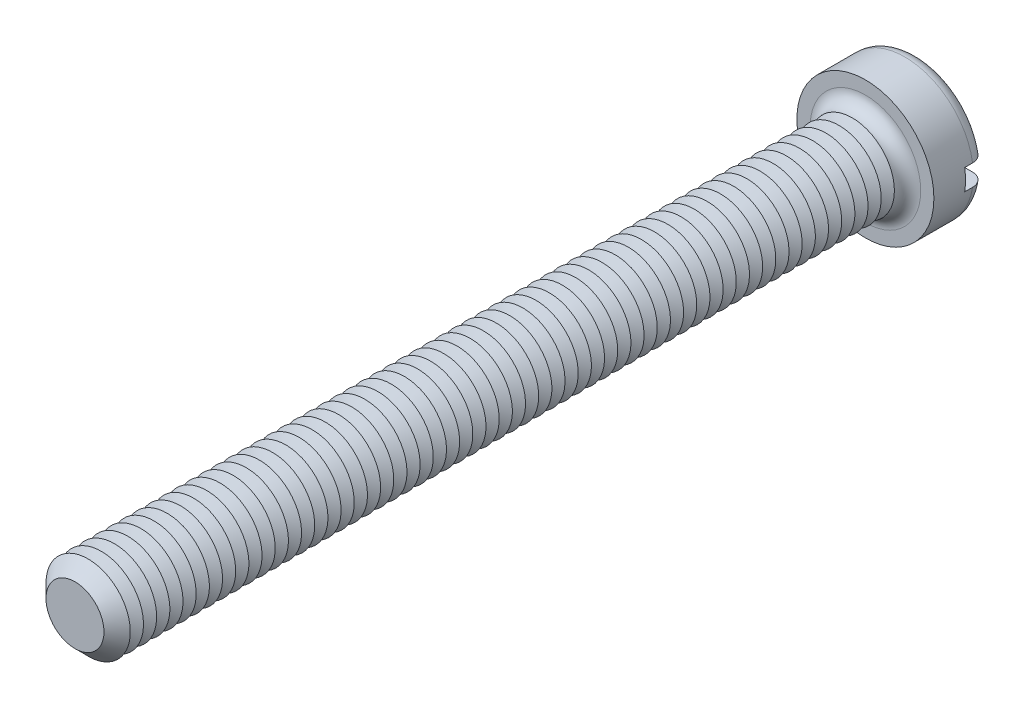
ISO-10303-21;
HEADER;
FILE_DESCRIPTION(('STEP AP214'),'2;1');
FILE_NAME('part.step','',(''),(''),'','','');
FILE_SCHEMA(('AUTOMOTIVE_DESIGN { 1 0 10303 214 1 1 1 1 }'));
ENDSEC;
DATA;
#1=APPLICATION_CONTEXT('core data for automotive mechanical design processes');
#2=APPLICATION_PROTOCOL_DEFINITION('international standard','automotive_design',2000,#1);
#3=PRODUCT_CONTEXT('',#1,'mechanical');
#4=PRODUCT('Part','Part','',(#3));
#5=PRODUCT_RELATED_PRODUCT_CATEGORY('part','',(#4));
#6=PRODUCT_DEFINITION_FORMATION('','',#4);
#7=PRODUCT_DEFINITION_CONTEXT('part definition',#1,'design');
#8=PRODUCT_DEFINITION('design','',#6,#7);
#9=PRODUCT_DEFINITION_SHAPE('','',#8);
#10=(LENGTH_UNIT() NAMED_UNIT(*) SI_UNIT(.MILLI.,.METRE.));
#11=(NAMED_UNIT(*) PLANE_ANGLE_UNIT() SI_UNIT($,.RADIAN.));
#12=(NAMED_UNIT(*) SI_UNIT($,.STERADIAN.) SOLID_ANGLE_UNIT());
#13=UNCERTAINTY_MEASURE_WITH_UNIT(LENGTH_MEASURE(1.E-05),#10,'distance_accuracy_value','');
#14=(GEOMETRIC_REPRESENTATION_CONTEXT(3) GLOBAL_UNCERTAINTY_ASSIGNED_CONTEXT((#13)) GLOBAL_UNIT_ASSIGNED_CONTEXT((#10,
#11,#12)) REPRESENTATION_CONTEXT('',''));
#15=CARTESIAN_POINT('',(0.,0.,0.));
#16=DIRECTION('',(0.,0.,1.));
#17=DIRECTION('',(1.,0.,0.));
#18=AXIS2_PLACEMENT_3D('',#15,#16,#17);
#19=CARTESIAN_POINT('',(0.,0.,-5.));
#20=DIRECTION('',(0.,0.,1.));
#21=DIRECTION('',(1.,0.,0.));
#22=AXIS2_PLACEMENT_3D('',#19,#20,#21);
#23=PLANE('',#22);
#24=CARTESIAN_POINT('',(0.,0.,-5.));
#25=DIRECTION('',(0.,0.,1.));
#26=DIRECTION('',(1.,0.,0.));
#27=AXIS2_PLACEMENT_3D('',#24,#25,#26);
#28=CIRCLE('',#27,5.25);
#29=CARTESIAN_POINT('',(-5.15388203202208,1.,-5.));
#30=VERTEX_POINT('',#29);
#31=CARTESIAN_POINT('',(5.15388203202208,1.,-5.));
#32=VERTEX_POINT('',#31);
#33=EDGE_CURVE('E116',#30,#32,#28,.F.);
#34=ORIENTED_EDGE('',*,*,#33,.T.);
#35=DIRECTION('',(1.,0.,0.));
#36=VECTOR('',#35,1.);
#37=CARTESIAN_POINT('',(-6.5,1.,-5.));
#38=LINE('',#37,#36);
#39=EDGE_CURVE('E111',#30,#32,#38,.T.);
#40=ORIENTED_EDGE('',*,*,#39,.F.);
#41=EDGE_LOOP('',(#34,#40));
#42=FACE_BOUND('',#41,.T.);
#43=ADVANCED_FACE('F39',(#42),#23,.F.);
#44=CARTESIAN_POINT('',(0.,0.,-3.75));
#45=DIRECTION('',(0.,0.,1.));
#46=DIRECTION('',(1.,0.,0.));
#47=AXIS2_PLACEMENT_3D('',#44,#45,#46);
#48=TOROIDAL_SURFACE('',#47,5.25,1.25);
#49=CARTESIAN_POINT('',(-6.04655789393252,1.,-4.63904490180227));
#50=CARTESIAN_POINT('',(-5.99546860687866,1.,-4.68885774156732));
#51=CARTESIAN_POINT('',(-5.94008472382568,1.,-4.73434760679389));
#52=CARTESIAN_POINT('',(-5.8223927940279,1.,-4.81538052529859));
#53=CARTESIAN_POINT('',(-5.7600753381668,1.,-4.85090982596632));
#54=CARTESIAN_POINT('',(-5.63044351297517,1.,-4.91100606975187));
#55=CARTESIAN_POINT('',(-5.56313479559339,1.,-4.93558519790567));
#56=CARTESIAN_POINT('',(-5.42539577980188,1.,-4.97322457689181));
#57=CARTESIAN_POINT('',(-5.35496625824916,1.,-4.98628767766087));
#58=CARTESIAN_POINT('',(-5.21212635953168,1.,-5.00070478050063));
#59=CARTESIAN_POINT('',(-5.13970265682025,1.,-5.00192674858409));
#60=CARTESIAN_POINT('',(-4.99565121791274,1.,-4.99234085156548));
#61=CARTESIAN_POINT('',(-4.92402357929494,1.,-4.98153152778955));
#62=CARTESIAN_POINT('',(-4.78274786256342,1.,-4.94801424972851));
#63=CARTESIAN_POINT('',(-4.71313137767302,1.,-4.92517296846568));
#64=CARTESIAN_POINT('',(-4.57871041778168,1.,-4.86813760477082));
#65=CARTESIAN_POINT('',(-4.51390612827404,1.,-4.83394308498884));
#66=CARTESIAN_POINT('',(-4.39095493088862,1.,-4.75508341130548));
#67=CARTESIAN_POINT('',(-4.33281197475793,1.,-4.7104120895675));
#68=CARTESIAN_POINT('',(-4.22499800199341,1.,-4.61179869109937));
#69=CARTESIAN_POINT('',(-4.17532640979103,1.,-4.55785724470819));
#70=CARTESIAN_POINT('',(-4.08677450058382,1.,-4.4431082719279));
#71=CARTESIAN_POINT('',(-4.0477350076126,1.,-4.38242369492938));
#72=CARTESIAN_POINT('',(-3.98074296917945,1.,-4.25521412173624));
#73=CARTESIAN_POINT('',(-3.95278836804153,1.,-4.18869021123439));
#74=CARTESIAN_POINT('',(-3.90959497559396,1.,-4.0537026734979));
#75=CARTESIAN_POINT('',(-3.89401985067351,1.,-3.98534663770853));
#76=CARTESIAN_POINT('',(-3.8748586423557,1.,-3.84697740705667));
#77=CARTESIAN_POINT('',(-3.87127067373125,1.,-3.7769644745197));
#78=CARTESIAN_POINT('',(-3.8761573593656,1.,-3.63892215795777));
#79=CARTESIAN_POINT('',(-3.88436651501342,1.,-3.57088319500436));
#80=CARTESIAN_POINT('',(-3.91207743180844,1.,-3.43714958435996));
#81=CARTESIAN_POINT('',(-3.93157911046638,1.,-3.37145491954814));
#82=CARTESIAN_POINT('',(-3.98125045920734,1.,-3.24411474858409));
#83=CARTESIAN_POINT('',(-4.01143761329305,1.,-3.18247607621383));
#84=CARTESIAN_POINT('',(-4.08150210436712,1.,-3.064981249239));
#85=CARTESIAN_POINT('',(-4.12138048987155,1.,-3.0091257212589));
#86=CARTESIAN_POINT('',(-4.2106718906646,1.,-2.90336353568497));
#87=CARTESIAN_POINT('',(-4.26028693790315,1.,-2.85362751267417));
#88=CARTESIAN_POINT('',(-4.36696587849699,1.,-2.76291710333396));
#89=CARTESIAN_POINT('',(-4.42403082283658,1.,-2.72194395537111));
#90=CARTESIAN_POINT('',(-4.54567957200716,1.,-2.64877280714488));
#91=CARTESIAN_POINT('',(-4.61042643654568,1.,-2.61684571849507));
#92=CARTESIAN_POINT('',(-4.74430563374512,1.,-2.56412359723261));
#93=CARTESIAN_POINT('',(-4.81343838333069,1.,-2.54332962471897));
#94=CARTESIAN_POINT('',(-4.95527237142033,1.,-2.51320471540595));
#95=CARTESIAN_POINT('',(-5.0280120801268,1.,-2.50405449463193));
#96=CARTESIAN_POINT('',(-5.17399775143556,1.,-2.49810126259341));
#97=CARTESIAN_POINT('',(-5.24724372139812,1.,-2.50129843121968));
#98=CARTESIAN_POINT('',(-5.3921014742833,1.,-2.52000776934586));
#99=CARTESIAN_POINT('',(-5.4637142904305,1.,-2.53551191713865));
#100=CARTESIAN_POINT('',(-5.60326680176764,1.,-2.57846304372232));
#101=CARTESIAN_POINT('',(-5.67120668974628,1.,-2.60590939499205));
#102=CARTESIAN_POINT('',(-5.80064060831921,1.,-2.67164926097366));
#103=CARTESIAN_POINT('',(-5.862199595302,1.,-2.7098148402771));
#104=CARTESIAN_POINT('',(-5.9779079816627,1.,-2.79608690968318));
#105=CARTESIAN_POINT('',(-6.03205795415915,1.,-2.84419263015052));
#106=CARTESIAN_POINT('',(-6.13055119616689,1.,-2.94820522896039));
#107=CARTESIAN_POINT('',(-6.17502887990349,1.,-3.00398483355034));
#108=CARTESIAN_POINT('',(-6.25384180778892,1.,-3.12230113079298));
#109=CARTESIAN_POINT('',(-6.28817779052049,1.,-3.18483733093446));
#110=CARTESIAN_POINT('',(-6.34527986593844,1.,-3.31401726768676));
#111=CARTESIAN_POINT('',(-6.36818984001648,1.,-3.38059742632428));
#112=CARTESIAN_POINT('',(-6.40240470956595,1.,-3.5166725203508));
#113=CARTESIAN_POINT('',(-6.41371067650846,1.,-3.58616718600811));
#114=CARTESIAN_POINT('',(-6.42433240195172,1.,-3.72550026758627));
#115=CARTESIAN_POINT('',(-6.4237441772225,1.,-3.79533138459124));
#116=CARTESIAN_POINT('',(-6.41082814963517,1.,-3.93391789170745));
#117=CARTESIAN_POINT('',(-6.39849757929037,1.,-4.00267302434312));
#118=CARTESIAN_POINT('',(-6.36249191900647,1.,-4.13704597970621));
#119=CARTESIAN_POINT('',(-6.33883072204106,1.,-4.20266753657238));
#120=CARTESIAN_POINT('',(-6.28088769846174,1.,-4.32897165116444));
#121=CARTESIAN_POINT('',(-6.24661890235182,1.,-4.38966015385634));
#122=CARTESIAN_POINT('',(-6.18404039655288,1.,-4.48163773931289));
#123=CARTESIAN_POINT('',(-6.15876600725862,1.,-4.51503333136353));
#124=CARTESIAN_POINT('',(-6.10500607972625,1.,-4.5791298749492));
#125=CARTESIAN_POINT('',(-6.07652056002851,1.,-4.60983084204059));
#126=CARTESIAN_POINT('',(-6.04655789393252,1.,-4.63904490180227));
#127=B_SPLINE_CURVE_WITH_KNOTS('',3,(#49,#50,#51,#52,#53,#54,#55,#56,#57,#58,#59,#60,#61,#62,
#63,#64,#65,#66,#67,#68,#69,#70,#71,#72,#73,#74,#75,#76,#77,#78,#79,#80,#81,#82,#83,#84,#85,#86,
#87,#88,#89,#90,#91,#92,#93,#94,#95,#96,#97,#98,#99,#100,#101,#102,#103,#104,#105,#106,#107,
#108,#109,#110,#111,#112,#113,#114,#115,#116,#117,#118,#119,#120,#121,#122,#123,#124,#125,#126),
.UNSPECIFIED.,.T.,.F.,(4,2,2,2,2,2,2,2,2,2,2,2,2,2,2,2,2,2,2,2,2,2,2,2,2,2,2,2,2,2,2,2,2,2,2,2,
2,2,4),(0.,0.213907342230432,0.428108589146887,0.642070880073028,0.855980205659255,
1.07227200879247,1.28859003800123,1.50735715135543,1.72613269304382,1.94503735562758,
2.16392713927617,2.37933295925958,2.59469881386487,2.80399176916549,3.01325180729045,
3.2178754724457,3.42249764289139,3.62745618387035,3.83243690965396,4.04223444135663,
4.25206160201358,4.46763253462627,4.68322399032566,4.90212226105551,5.12102372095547,
5.33978261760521,5.55853002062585,5.77477015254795,5.99099354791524,6.20398686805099,
6.41696467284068,6.62718821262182,6.83739233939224,7.0459002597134,7.25445733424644,
7.46275934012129,7.67080647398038,7.79625882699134,7.92171045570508),.UNSPECIFIED.);
#128=CARTESIAN_POINT('',(-6.42261628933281,1.,-3.74999999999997));
#129=VERTEX_POINT('',#128);
#130=EDGE_CURVE('E643',#129,#30,#127,.T.);
#131=ORIENTED_EDGE('',*,*,#130,.F.);
#132=CARTESIAN_POINT('',(0.,0.,-3.75));
#133=DIRECTION('',(0.,0.,1.));
#134=DIRECTION('',(1.,0.,0.));
#135=AXIS2_PLACEMENT_3D('',#132,#133,#134);
#136=CIRCLE('',#135,6.5);
#137=CARTESIAN_POINT('',(6.42261628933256,1.,-3.75));
#138=VERTEX_POINT('',#137);
#139=EDGE_CURVE('E125',#138,#129,#136,.T.);
#140=ORIENTED_EDGE('',*,*,#139,.F.);
#141=CARTESIAN_POINT('',(4.06944999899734,1.,-4.4133199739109));
#142=CARTESIAN_POINT('',(4.10828271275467,1.,-4.47354709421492));
#143=CARTESIAN_POINT('',(4.15233880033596,1.,-4.53047894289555));
#144=CARTESIAN_POINT('',(4.24946916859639,1.,-4.63614530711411));
#145=CARTESIAN_POINT('',(4.3025574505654,1.,-4.68486685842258));
#146=CARTESIAN_POINT('',(4.41603250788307,1.,-4.77271114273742));
#147=CARTESIAN_POINT('',(4.47640839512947,1.,-4.8118479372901));
#148=CARTESIAN_POINT('',(4.60277035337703,1.,-4.87959878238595));
#149=CARTESIAN_POINT('',(4.66875480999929,1.,-4.90821584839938));
#150=CARTESIAN_POINT('',(4.80558589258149,1.,-4.95456537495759));
#151=CARTESIAN_POINT('',(4.87649196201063,1.,-4.97212253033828));
#152=CARTESIAN_POINT('',(5.02024710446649,1.,-4.99514979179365));
#153=CARTESIAN_POINT('',(5.09309636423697,1.,-5.00061873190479));
#154=CARTESIAN_POINT('',(5.23902872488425,1.,-4.99926689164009));
#155=CARTESIAN_POINT('',(5.31211131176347,1.,-4.99238812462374));
#156=CARTESIAN_POINT('',(5.45605806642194,1.,-4.96635140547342));
#157=CARTESIAN_POINT('',(5.52692231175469,1.,-4.94719388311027));
#158=CARTESIAN_POINT('',(5.66376170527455,1.,-4.89728421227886));
#159=CARTESIAN_POINT('',(5.72977335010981,1.,-4.86663219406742));
#160=CARTESIAN_POINT('',(5.85560715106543,1.,-4.79452334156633));
#161=CARTESIAN_POINT('',(5.91542977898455,1.,-4.7530673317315));
#162=CARTESIAN_POINT('',(6.02626022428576,1.,-4.66116821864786));
#163=CARTESIAN_POINT('',(6.07738307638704,1.,-4.6108638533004));
#164=CARTESIAN_POINT('',(6.17030947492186,1.,-4.50227823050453));
#165=CARTESIAN_POINT('',(6.2121137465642,1.,-4.44399759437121));
#166=CARTESIAN_POINT('',(6.28460268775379,1.,-4.32200305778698));
#167=CARTESIAN_POINT('',(6.31543589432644,1.,-4.2583773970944));
#168=CARTESIAN_POINT('',(6.36586009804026,1.,-4.12681721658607));
#169=CARTESIAN_POINT('',(6.38545178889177,1.,-4.0588829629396));
#170=CARTESIAN_POINT('',(6.41265760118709,1.,-3.92136007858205));
#171=CARTESIAN_POINT('',(6.42038873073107,1.,-3.85179457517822));
#172=CARTESIAN_POINT('',(6.42401070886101,1.,-3.7123569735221));
#173=CARTESIAN_POINT('',(6.41990193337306,1.,-3.64248488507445));
#174=CARTESIAN_POINT('',(6.40000894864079,1.,-3.50470871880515));
#175=CARTESIAN_POINT('',(6.38427119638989,1.,-3.43679792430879));
#176=CARTESIAN_POINT('',(6.34164491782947,1.,-3.30457296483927));
#177=CARTESIAN_POINT('',(6.31475638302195,1.,-3.24025880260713));
#178=CARTESIAN_POINT('',(6.2505455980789,1.,-3.11686791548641));
#179=CARTESIAN_POINT('',(6.21319759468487,1.,-3.05780459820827));
#180=CARTESIAN_POINT('',(6.12919411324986,1.,-2.94671919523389));
#181=CARTESIAN_POINT('',(6.08253833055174,1.,-2.89469734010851));
#182=CARTESIAN_POINT('',(5.98083387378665,1.,-2.79868150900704));
#183=CARTESIAN_POINT('',(5.92571704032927,1.,-2.75475975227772));
#184=CARTESIAN_POINT('',(5.80897194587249,1.,-2.67665277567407));
#185=CARTESIAN_POINT('',(5.74734329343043,1.,-2.64246814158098));
#186=CARTESIAN_POINT('',(5.6184644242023,1.,-2.58431810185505));
#187=CARTESIAN_POINT('',(5.55115102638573,1.,-2.56049275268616));
#188=CARTESIAN_POINT('',(5.41351272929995,1.,-2.52429868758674));
#189=CARTESIAN_POINT('',(5.34318759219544,1.,-2.51193087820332));
#190=CARTESIAN_POINT('',(5.20041507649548,1.,-2.49882112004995));
#191=CARTESIAN_POINT('',(5.12795169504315,1.,-2.49825332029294));
#192=CARTESIAN_POINT('',(4.98393373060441,1.,-2.50914771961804));
#193=CARTESIAN_POINT('',(4.91237921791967,1.,-2.52061084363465));
#194=CARTESIAN_POINT('',(4.77137358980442,1.,-2.55542281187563));
#195=CARTESIAN_POINT('',(4.70195472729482,1.,-2.57890245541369));
#196=CARTESIAN_POINT('',(4.56803538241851,1.,-2.63717701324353));
#197=CARTESIAN_POINT('',(4.50353509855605,1.,-2.67197238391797));
#198=CARTESIAN_POINT('',(4.38131858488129,1.,-2.7519648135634));
#199=CARTESIAN_POINT('',(4.32360365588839,1.,-2.79716386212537));
#200=CARTESIAN_POINT('',(4.21673400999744,1.,-2.89675634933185));
#201=CARTESIAN_POINT('',(4.16757871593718,1.,-2.95114916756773));
#202=CARTESIAN_POINT('',(4.08014713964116,1.,-3.06667703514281));
#203=CARTESIAN_POINT('',(4.04170608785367,1.,-3.12768727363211));
#204=CARTESIAN_POINT('',(3.97596192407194,1.,-3.25543782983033));
#205=CARTESIAN_POINT('',(3.94865624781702,1.,-3.32217682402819));
#206=CARTESIAN_POINT('',(3.9067737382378,1.,-3.45745603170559));
#207=CARTESIAN_POINT('',(3.89185707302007,1.,-3.52589108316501));
#208=CARTESIAN_POINT('',(3.87400755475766,1.,-3.66432360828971));
#209=CARTESIAN_POINT('',(3.87107601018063,1.,-3.73432125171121));
#210=CARTESIAN_POINT('',(3.8772387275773,1.,-3.87228267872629));
#211=CARTESIAN_POINT('',(3.88607933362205,1.,-3.94025811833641));
#212=CARTESIAN_POINT('',(3.91502769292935,1.,-4.07370133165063));
#213=CARTESIAN_POINT('',(3.93512131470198,1.,-4.1391721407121));
#214=CARTESIAN_POINT('',(3.9752037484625,1.,-4.23926719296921));
#215=CARTESIAN_POINT('',(3.99171171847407,1.,-4.27532618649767));
#216=CARTESIAN_POINT('',(4.02809737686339,1.,-4.34569933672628));
#217=CARTESIAN_POINT('',(4.04797497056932,1.,-4.3800135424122));
#218=CARTESIAN_POINT('',(4.06944999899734,1.,-4.4133199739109));
#219=B_SPLINE_CURVE_WITH_KNOTS('',3,(#141,#142,#143,#144,#145,#146,#147,#148,#149,#150,#151,
#152,#153,#154,#155,#156,#157,#158,#159,#160,#161,#162,#163,#164,#165,#166,#167,#168,#169,#170,
#171,#172,#173,#174,#175,#176,#177,#178,#179,#180,#181,#182,#183,#184,#185,#186,#187,#188,#189,
#190,#191,#192,#193,#194,#195,#196,#197,#198,#199,#200,#201,#202,#203,#204,#205,#206,#207,#208,
#209,#210,#211,#212,#213,#214,#215,#216,#217,#218),.UNSPECIFIED.,.T.,.F.,(4,2,2,2,2,2,2,2,2,2,2,
2,2,2,2,2,2,2,2,2,2,2,2,2,2,2,2,2,2,2,2,2,2,2,2,2,2,2,4),(0.,0.214833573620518,
0.430003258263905,0.644855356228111,0.859645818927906,1.0777603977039,1.29589601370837,
1.51505870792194,1.73421373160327,1.95150241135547,2.16877451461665,2.38290237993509,
2.59701357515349,2.8081044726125,3.01918234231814,3.22816416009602,3.43713934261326,
3.64528416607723,3.85342914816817,4.06209119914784,4.27076008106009,4.48120788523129,
4.69166834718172,4.90489186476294,5.11813225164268,5.33451752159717,5.55091942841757,
5.76972860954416,5.98854661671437,6.20740650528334,6.42625163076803,6.64151774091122,
6.85673425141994,7.0658317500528,7.27495207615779,7.47963858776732,7.68406862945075,
7.80287790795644,7.92168384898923),.UNSPECIFIED.);
#220=EDGE_CURVE('E645',#32,#138,#219,.T.);
#221=ORIENTED_EDGE('',*,*,#220,.F.);
#222=ORIENTED_EDGE('',*,*,#33,.F.);
#223=EDGE_LOOP('',(#131,#140,#221,#222));
#224=FACE_BOUND('',#223,.T.);
#225=ADVANCED_FACE('F627',(#224),#48,.T.);
#226=CARTESIAN_POINT('',(0.,0.,-5.));
#227=DIRECTION('',(0.,0.,1.));
#228=DIRECTION('',(1.,0.,0.));
#229=AXIS2_PLACEMENT_3D('',#226,#227,#228);
#230=CYLINDRICAL_SURFACE('',#229,6.5);
#231=DIRECTION('',(0.,0.,1.));
#232=VECTOR('',#231,1.);
#233=CARTESIAN_POINT('',(6.42261628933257,1.,-5.));
#234=LINE('',#233,#232);
#235=CARTESIAN_POINT('',(6.42261628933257,1.,-3.));
#236=VERTEX_POINT('',#235);
#237=EDGE_CURVE('E659',#138,#236,#234,.T.);
#238=ORIENTED_EDGE('',*,*,#237,.F.);
#239=ORIENTED_EDGE('',*,*,#139,.T.);
#240=DIRECTION('',(0.,0.,1.));
#241=VECTOR('',#240,1.);
#242=CARTESIAN_POINT('',(-6.42261628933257,1.,-5.));
#243=LINE('',#242,#241);
#244=CARTESIAN_POINT('',(-6.42261628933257,1.,-3.));
#245=VERTEX_POINT('',#244);
#246=EDGE_CURVE('E63',#245,#129,#243,.F.);
#247=ORIENTED_EDGE('',*,*,#246,.F.);
#248=CARTESIAN_POINT('',(0.,0.,-3.));
#249=DIRECTION('',(0.,0.,-1.));
#250=DIRECTION('',(-1.,0.,0.));
#251=AXIS2_PLACEMENT_3D('',#248,#249,#250);
#252=CIRCLE('',#251,6.5);
#253=CARTESIAN_POINT('',(-6.42261628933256,-0.999999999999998,-3.));
#254=VERTEX_POINT('',#253);
#255=EDGE_CURVE('E43',#245,#254,#252,.F.);
#256=ORIENTED_EDGE('',*,*,#255,.T.);
#257=DIRECTION('',(0.,0.,1.));
#258=VECTOR('',#257,1.);
#259=CARTESIAN_POINT('',(-6.42261628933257,-0.999999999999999,-5.));
#260=LINE('',#259,#258);
#261=CARTESIAN_POINT('',(-6.42261628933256,-0.999999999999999,-3.75));
#262=VERTEX_POINT('',#261);
#263=EDGE_CURVE('E656',#262,#254,#260,.T.);
#264=ORIENTED_EDGE('',*,*,#263,.F.);
#265=CARTESIAN_POINT('',(6.42261628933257,-1.,-3.75));
#266=VERTEX_POINT('',#265);
#267=EDGE_CURVE('E127',#262,#266,#136,.T.);
#268=ORIENTED_EDGE('',*,*,#267,.T.);
#269=DIRECTION('',(0.,0.,1.));
#270=VECTOR('',#269,1.);
#271=CARTESIAN_POINT('',(6.42261628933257,-1.,-5.));
#272=LINE('',#271,#270);
#273=CARTESIAN_POINT('',(6.42261628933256,-1.,-3.));
#274=VERTEX_POINT('',#273);
#275=EDGE_CURVE('E55',#274,#266,#272,.F.);
#276=ORIENTED_EDGE('',*,*,#275,.F.);
#277=EDGE_CURVE('E11',#274,#236,#252,.F.);
#278=ORIENTED_EDGE('',*,*,#277,.T.);
#279=EDGE_LOOP('',(#238,#239,#247,#256,#264,#268,#276,#278));
#280=FACE_BOUND('',#279,.T.);
#281=CARTESIAN_POINT('',(0.,0.,0.));
#282=DIRECTION('',(0.,0.,1.));
#283=DIRECTION('',(1.,0.,0.));
#284=AXIS2_PLACEMENT_3D('',#281,#282,#283);
#285=CIRCLE('',#284,6.5);
#286=CARTESIAN_POINT('',(6.5,0.,0.));
#287=VERTEX_POINT('',#286);
#288=EDGE_CURVE('E662',#287,#287,#285,.T.);
#289=ORIENTED_EDGE('',*,*,#288,.F.);
#290=EDGE_LOOP('',(#289));
#291=FACE_BOUND('',#290,.T.);
#292=ADVANCED_FACE('F623',(#280,#291),#230,.T.);
#293=CARTESIAN_POINT('',(5.15388203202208,-1.,-5.));
#294=VERTEX_POINT('',#293);
#295=CARTESIAN_POINT('',(-5.15388203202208,-0.999999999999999,-5.));
#296=VERTEX_POINT('',#295);
#297=EDGE_CURVE('E109',#294,#296,#28,.F.);
#298=ORIENTED_EDGE('',*,*,#297,.T.);
#299=DIRECTION('',(-1.,0.,0.));
#300=VECTOR('',#299,1.);
#301=CARTESIAN_POINT('',(-6.5,-0.999999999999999,-5.));
#302=LINE('',#301,#300);
#303=EDGE_CURVE('E96',#294,#296,#302,.T.);
#304=ORIENTED_EDGE('',*,*,#303,.F.);
#305=EDGE_LOOP('',(#298,#304));
#306=FACE_BOUND('',#305,.T.);
#307=ADVANCED_FACE('F108',(#306),#23,.F.);
#308=CARTESIAN_POINT('',(0.,0.,0.));
#309=DIRECTION('',(0.,0.,1.));
#310=DIRECTION('',(1.,0.,0.));
#311=AXIS2_PLACEMENT_3D('',#308,#309,#310);
#312=PLANE('',#311);
#313=CARTESIAN_POINT('',(0.,0.,0.));
#314=DIRECTION('',(0.,0.,1.));
#315=DIRECTION('',(1.,0.,0.));
#316=AXIS2_PLACEMENT_3D('',#313,#314,#315);
#317=CIRCLE('',#316,5.25);
#318=CARTESIAN_POINT('',(5.25,0.,0.));
#319=VERTEX_POINT('',#318);
#320=EDGE_CURVE('E115',#319,#319,#317,.F.);
#321=ORIENTED_EDGE('',*,*,#320,.T.);
#322=EDGE_LOOP('',(#321));
#323=FACE_BOUND('',#322,.T.);
#324=ORIENTED_EDGE('',*,*,#288,.T.);
#325=EDGE_LOOP('',(#324));
#326=FACE_BOUND('',#325,.T.);
#327=ADVANCED_FACE('F622',(#323,#326),#312,.T.);
#328=CARTESIAN_POINT('',(-6.04655789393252,-0.999999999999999,-4.63904490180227));
#329=CARTESIAN_POINT('',(-6.0966604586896,-0.999999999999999,-4.59018532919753));
#330=CARTESIAN_POINT('',(-6.14270501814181,-0.999999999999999,-4.53709744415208));
#331=CARTESIAN_POINT('',(-6.22528519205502,-0.999999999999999,-4.42391631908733));
#332=CARTESIAN_POINT('',(-6.26181074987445,-0.999999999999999,-4.36381576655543));
#333=CARTESIAN_POINT('',(-6.32422109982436,-0.999999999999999,-4.23831836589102));
#334=CARTESIAN_POINT('',(-6.35010658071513,-0.999999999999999,-4.17292186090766));
#335=CARTESIAN_POINT('',(-6.39044668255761,-0.999999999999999,-4.03870925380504));
#336=CARTESIAN_POINT('',(-6.40490396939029,-0.999999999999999,-3.96989395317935));
#337=CARTESIAN_POINT('',(-6.42190814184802,-0.999999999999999,-3.83122595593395));
#338=CARTESIAN_POINT('',(-6.4245257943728,-0.999999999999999,-3.76138193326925));
#339=CARTESIAN_POINT('',(-6.41796432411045,-0.999999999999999,-3.62224935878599));
#340=CARTESIAN_POINT('',(-6.40878509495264,-0.999999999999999,-3.55296081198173));
#341=CARTESIAN_POINT('',(-6.37894560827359,-0.999999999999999,-3.41709241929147));
#342=CARTESIAN_POINT('',(-6.35831520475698,-0.999999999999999,-3.35050601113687));
#343=CARTESIAN_POINT('',(-6.30620980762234,-0.999999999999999,-3.22172312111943));
#344=CARTESIAN_POINT('',(-6.2747347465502,-0.999999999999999,-3.15952666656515));
#345=CARTESIAN_POINT('',(-6.20172710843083,-0.999999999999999,-3.04101762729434));
#346=CARTESIAN_POINT('',(-6.16015622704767,-0.999999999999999,-2.98472864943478));
#347=CARTESIAN_POINT('',(-6.06823774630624,-0.999999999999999,-2.87984578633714));
#348=CARTESIAN_POINT('',(-6.01788981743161,-0.999999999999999,-2.83125219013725));
#349=CARTESIAN_POINT('',(-5.90933830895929,-0.999999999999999,-2.74262118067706));
#350=CARTESIAN_POINT('',(-5.85106338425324,-0.999999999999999,-2.70267117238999));
#351=CARTESIAN_POINT('',(-5.72870702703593,-0.999999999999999,-2.63296796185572));
#352=CARTESIAN_POINT('',(-5.66462521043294,-0.999999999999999,-2.6032154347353));
#353=CARTESIAN_POINT('',(-5.53153273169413,-0.999999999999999,-2.55430842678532));
#354=CARTESIAN_POINT('',(-5.46246626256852,-0.999999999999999,-2.53530583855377));
#355=CARTESIAN_POINT('',(-5.32214267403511,-0.999999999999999,-2.5089831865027));
#356=CARTESIAN_POINT('',(-5.25088537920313,-0.999999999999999,-2.50166406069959));
#357=CARTESIAN_POINT('',(-5.10710123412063,-0.999999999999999,-2.49882202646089));
#358=CARTESIAN_POINT('',(-5.03457095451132,-0.999999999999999,-2.50347166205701));
#359=CARTESIAN_POINT('',(-4.8912897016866,-0.999999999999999,-2.52476029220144));
#360=CARTESIAN_POINT('',(-4.82053886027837,-0.999999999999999,-2.54140017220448));
#361=CARTESIAN_POINT('',(-4.68213257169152,-0.999999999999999,-2.58641614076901));
#362=CARTESIAN_POINT('',(-4.61451256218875,-0.999999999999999,-2.61490131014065));
#363=CARTESIAN_POINT('',(-4.48502801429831,-0.999999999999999,-2.68285095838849));
#364=CARTESIAN_POINT('',(-4.42316359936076,-0.999999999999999,-2.72231567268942));
#365=CARTESIAN_POINT('',(-4.30720694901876,-0.999999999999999,-2.81103994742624));
#366=CARTESIAN_POINT('',(-4.25309118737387,-0.999999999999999,-2.86026872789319));
#367=CARTESIAN_POINT('',(-4.15409408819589,-0.999999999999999,-2.9672764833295));
#368=CARTESIAN_POINT('',(-4.10921182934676,-0.999999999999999,-3.02505460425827));
#369=CARTESIAN_POINT('',(-4.03096584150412,-0.999999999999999,-3.14632492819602));
#370=CARTESIAN_POINT('',(-3.99739097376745,-0.999999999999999,-3.2096807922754));
#371=CARTESIAN_POINT('',(-3.94171839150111,-0.999999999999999,-3.34124912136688));
#372=CARTESIAN_POINT('',(-3.91961840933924,-0.999999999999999,-3.40946062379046));
#373=CARTESIAN_POINT('',(-3.88816636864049,-0.999999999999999,-3.54669256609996));
#374=CARTESIAN_POINT('',(-3.87846562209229,-0.999999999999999,-3.61563318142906));
#375=CARTESIAN_POINT('',(-3.87100568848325,-0.999999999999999,-3.75415397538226));
#376=CARTESIAN_POINT('',(-3.87324501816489,-0.999999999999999,-3.82373407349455));
#377=CARTESIAN_POINT('',(-3.88943589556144,-0.999999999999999,-3.96027701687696));
#378=CARTESIAN_POINT('',(-3.90318225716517,-0.999999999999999,-4.0272643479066));
#379=CARTESIAN_POINT('',(-3.94163954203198,-0.999999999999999,-4.1580093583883));
#380=CARTESIAN_POINT('',(-3.96635075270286,-0.999999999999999,-4.22176695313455));
#381=CARTESIAN_POINT('',(-4.026160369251,-0.999999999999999,-4.34483320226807));
#382=CARTESIAN_POINT('',(-4.06134035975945,-0.999999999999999,-4.40410214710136));
#383=CARTESIAN_POINT('',(-4.14090865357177,-0.999999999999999,-4.51609417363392));
#384=CARTESIAN_POINT('',(-4.18529811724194,-0.999999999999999,-4.56881642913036));
#385=CARTESIAN_POINT('',(-4.2832649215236,-0.999999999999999,-4.66770177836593));
#386=CARTESIAN_POINT('',(-4.33705327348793,-0.999999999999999,-4.71365579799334));
#387=CARTESIAN_POINT('',(-4.45141776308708,-0.999999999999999,-4.79615385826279));
#388=CARTESIAN_POINT('',(-4.51199483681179,-0.999999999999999,-4.83269659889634));
#389=CARTESIAN_POINT('',(-4.63989216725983,-0.999999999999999,-4.89626962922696));
#390=CARTESIAN_POINT('',(-4.70734508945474,-0.999999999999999,-4.92303326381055));
#391=CARTESIAN_POINT('',(-4.84575497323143,-0.999999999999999,-4.96500199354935));
#392=CARTESIAN_POINT('',(-4.91671207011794,-0.999999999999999,-4.98020664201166));
#393=CARTESIAN_POINT('',(-5.06097761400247,-0.999999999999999,-4.9987306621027));
#394=CARTESIAN_POINT('',(-5.13430353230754,-0.999999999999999,-5.00191441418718));
#395=CARTESIAN_POINT('',(-5.28046546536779,-0.999999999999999,-4.99587686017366));
#396=CARTESIAN_POINT('',(-5.35330135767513,-0.999999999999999,-4.98665256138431));
#397=CARTESIAN_POINT('',(-5.49610354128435,-0.999999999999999,-4.95604184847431));
#398=CARTESIAN_POINT('',(-5.56607890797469,-0.999999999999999,-4.93469772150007));
#399=CARTESIAN_POINT('',(-5.70131538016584,-0.999999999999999,-4.88041956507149));
#400=CARTESIAN_POINT('',(-5.76658233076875,-0.999999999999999,-4.84750021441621));
#401=CARTESIAN_POINT('',(-5.86782577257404,-0.999999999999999,-4.78498748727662));
#402=CARTESIAN_POINT('',(-5.90579749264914,-0.999999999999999,-4.75856648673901));
#403=CARTESIAN_POINT('',(-5.97862186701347,-0.999999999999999,-4.70172646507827));
#404=CARTESIAN_POINT('',(-6.0134745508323,-0.999999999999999,-4.6713074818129));
#405=CARTESIAN_POINT('',(-6.04655789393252,-0.999999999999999,-4.63904490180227));
#406=B_SPLINE_CURVE_WITH_KNOTS('',3,(#328,#329,#330,#331,#332,#333,#334,#335,#336,#337,#338,
#339,#340,#341,#342,#343,#344,#345,#346,#347,#348,#349,#350,#351,#352,#353,#354,#355,#356,#357,
#358,#359,#360,#361,#362,#363,#364,#365,#366,#367,#368,#369,#370,#371,#372,#373,#374,#375,#376,
#377,#378,#379,#380,#381,#382,#383,#384,#385,#386,#387,#388,#389,#390,#391,#392,#393,#394,#395,
#396,#397,#398,#399,#400,#401,#402,#403,#404,#405),.UNSPECIFIED.,.T.,.F.,(4,2,2,2,2,2,2,2,2,2,2,
2,2,2,2,2,2,2,2,2,2,2,2,2,2,2,2,2,2,2,2,2,2,2,2,2,2,2,4),(0.,0.209780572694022,
0.419781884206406,0.629769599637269,0.839708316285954,1.04839053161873,1.2570746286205,
1.46521720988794,1.67336108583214,1.88230736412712,2.09126148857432,2.30223890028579,
2.51323027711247,2.72713284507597,2.94105258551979,3.15807345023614,3.37511034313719,
3.59419176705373,3.81327788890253,4.03168404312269,4.25006839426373,4.46411376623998,
4.67811682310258,4.88595885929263,5.09377507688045,5.29796268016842,5.50215563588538,
5.70798353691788,5.91383738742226,6.12510741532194,6.33640661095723,6.55309998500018,
6.76980173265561,6.98894112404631,7.20813337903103,7.42656551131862,7.64472163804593,
7.78324365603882,7.92176436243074),.UNSPECIFIED.);
#407=EDGE_CURVE('E103',#296,#262,#406,.T.);
#408=ORIENTED_EDGE('',*,*,#407,.F.);
#409=ORIENTED_EDGE('',*,*,#297,.F.);
#410=CARTESIAN_POINT('',(4.06944999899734,-1.,-4.4133199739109));
#411=CARTESIAN_POINT('',(4.03213207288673,-1.,-4.3554312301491));
#412=CARTESIAN_POINT('',(3.9995849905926,-1.,-4.29441722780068));
#413=CARTESIAN_POINT('',(3.94511822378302,-1.,-4.16776604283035));
#414=CARTESIAN_POINT('',(3.92320762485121,-1.,-4.10212496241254));
#415=CARTESIAN_POINT('',(3.89078811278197,-1.,-3.96804412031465));
#416=CARTESIAN_POINT('',(3.88028409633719,-1.,-3.89960316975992));
#417=CARTESIAN_POINT('',(3.87107895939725,-1.,-3.76194650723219));
#418=CARTESIAN_POINT('',(3.87237511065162,-1.,-3.69273097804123));
#419=CARTESIAN_POINT('',(3.88662927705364,-1.,-3.55634460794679));
#420=CARTESIAN_POINT('',(3.89944923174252,-1.,-3.48915926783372));
#421=CARTESIAN_POINT('',(3.93611188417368,-1.,-3.35786953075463));
#422=CARTESIAN_POINT('',(3.95995518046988,-1.,-3.29376530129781));
#423=CARTESIAN_POINT('',(4.0180748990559,-1.,-3.16993562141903));
#424=CARTESIAN_POINT('',(4.05242297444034,-1.,-3.11024385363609));
#425=CARTESIAN_POINT('',(4.13041121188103,-1.,-2.9972793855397));
#426=CARTESIAN_POINT('',(4.17405248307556,-1.,-2.94400745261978));
#427=CARTESIAN_POINT('',(4.27058636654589,-1.,-2.8439150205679));
#428=CARTESIAN_POINT('',(4.32368948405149,-1.,-2.79729757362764));
#429=CARTESIAN_POINT('',(4.43679856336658,-1.,-2.71336600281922));
#430=CARTESIAN_POINT('',(4.49680546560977,-1.,-2.67605314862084));
#431=CARTESIAN_POINT('',(4.62370121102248,-1.,-2.61081752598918));
#432=CARTESIAN_POINT('',(4.69072799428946,-1.,-2.58316284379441));
#433=CARTESIAN_POINT('',(4.82843981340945,-1.,-2.5393441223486));
#434=CARTESIAN_POINT('',(4.899125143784,-1.,-2.52318100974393));
#435=CARTESIAN_POINT('',(5.04306377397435,-1.,-2.50267755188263));
#436=CARTESIAN_POINT('',(5.11633773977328,-1.,-2.49848181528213));
#437=CARTESIAN_POINT('',(5.26254809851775,-1.,-2.50249357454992));
#438=CARTESIAN_POINT('',(5.33548449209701,-1.,-2.51070104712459));
#439=CARTESIAN_POINT('',(5.4786703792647,-1.,-2.53930888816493));
#440=CARTESIAN_POINT('',(5.54892819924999,-1.,-2.5596675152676));
#441=CARTESIAN_POINT('',(5.68495799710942,-1.,-2.61204238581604));
#442=CARTESIAN_POINT('',(5.75073024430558,-1.,-2.64405792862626));
#443=CARTESIAN_POINT('',(5.8750178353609,-1.,-2.7184150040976));
#444=CARTESIAN_POINT('',(5.93361487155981,-1.,-2.76061995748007));
#445=CARTESIAN_POINT('',(6.04275377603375,-1.,-2.85440601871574));
#446=CARTESIAN_POINT('',(6.09329629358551,-1.,-2.90598637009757));
#447=CARTESIAN_POINT('',(6.18409572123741,-1.,-3.01622977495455));
#448=CARTESIAN_POINT('',(6.2244945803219,-1.,-3.07477592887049));
#449=CARTESIAN_POINT('',(6.29474798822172,-1.,-3.19788594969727));
#450=CARTESIAN_POINT('',(6.3246032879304,-1.,-3.26244938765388));
#451=CARTESIAN_POINT('',(6.37256001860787,-1.,-3.39491634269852));
#452=CARTESIAN_POINT('',(6.39079949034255,-1.,-3.46276990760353));
#453=CARTESIAN_POINT('',(6.41554133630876,-1.,-3.60058363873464));
#454=CARTESIAN_POINT('',(6.42204424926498,-1.,-3.67054370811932));
#455=CARTESIAN_POINT('',(6.42311237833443,-1.,-3.81007982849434));
#456=CARTESIAN_POINT('',(6.41775799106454,-1.,-3.879655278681));
#457=CARTESIAN_POINT('',(6.39543799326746,-1.,-4.01691664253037));
#458=CARTESIAN_POINT('',(6.3784725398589,-1.,-4.08460258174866));
#459=CARTESIAN_POINT('',(6.33344768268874,-1.,-4.21614537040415));
#460=CARTESIAN_POINT('',(6.30539273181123,-1.,-4.28000374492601));
#461=CARTESIAN_POINT('',(6.23902076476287,-1.,-4.40214140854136));
#462=CARTESIAN_POINT('',(6.20070356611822,-1.,-4.46042059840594));
#463=CARTESIAN_POINT('',(6.11467174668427,-1.,-4.5701315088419));
#464=CARTESIAN_POINT('',(6.06690270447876,-1.,-4.62152053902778));
#465=CARTESIAN_POINT('',(5.96350111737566,-1.,-4.715657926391));
#466=CARTESIAN_POINT('',(5.90786817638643,-1.,-4.75840584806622));
#467=CARTESIAN_POINT('',(5.78965380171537,-1.,-4.8345781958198));
#468=CARTESIAN_POINT('',(5.72700078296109,-1.,-4.86789149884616));
#469=CARTESIAN_POINT('',(5.59704977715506,-1.,-4.92369754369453));
#470=CARTESIAN_POINT('',(5.52975144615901,-1.,-4.94618948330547));
#471=CARTESIAN_POINT('',(5.39137621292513,-1.,-4.98006173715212));
#472=CARTESIAN_POINT('',(5.32025859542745,-1.,-4.99127571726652));
#473=CARTESIAN_POINT('',(5.17715081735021,-1.,-5.00177798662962));
#474=CARTESIAN_POINT('',(5.10516061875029,-1.,-5.00106575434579));
#475=CARTESIAN_POINT('',(4.96131924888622,-1.,-4.98769775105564));
#476=CARTESIAN_POINT('',(4.88948297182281,-1.,-4.97488146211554));
#477=CARTESIAN_POINT('',(4.74893184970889,-1.,-4.93744335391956));
#478=CARTESIAN_POINT('',(4.68021795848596,-1.,-4.91281795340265));
#479=CARTESIAN_POINT('',(4.54744428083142,-1.,-4.8522329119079));
#480=CARTESIAN_POINT('',(4.48341761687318,-1.,-4.81620070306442));
#481=CARTESIAN_POINT('',(4.36244497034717,-1.,-4.73383277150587));
#482=CARTESIAN_POINT('',(4.30549069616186,-1.,-4.68750929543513));
#483=CARTESIAN_POINT('',(4.21823158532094,-1.,-4.60311228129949));
#484=CARTESIAN_POINT('',(4.18544074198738,-1.,-4.56757118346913));
#485=CARTESIAN_POINT('',(4.12413461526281,-1.,-4.49297229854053));
#486=CARTESIAN_POINT('',(4.09561926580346,-1.,-4.45391456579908));
#487=CARTESIAN_POINT('',(4.06944999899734,-1.,-4.4133199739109));
#488=B_SPLINE_CURVE_WITH_KNOTS('',3,(#410,#411,#412,#413,#414,#415,#416,#417,#418,#419,#420,
#421,#422,#423,#424,#425,#426,#427,#428,#429,#430,#431,#432,#433,#434,#435,#436,#437,#438,#439,
#440,#441,#442,#443,#444,#445,#446,#447,#448,#449,#450,#451,#452,#453,#454,#455,#456,#457,#458,
#459,#460,#461,#462,#463,#464,#465,#466,#467,#468,#469,#470,#471,#472,#473,#474,#475,#476,#477,
#478,#479,#480,#481,#482,#483,#484,#485,#486,#487),.UNSPECIFIED.,.T.,.F.,(4,2,2,2,2,2,2,2,2,2,2,
2,2,2,2,2,2,2,2,2,2,2,2,2,2,2,2,2,2,2,2,2,2,2,2,2,2,2,4),(0.,0.206453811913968,0.4130836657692,
0.619802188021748,0.826472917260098,1.03070015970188,1.23493849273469,1.44060223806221,
1.64629054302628,1.85731119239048,2.06836062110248,2.28487349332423,2.5014038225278,
2.72053974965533,2.9396752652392,3.15806230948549,3.37643622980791,3.59203140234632,
3.80760918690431,4.01997696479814,4.23232961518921,4.44210913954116,4.65187903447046,
4.86023097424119,5.06858009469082,5.27684563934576,5.48511488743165,5.69462015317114,
5.90413597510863,6.11602561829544,6.32793096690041,6.54291770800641,6.75791385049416,
6.97580180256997,7.19375587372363,7.41312537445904,7.63223520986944,7.77701357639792,
7.92178970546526),.UNSPECIFIED.);
#489=EDGE_CURVE('E92',#266,#294,#488,.T.);
#490=ORIENTED_EDGE('',*,*,#489,.F.);
#491=ORIENTED_EDGE('',*,*,#267,.F.);
#492=EDGE_LOOP('',(#408,#409,#490,#491));
#493=FACE_BOUND('',#492,.T.);
#494=ADVANCED_FACE('F113',(#493),#48,.T.);
#495=CARTESIAN_POINT('',(0.,0.,1.25));
#496=DIRECTION('',(0.,0.,1.));
#497=DIRECTION('',(1.,0.,0.));
#498=AXIS2_PLACEMENT_3D('',#495,#496,#497);
#499=TOROIDAL_SURFACE('',#498,5.25,1.25);
#500=ORIENTED_EDGE('',*,*,#320,.F.);
#501=EDGE_LOOP('',(#500));
#502=FACE_BOUND('',#501,.T.);
#503=CARTESIAN_POINT('',(0.,0.,1.25));
#504=DIRECTION('',(0.,0.,-1.));
#505=DIRECTION('',(-1.,0.,0.));
#506=AXIS2_PLACEMENT_3D('',#503,#504,#505);
#507=CIRCLE('',#506,4.);
#508=CARTESIAN_POINT('',(-4.,0.,1.25));
#509=VERTEX_POINT('',#508);
#510=EDGE_CURVE('E667',#509,#509,#507,.T.);
#511=ORIENTED_EDGE('',*,*,#510,.T.);
#512=EDGE_LOOP('',(#511));
#513=FACE_BOUND('',#512,.T.);
#514=ADVANCED_FACE('F615',(#502,#513),#499,.F.);
#515=CARTESIAN_POINT('',(0.,0.,1.875));
#516=DIRECTION('',(0.,0.,-1.));
#517=DIRECTION('',(-1.,0.,0.));
#518=AXIS2_PLACEMENT_3D('',#515,#516,#517);
#519=CONICAL_SURFACE('',#518,2.91746824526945,1.0471975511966);
#520=ORIENTED_EDGE('',*,*,#510,.F.);
#521=EDGE_LOOP('',(#520));
#522=FACE_BOUND('',#521,.T.);
#523=CARTESIAN_POINT('',(0.,0.,1.875));
#524=DIRECTION('',(0.,0.,-1.));
#525=DIRECTION('',(-1.,0.,0.));
#526=AXIS2_PLACEMENT_3D('',#523,#524,#525);
#527=CIRCLE('',#526,2.91746824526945);
#528=CARTESIAN_POINT('',(-2.91746824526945,0.,1.875));
#529=VERTEX_POINT('',#528);
#530=EDGE_CURVE('E673',#529,#529,#527,.T.);
#531=ORIENTED_EDGE('',*,*,#530,.T.);
#532=EDGE_LOOP('',(#531));
#533=FACE_BOUND('',#532,.T.);
#534=ADVANCED_FACE('F611',(#522,#533),#519,.T.);
#535=CARTESIAN_POINT('',(0.,0.,2.5));
#536=DIRECTION('',(0.,0.,1.));
#537=DIRECTION('',(1.,0.,0.));
#538=AXIS2_PLACEMENT_3D('',#535,#536,#537);
#539=CONICAL_SURFACE('',#538,4.,1.0471975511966);
#540=ORIENTED_EDGE('',*,*,#530,.F.);
#541=EDGE_LOOP('',(#540));
#542=FACE_BOUND('',#541,.T.);
#543=CARTESIAN_POINT('',(0.,0.,2.5));
#544=DIRECTION('',(0.,0.,-1.));
#545=DIRECTION('',(-1.,0.,0.));
#546=AXIS2_PLACEMENT_3D('',#543,#544,#545);
#547=CIRCLE('',#546,4.);
#548=CARTESIAN_POINT('',(-4.,0.,2.5));
#549=VERTEX_POINT('',#548);
#550=EDGE_CURVE('E679',#549,#549,#547,.T.);
#551=ORIENTED_EDGE('',*,*,#550,.T.);
#552=EDGE_LOOP('',(#551));
#553=FACE_BOUND('',#552,.T.);
#554=ADVANCED_FACE('F607',(#542,#553),#539,.T.);
#555=CARTESIAN_POINT('',(0.,0.,3.125));
#556=DIRECTION('',(0.,0.,-1.));
#557=DIRECTION('',(-1.,0.,0.));
#558=AXIS2_PLACEMENT_3D('',#555,#556,#557);
#559=CONICAL_SURFACE('',#558,2.91746824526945,1.0471975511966);
#560=ORIENTED_EDGE('',*,*,#550,.F.);
#561=EDGE_LOOP('',(#560));
#562=FACE_BOUND('',#561,.T.);
#563=CARTESIAN_POINT('',(0.,0.,3.125));
#564=DIRECTION('',(0.,0.,-1.));
#565=DIRECTION('',(-1.,0.,0.));
#566=AXIS2_PLACEMENT_3D('',#563,#564,#565);
#567=CIRCLE('',#566,2.91746824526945);
#568=CARTESIAN_POINT('',(-2.91746824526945,0.,3.125));
#569=VERTEX_POINT('',#568);
#570=EDGE_CURVE('E683',#569,#569,#567,.T.);
#571=ORIENTED_EDGE('',*,*,#570,.T.);
#572=EDGE_LOOP('',(#571));
#573=FACE_BOUND('',#572,.T.);
#574=ADVANCED_FACE('F603',(#562,#573),#559,.T.);
#575=CARTESIAN_POINT('',(0.,0.,3.75));
#576=DIRECTION('',(0.,0.,1.));
#577=DIRECTION('',(1.,0.,0.));
#578=AXIS2_PLACEMENT_3D('',#575,#576,#577);
#579=CONICAL_SURFACE('',#578,4.,1.0471975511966);
#580=ORIENTED_EDGE('',*,*,#570,.F.);
#581=EDGE_LOOP('',(#580));
#582=FACE_BOUND('',#581,.T.);
#583=CARTESIAN_POINT('',(0.,0.,3.75));
#584=DIRECTION('',(0.,0.,-1.));
#585=DIRECTION('',(-1.,0.,0.));
#586=AXIS2_PLACEMENT_3D('',#583,#584,#585);
#587=CIRCLE('',#586,4.);
#588=CARTESIAN_POINT('',(-4.,0.,3.75));
#589=VERTEX_POINT('',#588);
#590=EDGE_CURVE('E687',#589,#589,#587,.T.);
#591=ORIENTED_EDGE('',*,*,#590,.T.);
#592=EDGE_LOOP('',(#591));
#593=FACE_BOUND('',#592,.T.);
#594=ADVANCED_FACE('F599',(#582,#593),#579,.T.);
#595=CARTESIAN_POINT('',(0.,0.,4.375));
#596=DIRECTION('',(0.,0.,-1.));
#597=DIRECTION('',(-1.,0.,0.));
#598=AXIS2_PLACEMENT_3D('',#595,#596,#597);
#599=CONICAL_SURFACE('',#598,2.91746824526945,1.0471975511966);
#600=ORIENTED_EDGE('',*,*,#590,.F.);
#601=EDGE_LOOP('',(#600));
#602=FACE_BOUND('',#601,.T.);
#603=CARTESIAN_POINT('',(0.,0.,4.375));
#604=DIRECTION('',(0.,0.,-1.));
#605=DIRECTION('',(-1.,0.,0.));
#606=AXIS2_PLACEMENT_3D('',#603,#604,#605);
#607=CIRCLE('',#606,2.91746824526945);
#608=CARTESIAN_POINT('',(-2.91746824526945,0.,4.375));
#609=VERTEX_POINT('',#608);
#610=EDGE_CURVE('E691',#609,#609,#607,.T.);
#611=ORIENTED_EDGE('',*,*,#610,.T.);
#612=EDGE_LOOP('',(#611));
#613=FACE_BOUND('',#612,.T.);
#614=ADVANCED_FACE('F595',(#602,#613),#599,.T.);
#615=CARTESIAN_POINT('',(0.,0.,5.));
#616=DIRECTION('',(0.,0.,1.));
#617=DIRECTION('',(1.,0.,0.));
#618=AXIS2_PLACEMENT_3D('',#615,#616,#617);
#619=CONICAL_SURFACE('',#618,4.,1.0471975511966);
#620=ORIENTED_EDGE('',*,*,#610,.F.);
#621=EDGE_LOOP('',(#620));
#622=FACE_BOUND('',#621,.T.);
#623=CARTESIAN_POINT('',(0.,0.,5.));
#624=DIRECTION('',(0.,0.,-1.));
#625=DIRECTION('',(-1.,0.,0.));
#626=AXIS2_PLACEMENT_3D('',#623,#624,#625);
#627=CIRCLE('',#626,4.);
#628=CARTESIAN_POINT('',(-4.,0.,5.));
#629=VERTEX_POINT('',#628);
#630=EDGE_CURVE('E695',#629,#629,#627,.T.);
#631=ORIENTED_EDGE('',*,*,#630,.T.);
#632=EDGE_LOOP('',(#631));
#633=FACE_BOUND('',#632,.T.);
#634=ADVANCED_FACE('F591',(#622,#633),#619,.T.);
#635=CARTESIAN_POINT('',(0.,0.,5.625));
#636=DIRECTION('',(0.,0.,-1.));
#637=DIRECTION('',(-1.,0.,0.));
#638=AXIS2_PLACEMENT_3D('',#635,#636,#637);
#639=CONICAL_SURFACE('',#638,2.91746824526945,1.0471975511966);
#640=ORIENTED_EDGE('',*,*,#630,.F.);
#641=EDGE_LOOP('',(#640));
#642=FACE_BOUND('',#641,.T.);
#643=CARTESIAN_POINT('',(0.,0.,5.625));
#644=DIRECTION('',(0.,0.,-1.));
#645=DIRECTION('',(-1.,0.,0.));
#646=AXIS2_PLACEMENT_3D('',#643,#644,#645);
#647=CIRCLE('',#646,2.91746824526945);
#648=CARTESIAN_POINT('',(-2.91746824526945,0.,5.625));
#649=VERTEX_POINT('',#648);
#650=EDGE_CURVE('E699',#649,#649,#647,.T.);
#651=ORIENTED_EDGE('',*,*,#650,.T.);
#652=EDGE_LOOP('',(#651));
#653=FACE_BOUND('',#652,.T.);
#654=ADVANCED_FACE('F587',(#642,#653),#639,.T.);
#655=CARTESIAN_POINT('',(0.,0.,6.25));
#656=DIRECTION('',(0.,0.,1.));
#657=DIRECTION('',(1.,0.,0.));
#658=AXIS2_PLACEMENT_3D('',#655,#656,#657);
#659=CONICAL_SURFACE('',#658,4.,1.0471975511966);
#660=ORIENTED_EDGE('',*,*,#650,.F.);
#661=EDGE_LOOP('',(#660));
#662=FACE_BOUND('',#661,.T.);
#663=CARTESIAN_POINT('',(0.,0.,6.25));
#664=DIRECTION('',(0.,0.,-1.));
#665=DIRECTION('',(-1.,0.,0.));
#666=AXIS2_PLACEMENT_3D('',#663,#664,#665);
#667=CIRCLE('',#666,4.);
#668=CARTESIAN_POINT('',(-4.,0.,6.25));
#669=VERTEX_POINT('',#668);
#670=EDGE_CURVE('E703',#669,#669,#667,.T.);
#671=ORIENTED_EDGE('',*,*,#670,.T.);
#672=EDGE_LOOP('',(#671));
#673=FACE_BOUND('',#672,.T.);
#674=ADVANCED_FACE('F583',(#662,#673),#659,.T.);
#675=CARTESIAN_POINT('',(0.,0.,6.875));
#676=DIRECTION('',(0.,0.,-1.));
#677=DIRECTION('',(-1.,0.,0.));
#678=AXIS2_PLACEMENT_3D('',#675,#676,#677);
#679=CONICAL_SURFACE('',#678,2.91746824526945,1.0471975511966);
#680=ORIENTED_EDGE('',*,*,#670,.F.);
#681=EDGE_LOOP('',(#680));
#682=FACE_BOUND('',#681,.T.);
#683=CARTESIAN_POINT('',(0.,0.,6.875));
#684=DIRECTION('',(0.,0.,-1.));
#685=DIRECTION('',(-1.,0.,0.));
#686=AXIS2_PLACEMENT_3D('',#683,#684,#685);
#687=CIRCLE('',#686,2.91746824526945);
#688=CARTESIAN_POINT('',(-2.91746824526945,0.,6.875));
#689=VERTEX_POINT('',#688);
#690=EDGE_CURVE('E707',#689,#689,#687,.T.);
#691=ORIENTED_EDGE('',*,*,#690,.T.);
#692=EDGE_LOOP('',(#691));
#693=FACE_BOUND('',#692,.T.);
#694=ADVANCED_FACE('F579',(#682,#693),#679,.T.);
#695=CARTESIAN_POINT('',(0.,0.,7.5));
#696=DIRECTION('',(0.,0.,1.));
#697=DIRECTION('',(1.,0.,0.));
#698=AXIS2_PLACEMENT_3D('',#695,#696,#697);
#699=CONICAL_SURFACE('',#698,4.,1.0471975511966);
#700=ORIENTED_EDGE('',*,*,#690,.F.);
#701=EDGE_LOOP('',(#700));
#702=FACE_BOUND('',#701,.T.);
#703=CARTESIAN_POINT('',(0.,0.,7.5));
#704=DIRECTION('',(0.,0.,-1.));
#705=DIRECTION('',(-1.,0.,0.));
#706=AXIS2_PLACEMENT_3D('',#703,#704,#705);
#707=CIRCLE('',#706,4.);
#708=CARTESIAN_POINT('',(-4.,0.,7.5));
#709=VERTEX_POINT('',#708);
#710=EDGE_CURVE('E711',#709,#709,#707,.T.);
#711=ORIENTED_EDGE('',*,*,#710,.T.);
#712=EDGE_LOOP('',(#711));
#713=FACE_BOUND('',#712,.T.);
#714=ADVANCED_FACE('F575',(#702,#713),#699,.T.);
#715=CARTESIAN_POINT('',(0.,0.,8.125));
#716=DIRECTION('',(0.,0.,-1.));
#717=DIRECTION('',(-1.,0.,0.));
#718=AXIS2_PLACEMENT_3D('',#715,#716,#717);
#719=CONICAL_SURFACE('',#718,2.91746824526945,1.0471975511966);
#720=ORIENTED_EDGE('',*,*,#710,.F.);
#721=EDGE_LOOP('',(#720));
#722=FACE_BOUND('',#721,.T.);
#723=CARTESIAN_POINT('',(0.,0.,8.125));
#724=DIRECTION('',(0.,0.,-1.));
#725=DIRECTION('',(-1.,0.,0.));
#726=AXIS2_PLACEMENT_3D('',#723,#724,#725);
#727=CIRCLE('',#726,2.91746824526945);
#728=CARTESIAN_POINT('',(-2.91746824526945,0.,8.125));
#729=VERTEX_POINT('',#728);
#730=EDGE_CURVE('E715',#729,#729,#727,.T.);
#731=ORIENTED_EDGE('',*,*,#730,.T.);
#732=EDGE_LOOP('',(#731));
#733=FACE_BOUND('',#732,.T.);
#734=ADVANCED_FACE('F571',(#722,#733),#719,.T.);
#735=CARTESIAN_POINT('',(0.,0.,8.75));
#736=DIRECTION('',(0.,0.,1.));
#737=DIRECTION('',(1.,0.,0.));
#738=AXIS2_PLACEMENT_3D('',#735,#736,#737);
#739=CONICAL_SURFACE('',#738,4.,1.0471975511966);
#740=ORIENTED_EDGE('',*,*,#730,.F.);
#741=EDGE_LOOP('',(#740));
#742=FACE_BOUND('',#741,.T.);
#743=CARTESIAN_POINT('',(0.,0.,8.75));
#744=DIRECTION('',(0.,0.,-1.));
#745=DIRECTION('',(-1.,0.,0.));
#746=AXIS2_PLACEMENT_3D('',#743,#744,#745);
#747=CIRCLE('',#746,4.);
#748=CARTESIAN_POINT('',(-4.,0.,8.75));
#749=VERTEX_POINT('',#748);
#750=EDGE_CURVE('E719',#749,#749,#747,.T.);
#751=ORIENTED_EDGE('',*,*,#750,.T.);
#752=EDGE_LOOP('',(#751));
#753=FACE_BOUND('',#752,.T.);
#754=ADVANCED_FACE('F567',(#742,#753),#739,.T.);
#755=CARTESIAN_POINT('',(0.,0.,9.375));
#756=DIRECTION('',(0.,0.,-1.));
#757=DIRECTION('',(-1.,0.,0.));
#758=AXIS2_PLACEMENT_3D('',#755,#756,#757);
#759=CONICAL_SURFACE('',#758,2.91746824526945,1.0471975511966);
#760=ORIENTED_EDGE('',*,*,#750,.F.);
#761=EDGE_LOOP('',(#760));
#762=FACE_BOUND('',#761,.T.);
#763=CARTESIAN_POINT('',(0.,0.,9.375));
#764=DIRECTION('',(0.,0.,-1.));
#765=DIRECTION('',(-1.,0.,0.));
#766=AXIS2_PLACEMENT_3D('',#763,#764,#765);
#767=CIRCLE('',#766,2.91746824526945);
#768=CARTESIAN_POINT('',(-2.91746824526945,0.,9.375));
#769=VERTEX_POINT('',#768);
#770=EDGE_CURVE('E723',#769,#769,#767,.T.);
#771=ORIENTED_EDGE('',*,*,#770,.T.);
#772=EDGE_LOOP('',(#771));
#773=FACE_BOUND('',#772,.T.);
#774=ADVANCED_FACE('F563',(#762,#773),#759,.T.);
#775=CARTESIAN_POINT('',(0.,0.,10.));
#776=DIRECTION('',(0.,0.,1.));
#777=DIRECTION('',(1.,0.,0.));
#778=AXIS2_PLACEMENT_3D('',#775,#776,#777);
#779=CONICAL_SURFACE('',#778,4.,1.0471975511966);
#780=ORIENTED_EDGE('',*,*,#770,.F.);
#781=EDGE_LOOP('',(#780));
#782=FACE_BOUND('',#781,.T.);
#783=CARTESIAN_POINT('',(0.,0.,10.));
#784=DIRECTION('',(0.,0.,-1.));
#785=DIRECTION('',(-1.,0.,0.));
#786=AXIS2_PLACEMENT_3D('',#783,#784,#785);
#787=CIRCLE('',#786,4.);
#788=CARTESIAN_POINT('',(-4.,0.,10.));
#789=VERTEX_POINT('',#788);
#790=EDGE_CURVE('E727',#789,#789,#787,.T.);
#791=ORIENTED_EDGE('',*,*,#790,.T.);
#792=EDGE_LOOP('',(#791));
#793=FACE_BOUND('',#792,.T.);
#794=ADVANCED_FACE('F559',(#782,#793),#779,.T.);
#795=CARTESIAN_POINT('',(0.,0.,10.625));
#796=DIRECTION('',(0.,0.,-1.));
#797=DIRECTION('',(-1.,0.,0.));
#798=AXIS2_PLACEMENT_3D('',#795,#796,#797);
#799=CONICAL_SURFACE('',#798,2.91746824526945,1.0471975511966);
#800=ORIENTED_EDGE('',*,*,#790,.F.);
#801=EDGE_LOOP('',(#800));
#802=FACE_BOUND('',#801,.T.);
#803=CARTESIAN_POINT('',(0.,0.,10.625));
#804=DIRECTION('',(0.,0.,-1.));
#805=DIRECTION('',(-1.,0.,0.));
#806=AXIS2_PLACEMENT_3D('',#803,#804,#805);
#807=CIRCLE('',#806,2.91746824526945);
#808=CARTESIAN_POINT('',(-2.91746824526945,0.,10.625));
#809=VERTEX_POINT('',#808);
#810=EDGE_CURVE('E731',#809,#809,#807,.T.);
#811=ORIENTED_EDGE('',*,*,#810,.T.);
#812=EDGE_LOOP('',(#811));
#813=FACE_BOUND('',#812,.T.);
#814=ADVANCED_FACE('F555',(#802,#813),#799,.T.);
#815=CARTESIAN_POINT('',(0.,0.,11.25));
#816=DIRECTION('',(0.,0.,1.));
#817=DIRECTION('',(1.,0.,0.));
#818=AXIS2_PLACEMENT_3D('',#815,#816,#817);
#819=CONICAL_SURFACE('',#818,4.,1.0471975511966);
#820=ORIENTED_EDGE('',*,*,#810,.F.);
#821=EDGE_LOOP('',(#820));
#822=FACE_BOUND('',#821,.T.);
#823=CARTESIAN_POINT('',(0.,0.,11.25));
#824=DIRECTION('',(0.,0.,-1.));
#825=DIRECTION('',(-1.,0.,0.));
#826=AXIS2_PLACEMENT_3D('',#823,#824,#825);
#827=CIRCLE('',#826,4.);
#828=CARTESIAN_POINT('',(-4.,0.,11.25));
#829=VERTEX_POINT('',#828);
#830=EDGE_CURVE('E735',#829,#829,#827,.T.);
#831=ORIENTED_EDGE('',*,*,#830,.T.);
#832=EDGE_LOOP('',(#831));
#833=FACE_BOUND('',#832,.T.);
#834=ADVANCED_FACE('F551',(#822,#833),#819,.T.);
#835=CARTESIAN_POINT('',(0.,0.,11.875));
#836=DIRECTION('',(0.,0.,-1.));
#837=DIRECTION('',(-1.,0.,0.));
#838=AXIS2_PLACEMENT_3D('',#835,#836,#837);
#839=CONICAL_SURFACE('',#838,2.91746824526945,1.0471975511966);
#840=ORIENTED_EDGE('',*,*,#830,.F.);
#841=EDGE_LOOP('',(#840));
#842=FACE_BOUND('',#841,.T.);
#843=CARTESIAN_POINT('',(0.,0.,11.875));
#844=DIRECTION('',(0.,0.,-1.));
#845=DIRECTION('',(-1.,0.,0.));
#846=AXIS2_PLACEMENT_3D('',#843,#844,#845);
#847=CIRCLE('',#846,2.91746824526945);
#848=CARTESIAN_POINT('',(-2.91746824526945,0.,11.875));
#849=VERTEX_POINT('',#848);
#850=EDGE_CURVE('E738',#849,#849,#847,.T.);
#851=ORIENTED_EDGE('',*,*,#850,.T.);
#852=EDGE_LOOP('',(#851));
#853=FACE_BOUND('',#852,.T.);
#854=ADVANCED_FACE('F547',(#842,#853),#839,.T.);
#855=CARTESIAN_POINT('',(0.,0.,12.5));
#856=DIRECTION('',(0.,0.,1.));
#857=DIRECTION('',(1.,0.,0.));
#858=AXIS2_PLACEMENT_3D('',#855,#856,#857);
#859=CONICAL_SURFACE('',#858,4.,1.0471975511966);
#860=ORIENTED_EDGE('',*,*,#850,.F.);
#861=EDGE_LOOP('',(#860));
#862=FACE_BOUND('',#861,.T.);
#863=CARTESIAN_POINT('',(0.,0.,12.5));
#864=DIRECTION('',(0.,0.,-1.));
#865=DIRECTION('',(-1.,0.,0.));
#866=AXIS2_PLACEMENT_3D('',#863,#864,#865);
#867=CIRCLE('',#866,4.);
#868=CARTESIAN_POINT('',(-4.,0.,12.5));
#869=VERTEX_POINT('',#868);
#870=EDGE_CURVE('E742',#869,#869,#867,.T.);
#871=ORIENTED_EDGE('',*,*,#870,.T.);
#872=EDGE_LOOP('',(#871));
#873=FACE_BOUND('',#872,.T.);
#874=ADVANCED_FACE('F543',(#862,#873),#859,.T.);
#875=CARTESIAN_POINT('',(0.,0.,13.125));
#876=DIRECTION('',(0.,0.,-1.));
#877=DIRECTION('',(-1.,0.,0.));
#878=AXIS2_PLACEMENT_3D('',#875,#876,#877);
#879=CONICAL_SURFACE('',#878,2.91746824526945,1.0471975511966);
#880=ORIENTED_EDGE('',*,*,#870,.F.);
#881=EDGE_LOOP('',(#880));
#882=FACE_BOUND('',#881,.T.);
#883=CARTESIAN_POINT('',(0.,0.,13.125));
#884=DIRECTION('',(0.,0.,-1.));
#885=DIRECTION('',(-1.,0.,0.));
#886=AXIS2_PLACEMENT_3D('',#883,#884,#885);
#887=CIRCLE('',#886,2.91746824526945);
#888=CARTESIAN_POINT('',(-2.91746824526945,0.,13.125));
#889=VERTEX_POINT('',#888);
#890=EDGE_CURVE('E746',#889,#889,#887,.T.);
#891=ORIENTED_EDGE('',*,*,#890,.T.);
#892=EDGE_LOOP('',(#891));
#893=FACE_BOUND('',#892,.T.);
#894=ADVANCED_FACE('F539',(#882,#893),#879,.T.);
#895=CARTESIAN_POINT('',(0.,0.,13.75));
#896=DIRECTION('',(0.,0.,1.));
#897=DIRECTION('',(1.,0.,0.));
#898=AXIS2_PLACEMENT_3D('',#895,#896,#897);
#899=CONICAL_SURFACE('',#898,4.,1.0471975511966);
#900=ORIENTED_EDGE('',*,*,#890,.F.);
#901=EDGE_LOOP('',(#900));
#902=FACE_BOUND('',#901,.T.);
#903=CARTESIAN_POINT('',(0.,0.,13.75));
#904=DIRECTION('',(0.,0.,-1.));
#905=DIRECTION('',(-1.,0.,0.));
#906=AXIS2_PLACEMENT_3D('',#903,#904,#905);
#907=CIRCLE('',#906,4.);
#908=CARTESIAN_POINT('',(-4.,0.,13.75));
#909=VERTEX_POINT('',#908);
#910=EDGE_CURVE('E750',#909,#909,#907,.T.);
#911=ORIENTED_EDGE('',*,*,#910,.T.);
#912=EDGE_LOOP('',(#911));
#913=FACE_BOUND('',#912,.T.);
#914=ADVANCED_FACE('F535',(#902,#913),#899,.T.);
#915=CARTESIAN_POINT('',(0.,0.,14.375));
#916=DIRECTION('',(0.,0.,-1.));
#917=DIRECTION('',(-1.,0.,0.));
#918=AXIS2_PLACEMENT_3D('',#915,#916,#917);
#919=CONICAL_SURFACE('',#918,2.91746824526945,1.0471975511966);
#920=ORIENTED_EDGE('',*,*,#910,.F.);
#921=EDGE_LOOP('',(#920));
#922=FACE_BOUND('',#921,.T.);
#923=CARTESIAN_POINT('',(0.,0.,14.375));
#924=DIRECTION('',(0.,0.,-1.));
#925=DIRECTION('',(-1.,0.,0.));
#926=AXIS2_PLACEMENT_3D('',#923,#924,#925);
#927=CIRCLE('',#926,2.91746824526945);
#928=CARTESIAN_POINT('',(-2.91746824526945,0.,14.375));
#929=VERTEX_POINT('',#928);
#930=EDGE_CURVE('E754',#929,#929,#927,.T.);
#931=ORIENTED_EDGE('',*,*,#930,.T.);
#932=EDGE_LOOP('',(#931));
#933=FACE_BOUND('',#932,.T.);
#934=ADVANCED_FACE('F531',(#922,#933),#919,.T.);
#935=CARTESIAN_POINT('',(0.,0.,15.));
#936=DIRECTION('',(0.,0.,1.));
#937=DIRECTION('',(1.,0.,0.));
#938=AXIS2_PLACEMENT_3D('',#935,#936,#937);
#939=CONICAL_SURFACE('',#938,4.,1.0471975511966);
#940=ORIENTED_EDGE('',*,*,#930,.F.);
#941=EDGE_LOOP('',(#940));
#942=FACE_BOUND('',#941,.T.);
#943=CARTESIAN_POINT('',(0.,0.,15.));
#944=DIRECTION('',(0.,0.,-1.));
#945=DIRECTION('',(-1.,0.,0.));
#946=AXIS2_PLACEMENT_3D('',#943,#944,#945);
#947=CIRCLE('',#946,4.);
#948=CARTESIAN_POINT('',(-4.,0.,15.));
#949=VERTEX_POINT('',#948);
#950=EDGE_CURVE('E758',#949,#949,#947,.T.);
#951=ORIENTED_EDGE('',*,*,#950,.T.);
#952=EDGE_LOOP('',(#951));
#953=FACE_BOUND('',#952,.T.);
#954=ADVANCED_FACE('F527',(#942,#953),#939,.T.);
#955=CARTESIAN_POINT('',(0.,0.,15.625));
#956=DIRECTION('',(0.,0.,-1.));
#957=DIRECTION('',(-1.,0.,0.));
#958=AXIS2_PLACEMENT_3D('',#955,#956,#957);
#959=CONICAL_SURFACE('',#958,2.91746824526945,1.0471975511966);
#960=ORIENTED_EDGE('',*,*,#950,.F.);
#961=EDGE_LOOP('',(#960));
#962=FACE_BOUND('',#961,.T.);
#963=CARTESIAN_POINT('',(0.,0.,15.625));
#964=DIRECTION('',(0.,0.,-1.));
#965=DIRECTION('',(-1.,0.,0.));
#966=AXIS2_PLACEMENT_3D('',#963,#964,#965);
#967=CIRCLE('',#966,2.91746824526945);
#968=CARTESIAN_POINT('',(-2.91746824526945,0.,15.625));
#969=VERTEX_POINT('',#968);
#970=EDGE_CURVE('E762',#969,#969,#967,.T.);
#971=ORIENTED_EDGE('',*,*,#970,.T.);
#972=EDGE_LOOP('',(#971));
#973=FACE_BOUND('',#972,.T.);
#974=ADVANCED_FACE('F523',(#962,#973),#959,.T.);
#975=CARTESIAN_POINT('',(0.,0.,16.25));
#976=DIRECTION('',(0.,0.,1.));
#977=DIRECTION('',(1.,0.,0.));
#978=AXIS2_PLACEMENT_3D('',#975,#976,#977);
#979=CONICAL_SURFACE('',#978,4.,1.0471975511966);
#980=ORIENTED_EDGE('',*,*,#970,.F.);
#981=EDGE_LOOP('',(#980));
#982=FACE_BOUND('',#981,.T.);
#983=CARTESIAN_POINT('',(0.,0.,16.25));
#984=DIRECTION('',(0.,0.,-1.));
#985=DIRECTION('',(-1.,0.,0.));
#986=AXIS2_PLACEMENT_3D('',#983,#984,#985);
#987=CIRCLE('',#986,4.);
#988=CARTESIAN_POINT('',(-4.,0.,16.25));
#989=VERTEX_POINT('',#988);
#990=EDGE_CURVE('E766',#989,#989,#987,.T.);
#991=ORIENTED_EDGE('',*,*,#990,.T.);
#992=EDGE_LOOP('',(#991));
#993=FACE_BOUND('',#992,.T.);
#994=ADVANCED_FACE('F519',(#982,#993),#979,.T.);
#995=CARTESIAN_POINT('',(0.,0.,16.875));
#996=DIRECTION('',(0.,0.,-1.));
#997=DIRECTION('',(-1.,0.,0.));
#998=AXIS2_PLACEMENT_3D('',#995,#996,#997);
#999=CONICAL_SURFACE('',#998,2.91746824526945,1.0471975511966);
#1000=ORIENTED_EDGE('',*,*,#990,.F.);
#1001=EDGE_LOOP('',(#1000));
#1002=FACE_BOUND('',#1001,.T.);
#1003=CARTESIAN_POINT('',(0.,0.,16.875));
#1004=DIRECTION('',(0.,0.,-1.));
#1005=DIRECTION('',(-1.,0.,0.));
#1006=AXIS2_PLACEMENT_3D('',#1003,#1004,#1005);
#1007=CIRCLE('',#1006,2.91746824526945);
#1008=CARTESIAN_POINT('',(-2.91746824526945,0.,16.875));
#1009=VERTEX_POINT('',#1008);
#1010=EDGE_CURVE('E769',#1009,#1009,#1007,.T.);
#1011=ORIENTED_EDGE('',*,*,#1010,.T.);
#1012=EDGE_LOOP('',(#1011));
#1013=FACE_BOUND('',#1012,.T.);
#1014=ADVANCED_FACE('F515',(#1002,#1013),#999,.T.);
#1015=CARTESIAN_POINT('',(0.,0.,17.5));
#1016=DIRECTION('',(0.,0.,1.));
#1017=DIRECTION('',(1.,0.,0.));
#1018=AXIS2_PLACEMENT_3D('',#1015,#1016,#1017);
#1019=CONICAL_SURFACE('',#1018,4.,1.0471975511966);
#1020=ORIENTED_EDGE('',*,*,#1010,.F.);
#1021=EDGE_LOOP('',(#1020));
#1022=FACE_BOUND('',#1021,.T.);
#1023=CARTESIAN_POINT('',(0.,0.,17.5));
#1024=DIRECTION('',(0.,0.,-1.));
#1025=DIRECTION('',(-1.,0.,0.));
#1026=AXIS2_PLACEMENT_3D('',#1023,#1024,#1025);
#1027=CIRCLE('',#1026,4.);
#1028=CARTESIAN_POINT('',(-4.,0.,17.5));
#1029=VERTEX_POINT('',#1028);
#1030=EDGE_CURVE('E773',#1029,#1029,#1027,.T.);
#1031=ORIENTED_EDGE('',*,*,#1030,.T.);
#1032=EDGE_LOOP('',(#1031));
#1033=FACE_BOUND('',#1032,.T.);
#1034=ADVANCED_FACE('F511',(#1022,#1033),#1019,.T.);
#1035=CARTESIAN_POINT('',(0.,0.,18.125));
#1036=DIRECTION('',(0.,0.,-1.));
#1037=DIRECTION('',(-1.,0.,0.));
#1038=AXIS2_PLACEMENT_3D('',#1035,#1036,#1037);
#1039=CONICAL_SURFACE('',#1038,2.91746824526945,1.0471975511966);
#1040=ORIENTED_EDGE('',*,*,#1030,.F.);
#1041=EDGE_LOOP('',(#1040));
#1042=FACE_BOUND('',#1041,.T.);
#1043=CARTESIAN_POINT('',(0.,0.,18.125));
#1044=DIRECTION('',(0.,0.,-1.));
#1045=DIRECTION('',(-1.,0.,0.));
#1046=AXIS2_PLACEMENT_3D('',#1043,#1044,#1045);
#1047=CIRCLE('',#1046,2.91746824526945);
#1048=CARTESIAN_POINT('',(-2.91746824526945,0.,18.125));
#1049=VERTEX_POINT('',#1048);
#1050=EDGE_CURVE('E777',#1049,#1049,#1047,.T.);
#1051=ORIENTED_EDGE('',*,*,#1050,.T.);
#1052=EDGE_LOOP('',(#1051));
#1053=FACE_BOUND('',#1052,.T.);
#1054=ADVANCED_FACE('F507',(#1042,#1053),#1039,.T.);
#1055=CARTESIAN_POINT('',(0.,0.,18.75));
#1056=DIRECTION('',(0.,0.,1.));
#1057=DIRECTION('',(1.,0.,0.));
#1058=AXIS2_PLACEMENT_3D('',#1055,#1056,#1057);
#1059=CONICAL_SURFACE('',#1058,4.,1.0471975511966);
#1060=ORIENTED_EDGE('',*,*,#1050,.F.);
#1061=EDGE_LOOP('',(#1060));
#1062=FACE_BOUND('',#1061,.T.);
#1063=CARTESIAN_POINT('',(0.,0.,18.75));
#1064=DIRECTION('',(0.,0.,-1.));
#1065=DIRECTION('',(-1.,0.,0.));
#1066=AXIS2_PLACEMENT_3D('',#1063,#1064,#1065);
#1067=CIRCLE('',#1066,4.);
#1068=CARTESIAN_POINT('',(-4.,0.,18.75));
#1069=VERTEX_POINT('',#1068);
#1070=EDGE_CURVE('E781',#1069,#1069,#1067,.T.);
#1071=ORIENTED_EDGE('',*,*,#1070,.T.);
#1072=EDGE_LOOP('',(#1071));
#1073=FACE_BOUND('',#1072,.T.);
#1074=ADVANCED_FACE('F503',(#1062,#1073),#1059,.T.);
#1075=CARTESIAN_POINT('',(0.,0.,19.375));
#1076=DIRECTION('',(0.,0.,-1.));
#1077=DIRECTION('',(-1.,0.,0.));
#1078=AXIS2_PLACEMENT_3D('',#1075,#1076,#1077);
#1079=CONICAL_SURFACE('',#1078,2.91746824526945,1.0471975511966);
#1080=ORIENTED_EDGE('',*,*,#1070,.F.);
#1081=EDGE_LOOP('',(#1080));
#1082=FACE_BOUND('',#1081,.T.);
#1083=CARTESIAN_POINT('',(0.,0.,19.375));
#1084=DIRECTION('',(0.,0.,-1.));
#1085=DIRECTION('',(-1.,0.,0.));
#1086=AXIS2_PLACEMENT_3D('',#1083,#1084,#1085);
#1087=CIRCLE('',#1086,2.91746824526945);
#1088=CARTESIAN_POINT('',(-2.91746824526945,0.,19.375));
#1089=VERTEX_POINT('',#1088);
#1090=EDGE_CURVE('E784',#1089,#1089,#1087,.T.);
#1091=ORIENTED_EDGE('',*,*,#1090,.T.);
#1092=EDGE_LOOP('',(#1091));
#1093=FACE_BOUND('',#1092,.T.);
#1094=ADVANCED_FACE('F499',(#1082,#1093),#1079,.T.);
#1095=CARTESIAN_POINT('',(0.,0.,20.));
#1096=DIRECTION('',(0.,0.,1.));
#1097=DIRECTION('',(1.,0.,0.));
#1098=AXIS2_PLACEMENT_3D('',#1095,#1096,#1097);
#1099=CONICAL_SURFACE('',#1098,4.,1.0471975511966);
#1100=ORIENTED_EDGE('',*,*,#1090,.F.);
#1101=EDGE_LOOP('',(#1100));
#1102=FACE_BOUND('',#1101,.T.);
#1103=CARTESIAN_POINT('',(0.,0.,20.));
#1104=DIRECTION('',(0.,0.,-1.));
#1105=DIRECTION('',(-1.,0.,0.));
#1106=AXIS2_PLACEMENT_3D('',#1103,#1104,#1105);
#1107=CIRCLE('',#1106,4.);
#1108=CARTESIAN_POINT('',(-4.,0.,20.));
#1109=VERTEX_POINT('',#1108);
#1110=EDGE_CURVE('E788',#1109,#1109,#1107,.T.);
#1111=ORIENTED_EDGE('',*,*,#1110,.T.);
#1112=EDGE_LOOP('',(#1111));
#1113=FACE_BOUND('',#1112,.T.);
#1114=ADVANCED_FACE('F495',(#1102,#1113),#1099,.T.);
#1115=CARTESIAN_POINT('',(0.,0.,20.625));
#1116=DIRECTION('',(0.,0.,-1.));
#1117=DIRECTION('',(-1.,0.,0.));
#1118=AXIS2_PLACEMENT_3D('',#1115,#1116,#1117);
#1119=CONICAL_SURFACE('',#1118,2.91746824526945,1.0471975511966);
#1120=ORIENTED_EDGE('',*,*,#1110,.F.);
#1121=EDGE_LOOP('',(#1120));
#1122=FACE_BOUND('',#1121,.T.);
#1123=CARTESIAN_POINT('',(0.,0.,20.625));
#1124=DIRECTION('',(0.,0.,-1.));
#1125=DIRECTION('',(-1.,0.,0.));
#1126=AXIS2_PLACEMENT_3D('',#1123,#1124,#1125);
#1127=CIRCLE('',#1126,2.91746824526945);
#1128=CARTESIAN_POINT('',(-2.91746824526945,0.,20.625));
#1129=VERTEX_POINT('',#1128);
#1130=EDGE_CURVE('E792',#1129,#1129,#1127,.T.);
#1131=ORIENTED_EDGE('',*,*,#1130,.T.);
#1132=EDGE_LOOP('',(#1131));
#1133=FACE_BOUND('',#1132,.T.);
#1134=ADVANCED_FACE('F491',(#1122,#1133),#1119,.T.);
#1135=CARTESIAN_POINT('',(0.,0.,21.25));
#1136=DIRECTION('',(0.,0.,1.));
#1137=DIRECTION('',(1.,0.,0.));
#1138=AXIS2_PLACEMENT_3D('',#1135,#1136,#1137);
#1139=CONICAL_SURFACE('',#1138,4.,1.0471975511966);
#1140=ORIENTED_EDGE('',*,*,#1130,.F.);
#1141=EDGE_LOOP('',(#1140));
#1142=FACE_BOUND('',#1141,.T.);
#1143=CARTESIAN_POINT('',(0.,0.,21.25));
#1144=DIRECTION('',(0.,0.,-1.));
#1145=DIRECTION('',(-1.,0.,0.));
#1146=AXIS2_PLACEMENT_3D('',#1143,#1144,#1145);
#1147=CIRCLE('',#1146,4.);
#1148=CARTESIAN_POINT('',(-4.,0.,21.25));
#1149=VERTEX_POINT('',#1148);
#1150=EDGE_CURVE('E796',#1149,#1149,#1147,.T.);
#1151=ORIENTED_EDGE('',*,*,#1150,.T.);
#1152=EDGE_LOOP('',(#1151));
#1153=FACE_BOUND('',#1152,.T.);
#1154=ADVANCED_FACE('F487',(#1142,#1153),#1139,.T.);
#1155=CARTESIAN_POINT('',(0.,0.,21.875));
#1156=DIRECTION('',(0.,0.,-1.));
#1157=DIRECTION('',(-1.,0.,0.));
#1158=AXIS2_PLACEMENT_3D('',#1155,#1156,#1157);
#1159=CONICAL_SURFACE('',#1158,2.91746824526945,1.0471975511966);
#1160=ORIENTED_EDGE('',*,*,#1150,.F.);
#1161=EDGE_LOOP('',(#1160));
#1162=FACE_BOUND('',#1161,.T.);
#1163=CARTESIAN_POINT('',(0.,0.,21.875));
#1164=DIRECTION('',(0.,0.,-1.));
#1165=DIRECTION('',(-1.,0.,0.));
#1166=AXIS2_PLACEMENT_3D('',#1163,#1164,#1165);
#1167=CIRCLE('',#1166,2.91746824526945);
#1168=CARTESIAN_POINT('',(-2.91746824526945,0.,21.875));
#1169=VERTEX_POINT('',#1168);
#1170=EDGE_CURVE('E800',#1169,#1169,#1167,.T.);
#1171=ORIENTED_EDGE('',*,*,#1170,.T.);
#1172=EDGE_LOOP('',(#1171));
#1173=FACE_BOUND('',#1172,.T.);
#1174=ADVANCED_FACE('F483',(#1162,#1173),#1159,.T.);
#1175=CARTESIAN_POINT('',(0.,0.,22.5));
#1176=DIRECTION('',(0.,0.,1.));
#1177=DIRECTION('',(1.,0.,0.));
#1178=AXIS2_PLACEMENT_3D('',#1175,#1176,#1177);
#1179=CONICAL_SURFACE('',#1178,4.,1.0471975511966);
#1180=ORIENTED_EDGE('',*,*,#1170,.F.);
#1181=EDGE_LOOP('',(#1180));
#1182=FACE_BOUND('',#1181,.T.);
#1183=CARTESIAN_POINT('',(0.,0.,22.5));
#1184=DIRECTION('',(0.,0.,-1.));
#1185=DIRECTION('',(-1.,0.,0.));
#1186=AXIS2_PLACEMENT_3D('',#1183,#1184,#1185);
#1187=CIRCLE('',#1186,4.);
#1188=CARTESIAN_POINT('',(-4.,0.,22.5));
#1189=VERTEX_POINT('',#1188);
#1190=EDGE_CURVE('E804',#1189,#1189,#1187,.T.);
#1191=ORIENTED_EDGE('',*,*,#1190,.T.);
#1192=EDGE_LOOP('',(#1191));
#1193=FACE_BOUND('',#1192,.T.);
#1194=ADVANCED_FACE('F479',(#1182,#1193),#1179,.T.);
#1195=CARTESIAN_POINT('',(0.,0.,23.125));
#1196=DIRECTION('',(0.,0.,-1.));
#1197=DIRECTION('',(-1.,0.,0.));
#1198=AXIS2_PLACEMENT_3D('',#1195,#1196,#1197);
#1199=CONICAL_SURFACE('',#1198,2.91746824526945,1.0471975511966);
#1200=ORIENTED_EDGE('',*,*,#1190,.F.);
#1201=EDGE_LOOP('',(#1200));
#1202=FACE_BOUND('',#1201,.T.);
#1203=CARTESIAN_POINT('',(0.,0.,23.125));
#1204=DIRECTION('',(0.,0.,-1.));
#1205=DIRECTION('',(-1.,0.,0.));
#1206=AXIS2_PLACEMENT_3D('',#1203,#1204,#1205);
#1207=CIRCLE('',#1206,2.91746824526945);
#1208=CARTESIAN_POINT('',(-2.91746824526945,0.,23.125));
#1209=VERTEX_POINT('',#1208);
#1210=EDGE_CURVE('E808',#1209,#1209,#1207,.T.);
#1211=ORIENTED_EDGE('',*,*,#1210,.T.);
#1212=EDGE_LOOP('',(#1211));
#1213=FACE_BOUND('',#1212,.T.);
#1214=ADVANCED_FACE('F475',(#1202,#1213),#1199,.T.);
#1215=CARTESIAN_POINT('',(0.,0.,23.75));
#1216=DIRECTION('',(0.,0.,1.));
#1217=DIRECTION('',(1.,0.,0.));
#1218=AXIS2_PLACEMENT_3D('',#1215,#1216,#1217);
#1219=CONICAL_SURFACE('',#1218,4.,1.0471975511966);
#1220=ORIENTED_EDGE('',*,*,#1210,.F.);
#1221=EDGE_LOOP('',(#1220));
#1222=FACE_BOUND('',#1221,.T.);
#1223=CARTESIAN_POINT('',(0.,0.,23.75));
#1224=DIRECTION('',(0.,0.,-1.));
#1225=DIRECTION('',(-1.,0.,0.));
#1226=AXIS2_PLACEMENT_3D('',#1223,#1224,#1225);
#1227=CIRCLE('',#1226,4.);
#1228=CARTESIAN_POINT('',(-4.,0.,23.75));
#1229=VERTEX_POINT('',#1228);
#1230=EDGE_CURVE('E812',#1229,#1229,#1227,.T.);
#1231=ORIENTED_EDGE('',*,*,#1230,.T.);
#1232=EDGE_LOOP('',(#1231));
#1233=FACE_BOUND('',#1232,.T.);
#1234=ADVANCED_FACE('F471',(#1222,#1233),#1219,.T.);
#1235=CARTESIAN_POINT('',(0.,0.,24.375));
#1236=DIRECTION('',(0.,0.,-1.));
#1237=DIRECTION('',(-1.,0.,0.));
#1238=AXIS2_PLACEMENT_3D('',#1235,#1236,#1237);
#1239=CONICAL_SURFACE('',#1238,2.91746824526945,1.0471975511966);
#1240=ORIENTED_EDGE('',*,*,#1230,.F.);
#1241=EDGE_LOOP('',(#1240));
#1242=FACE_BOUND('',#1241,.T.);
#1243=CARTESIAN_POINT('',(0.,0.,24.375));
#1244=DIRECTION('',(0.,0.,-1.));
#1245=DIRECTION('',(-1.,0.,0.));
#1246=AXIS2_PLACEMENT_3D('',#1243,#1244,#1245);
#1247=CIRCLE('',#1246,2.91746824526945);
#1248=CARTESIAN_POINT('',(-2.91746824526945,0.,24.375));
#1249=VERTEX_POINT('',#1248);
#1250=EDGE_CURVE('E815',#1249,#1249,#1247,.T.);
#1251=ORIENTED_EDGE('',*,*,#1250,.T.);
#1252=EDGE_LOOP('',(#1251));
#1253=FACE_BOUND('',#1252,.T.);
#1254=ADVANCED_FACE('F467',(#1242,#1253),#1239,.T.);
#1255=CARTESIAN_POINT('',(0.,0.,25.));
#1256=DIRECTION('',(0.,0.,1.));
#1257=DIRECTION('',(1.,0.,0.));
#1258=AXIS2_PLACEMENT_3D('',#1255,#1256,#1257);
#1259=CONICAL_SURFACE('',#1258,4.,1.0471975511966);
#1260=ORIENTED_EDGE('',*,*,#1250,.F.);
#1261=EDGE_LOOP('',(#1260));
#1262=FACE_BOUND('',#1261,.T.);
#1263=CARTESIAN_POINT('',(0.,0.,25.));
#1264=DIRECTION('',(0.,0.,-1.));
#1265=DIRECTION('',(-1.,0.,0.));
#1266=AXIS2_PLACEMENT_3D('',#1263,#1264,#1265);
#1267=CIRCLE('',#1266,4.);
#1268=CARTESIAN_POINT('',(-4.,0.,25.));
#1269=VERTEX_POINT('',#1268);
#1270=EDGE_CURVE('E819',#1269,#1269,#1267,.T.);
#1271=ORIENTED_EDGE('',*,*,#1270,.T.);
#1272=EDGE_LOOP('',(#1271));
#1273=FACE_BOUND('',#1272,.T.);
#1274=ADVANCED_FACE('F463',(#1262,#1273),#1259,.T.);
#1275=CARTESIAN_POINT('',(0.,0.,25.625));
#1276=DIRECTION('',(0.,0.,-1.));
#1277=DIRECTION('',(-1.,0.,0.));
#1278=AXIS2_PLACEMENT_3D('',#1275,#1276,#1277);
#1279=CONICAL_SURFACE('',#1278,2.91746824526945,1.0471975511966);
#1280=ORIENTED_EDGE('',*,*,#1270,.F.);
#1281=EDGE_LOOP('',(#1280));
#1282=FACE_BOUND('',#1281,.T.);
#1283=CARTESIAN_POINT('',(0.,0.,25.625));
#1284=DIRECTION('',(0.,0.,-1.));
#1285=DIRECTION('',(-1.,0.,0.));
#1286=AXIS2_PLACEMENT_3D('',#1283,#1284,#1285);
#1287=CIRCLE('',#1286,2.91746824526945);
#1288=CARTESIAN_POINT('',(-2.91746824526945,0.,25.625));
#1289=VERTEX_POINT('',#1288);
#1290=EDGE_CURVE('E823',#1289,#1289,#1287,.T.);
#1291=ORIENTED_EDGE('',*,*,#1290,.T.);
#1292=EDGE_LOOP('',(#1291));
#1293=FACE_BOUND('',#1292,.T.);
#1294=ADVANCED_FACE('F459',(#1282,#1293),#1279,.T.);
#1295=CARTESIAN_POINT('',(0.,0.,26.25));
#1296=DIRECTION('',(0.,0.,1.));
#1297=DIRECTION('',(1.,0.,0.));
#1298=AXIS2_PLACEMENT_3D('',#1295,#1296,#1297);
#1299=CONICAL_SURFACE('',#1298,4.,1.0471975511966);
#1300=ORIENTED_EDGE('',*,*,#1290,.F.);
#1301=EDGE_LOOP('',(#1300));
#1302=FACE_BOUND('',#1301,.T.);
#1303=CARTESIAN_POINT('',(0.,0.,26.25));
#1304=DIRECTION('',(0.,0.,-1.));
#1305=DIRECTION('',(-1.,0.,0.));
#1306=AXIS2_PLACEMENT_3D('',#1303,#1304,#1305);
#1307=CIRCLE('',#1306,4.);
#1308=CARTESIAN_POINT('',(-4.,0.,26.25));
#1309=VERTEX_POINT('',#1308);
#1310=EDGE_CURVE('E827',#1309,#1309,#1307,.T.);
#1311=ORIENTED_EDGE('',*,*,#1310,.T.);
#1312=EDGE_LOOP('',(#1311));
#1313=FACE_BOUND('',#1312,.T.);
#1314=ADVANCED_FACE('F455',(#1302,#1313),#1299,.T.);
#1315=CARTESIAN_POINT('',(0.,0.,26.875));
#1316=DIRECTION('',(0.,0.,-1.));
#1317=DIRECTION('',(-1.,0.,0.));
#1318=AXIS2_PLACEMENT_3D('',#1315,#1316,#1317);
#1319=CONICAL_SURFACE('',#1318,2.91746824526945,1.0471975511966);
#1320=ORIENTED_EDGE('',*,*,#1310,.F.);
#1321=EDGE_LOOP('',(#1320));
#1322=FACE_BOUND('',#1321,.T.);
#1323=CARTESIAN_POINT('',(0.,0.,26.875));
#1324=DIRECTION('',(0.,0.,-1.));
#1325=DIRECTION('',(-1.,0.,0.));
#1326=AXIS2_PLACEMENT_3D('',#1323,#1324,#1325);
#1327=CIRCLE('',#1326,2.91746824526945);
#1328=CARTESIAN_POINT('',(-2.91746824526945,0.,26.875));
#1329=VERTEX_POINT('',#1328);
#1330=EDGE_CURVE('E831',#1329,#1329,#1327,.T.);
#1331=ORIENTED_EDGE('',*,*,#1330,.T.);
#1332=EDGE_LOOP('',(#1331));
#1333=FACE_BOUND('',#1332,.T.);
#1334=ADVANCED_FACE('F451',(#1322,#1333),#1319,.T.);
#1335=CARTESIAN_POINT('',(0.,0.,27.5));
#1336=DIRECTION('',(0.,0.,1.));
#1337=DIRECTION('',(1.,0.,0.));
#1338=AXIS2_PLACEMENT_3D('',#1335,#1336,#1337);
#1339=CONICAL_SURFACE('',#1338,4.,1.0471975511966);
#1340=ORIENTED_EDGE('',*,*,#1330,.F.);
#1341=EDGE_LOOP('',(#1340));
#1342=FACE_BOUND('',#1341,.T.);
#1343=CARTESIAN_POINT('',(0.,0.,27.5));
#1344=DIRECTION('',(0.,0.,-1.));
#1345=DIRECTION('',(-1.,0.,0.));
#1346=AXIS2_PLACEMENT_3D('',#1343,#1344,#1345);
#1347=CIRCLE('',#1346,4.);
#1348=CARTESIAN_POINT('',(-4.,0.,27.5));
#1349=VERTEX_POINT('',#1348);
#1350=EDGE_CURVE('E835',#1349,#1349,#1347,.T.);
#1351=ORIENTED_EDGE('',*,*,#1350,.T.);
#1352=EDGE_LOOP('',(#1351));
#1353=FACE_BOUND('',#1352,.T.);
#1354=ADVANCED_FACE('F447',(#1342,#1353),#1339,.T.);
#1355=CARTESIAN_POINT('',(0.,0.,28.125));
#1356=DIRECTION('',(0.,0.,-1.));
#1357=DIRECTION('',(-1.,0.,0.));
#1358=AXIS2_PLACEMENT_3D('',#1355,#1356,#1357);
#1359=CONICAL_SURFACE('',#1358,2.91746824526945,1.0471975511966);
#1360=ORIENTED_EDGE('',*,*,#1350,.F.);
#1361=EDGE_LOOP('',(#1360));
#1362=FACE_BOUND('',#1361,.T.);
#1363=CARTESIAN_POINT('',(0.,0.,28.125));
#1364=DIRECTION('',(0.,0.,-1.));
#1365=DIRECTION('',(-1.,0.,0.));
#1366=AXIS2_PLACEMENT_3D('',#1363,#1364,#1365);
#1367=CIRCLE('',#1366,2.91746824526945);
#1368=CARTESIAN_POINT('',(-2.91746824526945,0.,28.125));
#1369=VERTEX_POINT('',#1368);
#1370=EDGE_CURVE('E839',#1369,#1369,#1367,.T.);
#1371=ORIENTED_EDGE('',*,*,#1370,.T.);
#1372=EDGE_LOOP('',(#1371));
#1373=FACE_BOUND('',#1372,.T.);
#1374=ADVANCED_FACE('F443',(#1362,#1373),#1359,.T.);
#1375=CARTESIAN_POINT('',(0.,0.,28.75));
#1376=DIRECTION('',(0.,0.,1.));
#1377=DIRECTION('',(1.,0.,0.));
#1378=AXIS2_PLACEMENT_3D('',#1375,#1376,#1377);
#1379=CONICAL_SURFACE('',#1378,4.,1.0471975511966);
#1380=ORIENTED_EDGE('',*,*,#1370,.F.);
#1381=EDGE_LOOP('',(#1380));
#1382=FACE_BOUND('',#1381,.T.);
#1383=CARTESIAN_POINT('',(0.,0.,28.75));
#1384=DIRECTION('',(0.,0.,-1.));
#1385=DIRECTION('',(-1.,0.,0.));
#1386=AXIS2_PLACEMENT_3D('',#1383,#1384,#1385);
#1387=CIRCLE('',#1386,4.);
#1388=CARTESIAN_POINT('',(-4.,0.,28.75));
#1389=VERTEX_POINT('',#1388);
#1390=EDGE_CURVE('E843',#1389,#1389,#1387,.T.);
#1391=ORIENTED_EDGE('',*,*,#1390,.T.);
#1392=EDGE_LOOP('',(#1391));
#1393=FACE_BOUND('',#1392,.T.);
#1394=ADVANCED_FACE('F439',(#1382,#1393),#1379,.T.);
#1395=CARTESIAN_POINT('',(0.,0.,29.375));
#1396=DIRECTION('',(0.,0.,-1.));
#1397=DIRECTION('',(-1.,0.,0.));
#1398=AXIS2_PLACEMENT_3D('',#1395,#1396,#1397);
#1399=CONICAL_SURFACE('',#1398,2.91746824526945,1.0471975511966);
#1400=ORIENTED_EDGE('',*,*,#1390,.F.);
#1401=EDGE_LOOP('',(#1400));
#1402=FACE_BOUND('',#1401,.T.);
#1403=CARTESIAN_POINT('',(0.,0.,29.375));
#1404=DIRECTION('',(0.,0.,-1.));
#1405=DIRECTION('',(-1.,0.,0.));
#1406=AXIS2_PLACEMENT_3D('',#1403,#1404,#1405);
#1407=CIRCLE('',#1406,2.91746824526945);
#1408=CARTESIAN_POINT('',(-2.91746824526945,0.,29.375));
#1409=VERTEX_POINT('',#1408);
#1410=EDGE_CURVE('E847',#1409,#1409,#1407,.T.);
#1411=ORIENTED_EDGE('',*,*,#1410,.T.);
#1412=EDGE_LOOP('',(#1411));
#1413=FACE_BOUND('',#1412,.T.);
#1414=ADVANCED_FACE('F435',(#1402,#1413),#1399,.T.);
#1415=CARTESIAN_POINT('',(0.,0.,30.));
#1416=DIRECTION('',(0.,0.,1.));
#1417=DIRECTION('',(1.,0.,0.));
#1418=AXIS2_PLACEMENT_3D('',#1415,#1416,#1417);
#1419=CONICAL_SURFACE('',#1418,4.,1.0471975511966);
#1420=ORIENTED_EDGE('',*,*,#1410,.F.);
#1421=EDGE_LOOP('',(#1420));
#1422=FACE_BOUND('',#1421,.T.);
#1423=CARTESIAN_POINT('',(0.,0.,30.));
#1424=DIRECTION('',(0.,0.,-1.));
#1425=DIRECTION('',(-1.,0.,0.));
#1426=AXIS2_PLACEMENT_3D('',#1423,#1424,#1425);
#1427=CIRCLE('',#1426,4.);
#1428=CARTESIAN_POINT('',(-4.,0.,30.));
#1429=VERTEX_POINT('',#1428);
#1430=EDGE_CURVE('E851',#1429,#1429,#1427,.T.);
#1431=ORIENTED_EDGE('',*,*,#1430,.T.);
#1432=EDGE_LOOP('',(#1431));
#1433=FACE_BOUND('',#1432,.T.);
#1434=ADVANCED_FACE('F431',(#1422,#1433),#1419,.T.);
#1435=CARTESIAN_POINT('',(0.,0.,30.625));
#1436=DIRECTION('',(0.,0.,-1.));
#1437=DIRECTION('',(-1.,0.,0.));
#1438=AXIS2_PLACEMENT_3D('',#1435,#1436,#1437);
#1439=CONICAL_SURFACE('',#1438,2.91746824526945,1.0471975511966);
#1440=ORIENTED_EDGE('',*,*,#1430,.F.);
#1441=EDGE_LOOP('',(#1440));
#1442=FACE_BOUND('',#1441,.T.);
#1443=CARTESIAN_POINT('',(0.,0.,30.625));
#1444=DIRECTION('',(0.,0.,-1.));
#1445=DIRECTION('',(-1.,0.,0.));
#1446=AXIS2_PLACEMENT_3D('',#1443,#1444,#1445);
#1447=CIRCLE('',#1446,2.91746824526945);
#1448=CARTESIAN_POINT('',(-2.91746824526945,0.,30.625));
#1449=VERTEX_POINT('',#1448);
#1450=EDGE_CURVE('E855',#1449,#1449,#1447,.T.);
#1451=ORIENTED_EDGE('',*,*,#1450,.T.);
#1452=EDGE_LOOP('',(#1451));
#1453=FACE_BOUND('',#1452,.T.);
#1454=ADVANCED_FACE('F427',(#1442,#1453),#1439,.T.);
#1455=CARTESIAN_POINT('',(0.,0.,31.25));
#1456=DIRECTION('',(0.,0.,1.));
#1457=DIRECTION('',(1.,0.,0.));
#1458=AXIS2_PLACEMENT_3D('',#1455,#1456,#1457);
#1459=CONICAL_SURFACE('',#1458,4.,1.0471975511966);
#1460=ORIENTED_EDGE('',*,*,#1450,.F.);
#1461=EDGE_LOOP('',(#1460));
#1462=FACE_BOUND('',#1461,.T.);
#1463=CARTESIAN_POINT('',(0.,0.,31.25));
#1464=DIRECTION('',(0.,0.,-1.));
#1465=DIRECTION('',(-1.,0.,0.));
#1466=AXIS2_PLACEMENT_3D('',#1463,#1464,#1465);
#1467=CIRCLE('',#1466,4.);
#1468=CARTESIAN_POINT('',(-4.,0.,31.25));
#1469=VERTEX_POINT('',#1468);
#1470=EDGE_CURVE('E859',#1469,#1469,#1467,.T.);
#1471=ORIENTED_EDGE('',*,*,#1470,.T.);
#1472=EDGE_LOOP('',(#1471));
#1473=FACE_BOUND('',#1472,.T.);
#1474=ADVANCED_FACE('F423',(#1462,#1473),#1459,.T.);
#1475=CARTESIAN_POINT('',(0.,0.,31.875));
#1476=DIRECTION('',(0.,0.,-1.));
#1477=DIRECTION('',(-1.,0.,0.));
#1478=AXIS2_PLACEMENT_3D('',#1475,#1476,#1477);
#1479=CONICAL_SURFACE('',#1478,2.91746824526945,1.0471975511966);
#1480=ORIENTED_EDGE('',*,*,#1470,.F.);
#1481=EDGE_LOOP('',(#1480));
#1482=FACE_BOUND('',#1481,.T.);
#1483=CARTESIAN_POINT('',(0.,0.,31.875));
#1484=DIRECTION('',(0.,0.,-1.));
#1485=DIRECTION('',(-1.,0.,0.));
#1486=AXIS2_PLACEMENT_3D('',#1483,#1484,#1485);
#1487=CIRCLE('',#1486,2.91746824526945);
#1488=CARTESIAN_POINT('',(-2.91746824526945,0.,31.875));
#1489=VERTEX_POINT('',#1488);
#1490=EDGE_CURVE('E863',#1489,#1489,#1487,.T.);
#1491=ORIENTED_EDGE('',*,*,#1490,.T.);
#1492=EDGE_LOOP('',(#1491));
#1493=FACE_BOUND('',#1492,.T.);
#1494=ADVANCED_FACE('F419',(#1482,#1493),#1479,.T.);
#1495=CARTESIAN_POINT('',(0.,0.,32.5));
#1496=DIRECTION('',(0.,0.,1.));
#1497=DIRECTION('',(1.,0.,0.));
#1498=AXIS2_PLACEMENT_3D('',#1495,#1496,#1497);
#1499=CONICAL_SURFACE('',#1498,4.,1.0471975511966);
#1500=ORIENTED_EDGE('',*,*,#1490,.F.);
#1501=EDGE_LOOP('',(#1500));
#1502=FACE_BOUND('',#1501,.T.);
#1503=CARTESIAN_POINT('',(0.,0.,32.5));
#1504=DIRECTION('',(0.,0.,-1.));
#1505=DIRECTION('',(-1.,0.,0.));
#1506=AXIS2_PLACEMENT_3D('',#1503,#1504,#1505);
#1507=CIRCLE('',#1506,4.);
#1508=CARTESIAN_POINT('',(-4.,0.,32.5));
#1509=VERTEX_POINT('',#1508);
#1510=EDGE_CURVE('E867',#1509,#1509,#1507,.T.);
#1511=ORIENTED_EDGE('',*,*,#1510,.T.);
#1512=EDGE_LOOP('',(#1511));
#1513=FACE_BOUND('',#1512,.T.);
#1514=ADVANCED_FACE('F415',(#1502,#1513),#1499,.T.);
#1515=CARTESIAN_POINT('',(0.,0.,33.125));
#1516=DIRECTION('',(0.,0.,-1.));
#1517=DIRECTION('',(-1.,0.,0.));
#1518=AXIS2_PLACEMENT_3D('',#1515,#1516,#1517);
#1519=CONICAL_SURFACE('',#1518,2.91746824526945,1.0471975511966);
#1520=ORIENTED_EDGE('',*,*,#1510,.F.);
#1521=EDGE_LOOP('',(#1520));
#1522=FACE_BOUND('',#1521,.T.);
#1523=CARTESIAN_POINT('',(0.,0.,33.125));
#1524=DIRECTION('',(0.,0.,-1.));
#1525=DIRECTION('',(-1.,0.,0.));
#1526=AXIS2_PLACEMENT_3D('',#1523,#1524,#1525);
#1527=CIRCLE('',#1526,2.91746824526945);
#1528=CARTESIAN_POINT('',(-2.91746824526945,0.,33.125));
#1529=VERTEX_POINT('',#1528);
#1530=EDGE_CURVE('E871',#1529,#1529,#1527,.T.);
#1531=ORIENTED_EDGE('',*,*,#1530,.T.);
#1532=EDGE_LOOP('',(#1531));
#1533=FACE_BOUND('',#1532,.T.);
#1534=ADVANCED_FACE('F411',(#1522,#1533),#1519,.T.);
#1535=CARTESIAN_POINT('',(0.,0.,33.75));
#1536=DIRECTION('',(0.,0.,1.));
#1537=DIRECTION('',(1.,0.,0.));
#1538=AXIS2_PLACEMENT_3D('',#1535,#1536,#1537);
#1539=CONICAL_SURFACE('',#1538,4.,1.0471975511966);
#1540=ORIENTED_EDGE('',*,*,#1530,.F.);
#1541=EDGE_LOOP('',(#1540));
#1542=FACE_BOUND('',#1541,.T.);
#1543=CARTESIAN_POINT('',(0.,0.,33.75));
#1544=DIRECTION('',(0.,0.,-1.));
#1545=DIRECTION('',(-1.,0.,0.));
#1546=AXIS2_PLACEMENT_3D('',#1543,#1544,#1545);
#1547=CIRCLE('',#1546,4.);
#1548=CARTESIAN_POINT('',(-4.,0.,33.75));
#1549=VERTEX_POINT('',#1548);
#1550=EDGE_CURVE('E875',#1549,#1549,#1547,.T.);
#1551=ORIENTED_EDGE('',*,*,#1550,.T.);
#1552=EDGE_LOOP('',(#1551));
#1553=FACE_BOUND('',#1552,.T.);
#1554=ADVANCED_FACE('F407',(#1542,#1553),#1539,.T.);
#1555=CARTESIAN_POINT('',(0.,0.,34.375));
#1556=DIRECTION('',(0.,0.,-1.));
#1557=DIRECTION('',(-1.,0.,0.));
#1558=AXIS2_PLACEMENT_3D('',#1555,#1556,#1557);
#1559=CONICAL_SURFACE('',#1558,2.91746824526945,1.0471975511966);
#1560=ORIENTED_EDGE('',*,*,#1550,.F.);
#1561=EDGE_LOOP('',(#1560));
#1562=FACE_BOUND('',#1561,.T.);
#1563=CARTESIAN_POINT('',(0.,0.,34.375));
#1564=DIRECTION('',(0.,0.,-1.));
#1565=DIRECTION('',(-1.,0.,0.));
#1566=AXIS2_PLACEMENT_3D('',#1563,#1564,#1565);
#1567=CIRCLE('',#1566,2.91746824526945);
#1568=CARTESIAN_POINT('',(-2.91746824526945,0.,34.375));
#1569=VERTEX_POINT('',#1568);
#1570=EDGE_CURVE('E879',#1569,#1569,#1567,.T.);
#1571=ORIENTED_EDGE('',*,*,#1570,.T.);
#1572=EDGE_LOOP('',(#1571));
#1573=FACE_BOUND('',#1572,.T.);
#1574=ADVANCED_FACE('F403',(#1562,#1573),#1559,.T.);
#1575=CARTESIAN_POINT('',(0.,0.,35.));
#1576=DIRECTION('',(0.,0.,1.));
#1577=DIRECTION('',(1.,0.,0.));
#1578=AXIS2_PLACEMENT_3D('',#1575,#1576,#1577);
#1579=CONICAL_SURFACE('',#1578,4.,1.0471975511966);
#1580=ORIENTED_EDGE('',*,*,#1570,.F.);
#1581=EDGE_LOOP('',(#1580));
#1582=FACE_BOUND('',#1581,.T.);
#1583=CARTESIAN_POINT('',(0.,0.,35.));
#1584=DIRECTION('',(0.,0.,-1.));
#1585=DIRECTION('',(-1.,0.,0.));
#1586=AXIS2_PLACEMENT_3D('',#1583,#1584,#1585);
#1587=CIRCLE('',#1586,4.);
#1588=CARTESIAN_POINT('',(-4.,0.,35.));
#1589=VERTEX_POINT('',#1588);
#1590=EDGE_CURVE('E883',#1589,#1589,#1587,.T.);
#1591=ORIENTED_EDGE('',*,*,#1590,.T.);
#1592=EDGE_LOOP('',(#1591));
#1593=FACE_BOUND('',#1592,.T.);
#1594=ADVANCED_FACE('F399',(#1582,#1593),#1579,.T.);
#1595=CARTESIAN_POINT('',(0.,0.,35.625));
#1596=DIRECTION('',(0.,0.,-1.));
#1597=DIRECTION('',(-1.,0.,0.));
#1598=AXIS2_PLACEMENT_3D('',#1595,#1596,#1597);
#1599=CONICAL_SURFACE('',#1598,2.91746824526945,1.0471975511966);
#1600=ORIENTED_EDGE('',*,*,#1590,.F.);
#1601=EDGE_LOOP('',(#1600));
#1602=FACE_BOUND('',#1601,.T.);
#1603=CARTESIAN_POINT('',(0.,0.,35.625));
#1604=DIRECTION('',(0.,0.,-1.));
#1605=DIRECTION('',(-1.,0.,0.));
#1606=AXIS2_PLACEMENT_3D('',#1603,#1604,#1605);
#1607=CIRCLE('',#1606,2.91746824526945);
#1608=CARTESIAN_POINT('',(-2.91746824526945,0.,35.625));
#1609=VERTEX_POINT('',#1608);
#1610=EDGE_CURVE('E887',#1609,#1609,#1607,.T.);
#1611=ORIENTED_EDGE('',*,*,#1610,.T.);
#1612=EDGE_LOOP('',(#1611));
#1613=FACE_BOUND('',#1612,.T.);
#1614=ADVANCED_FACE('F395',(#1602,#1613),#1599,.T.);
#1615=CARTESIAN_POINT('',(0.,0.,36.25));
#1616=DIRECTION('',(0.,0.,1.));
#1617=DIRECTION('',(1.,0.,0.));
#1618=AXIS2_PLACEMENT_3D('',#1615,#1616,#1617);
#1619=CONICAL_SURFACE('',#1618,4.,1.0471975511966);
#1620=ORIENTED_EDGE('',*,*,#1610,.F.);
#1621=EDGE_LOOP('',(#1620));
#1622=FACE_BOUND('',#1621,.T.);
#1623=CARTESIAN_POINT('',(0.,0.,36.25));
#1624=DIRECTION('',(0.,0.,-1.));
#1625=DIRECTION('',(-1.,0.,0.));
#1626=AXIS2_PLACEMENT_3D('',#1623,#1624,#1625);
#1627=CIRCLE('',#1626,4.);
#1628=CARTESIAN_POINT('',(-4.,0.,36.25));
#1629=VERTEX_POINT('',#1628);
#1630=EDGE_CURVE('E891',#1629,#1629,#1627,.T.);
#1631=ORIENTED_EDGE('',*,*,#1630,.T.);
#1632=EDGE_LOOP('',(#1631));
#1633=FACE_BOUND('',#1632,.T.);
#1634=ADVANCED_FACE('F391',(#1622,#1633),#1619,.T.);
#1635=CARTESIAN_POINT('',(0.,0.,36.875));
#1636=DIRECTION('',(0.,0.,-1.));
#1637=DIRECTION('',(-1.,0.,0.));
#1638=AXIS2_PLACEMENT_3D('',#1635,#1636,#1637);
#1639=CONICAL_SURFACE('',#1638,2.91746824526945,1.0471975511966);
#1640=ORIENTED_EDGE('',*,*,#1630,.F.);
#1641=EDGE_LOOP('',(#1640));
#1642=FACE_BOUND('',#1641,.T.);
#1643=CARTESIAN_POINT('',(0.,0.,36.875));
#1644=DIRECTION('',(0.,0.,-1.));
#1645=DIRECTION('',(-1.,0.,0.));
#1646=AXIS2_PLACEMENT_3D('',#1643,#1644,#1645);
#1647=CIRCLE('',#1646,2.91746824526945);
#1648=CARTESIAN_POINT('',(-2.91746824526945,0.,36.875));
#1649=VERTEX_POINT('',#1648);
#1650=EDGE_CURVE('E895',#1649,#1649,#1647,.T.);
#1651=ORIENTED_EDGE('',*,*,#1650,.T.);
#1652=EDGE_LOOP('',(#1651));
#1653=FACE_BOUND('',#1652,.T.);
#1654=ADVANCED_FACE('F387',(#1642,#1653),#1639,.T.);
#1655=CARTESIAN_POINT('',(0.,0.,37.5));
#1656=DIRECTION('',(0.,0.,1.));
#1657=DIRECTION('',(1.,0.,0.));
#1658=AXIS2_PLACEMENT_3D('',#1655,#1656,#1657);
#1659=CONICAL_SURFACE('',#1658,4.,1.0471975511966);
#1660=ORIENTED_EDGE('',*,*,#1650,.F.);
#1661=EDGE_LOOP('',(#1660));
#1662=FACE_BOUND('',#1661,.T.);
#1663=CARTESIAN_POINT('',(0.,0.,37.5));
#1664=DIRECTION('',(0.,0.,-1.));
#1665=DIRECTION('',(-1.,0.,0.));
#1666=AXIS2_PLACEMENT_3D('',#1663,#1664,#1665);
#1667=CIRCLE('',#1666,4.);
#1668=CARTESIAN_POINT('',(-4.,0.,37.5));
#1669=VERTEX_POINT('',#1668);
#1670=EDGE_CURVE('E899',#1669,#1669,#1667,.T.);
#1671=ORIENTED_EDGE('',*,*,#1670,.T.);
#1672=EDGE_LOOP('',(#1671));
#1673=FACE_BOUND('',#1672,.T.);
#1674=ADVANCED_FACE('F383',(#1662,#1673),#1659,.T.);
#1675=CARTESIAN_POINT('',(0.,0.,38.125));
#1676=DIRECTION('',(0.,0.,-1.));
#1677=DIRECTION('',(-1.,0.,0.));
#1678=AXIS2_PLACEMENT_3D('',#1675,#1676,#1677);
#1679=CONICAL_SURFACE('',#1678,2.91746824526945,1.0471975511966);
#1680=ORIENTED_EDGE('',*,*,#1670,.F.);
#1681=EDGE_LOOP('',(#1680));
#1682=FACE_BOUND('',#1681,.T.);
#1683=CARTESIAN_POINT('',(0.,0.,38.125));
#1684=DIRECTION('',(0.,0.,-1.));
#1685=DIRECTION('',(-1.,0.,0.));
#1686=AXIS2_PLACEMENT_3D('',#1683,#1684,#1685);
#1687=CIRCLE('',#1686,2.91746824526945);
#1688=CARTESIAN_POINT('',(-2.91746824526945,0.,38.125));
#1689=VERTEX_POINT('',#1688);
#1690=EDGE_CURVE('E903',#1689,#1689,#1687,.T.);
#1691=ORIENTED_EDGE('',*,*,#1690,.T.);
#1692=EDGE_LOOP('',(#1691));
#1693=FACE_BOUND('',#1692,.T.);
#1694=ADVANCED_FACE('F379',(#1682,#1693),#1679,.T.);
#1695=CARTESIAN_POINT('',(0.,0.,38.75));
#1696=DIRECTION('',(0.,0.,1.));
#1697=DIRECTION('',(1.,0.,0.));
#1698=AXIS2_PLACEMENT_3D('',#1695,#1696,#1697);
#1699=CONICAL_SURFACE('',#1698,4.,1.0471975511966);
#1700=ORIENTED_EDGE('',*,*,#1690,.F.);
#1701=EDGE_LOOP('',(#1700));
#1702=FACE_BOUND('',#1701,.T.);
#1703=CARTESIAN_POINT('',(0.,0.,38.75));
#1704=DIRECTION('',(0.,0.,-1.));
#1705=DIRECTION('',(-1.,0.,0.));
#1706=AXIS2_PLACEMENT_3D('',#1703,#1704,#1705);
#1707=CIRCLE('',#1706,4.);
#1708=CARTESIAN_POINT('',(-4.,0.,38.75));
#1709=VERTEX_POINT('',#1708);
#1710=EDGE_CURVE('E907',#1709,#1709,#1707,.T.);
#1711=ORIENTED_EDGE('',*,*,#1710,.T.);
#1712=EDGE_LOOP('',(#1711));
#1713=FACE_BOUND('',#1712,.T.);
#1714=ADVANCED_FACE('F375',(#1702,#1713),#1699,.T.);
#1715=CARTESIAN_POINT('',(0.,0.,39.375));
#1716=DIRECTION('',(0.,0.,-1.));
#1717=DIRECTION('',(-1.,0.,0.));
#1718=AXIS2_PLACEMENT_3D('',#1715,#1716,#1717);
#1719=CONICAL_SURFACE('',#1718,2.91746824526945,1.0471975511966);
#1720=ORIENTED_EDGE('',*,*,#1710,.F.);
#1721=EDGE_LOOP('',(#1720));
#1722=FACE_BOUND('',#1721,.T.);
#1723=CARTESIAN_POINT('',(0.,0.,39.375));
#1724=DIRECTION('',(0.,0.,-1.));
#1725=DIRECTION('',(-1.,0.,0.));
#1726=AXIS2_PLACEMENT_3D('',#1723,#1724,#1725);
#1727=CIRCLE('',#1726,2.91746824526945);
#1728=CARTESIAN_POINT('',(-2.91746824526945,0.,39.375));
#1729=VERTEX_POINT('',#1728);
#1730=EDGE_CURVE('E911',#1729,#1729,#1727,.T.);
#1731=ORIENTED_EDGE('',*,*,#1730,.T.);
#1732=EDGE_LOOP('',(#1731));
#1733=FACE_BOUND('',#1732,.T.);
#1734=ADVANCED_FACE('F371',(#1722,#1733),#1719,.T.);
#1735=CARTESIAN_POINT('',(0.,0.,40.));
#1736=DIRECTION('',(0.,0.,1.));
#1737=DIRECTION('',(1.,0.,0.));
#1738=AXIS2_PLACEMENT_3D('',#1735,#1736,#1737);
#1739=CONICAL_SURFACE('',#1738,4.,1.0471975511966);
#1740=ORIENTED_EDGE('',*,*,#1730,.F.);
#1741=EDGE_LOOP('',(#1740));
#1742=FACE_BOUND('',#1741,.T.);
#1743=CARTESIAN_POINT('',(0.,0.,40.));
#1744=DIRECTION('',(0.,0.,-1.));
#1745=DIRECTION('',(-1.,0.,0.));
#1746=AXIS2_PLACEMENT_3D('',#1743,#1744,#1745);
#1747=CIRCLE('',#1746,4.);
#1748=CARTESIAN_POINT('',(-4.,0.,40.));
#1749=VERTEX_POINT('',#1748);
#1750=EDGE_CURVE('E915',#1749,#1749,#1747,.T.);
#1751=ORIENTED_EDGE('',*,*,#1750,.T.);
#1752=EDGE_LOOP('',(#1751));
#1753=FACE_BOUND('',#1752,.T.);
#1754=ADVANCED_FACE('F367',(#1742,#1753),#1739,.T.);
#1755=CARTESIAN_POINT('',(0.,0.,40.625));
#1756=DIRECTION('',(0.,0.,-1.));
#1757=DIRECTION('',(-1.,0.,0.));
#1758=AXIS2_PLACEMENT_3D('',#1755,#1756,#1757);
#1759=CONICAL_SURFACE('',#1758,2.91746824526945,1.0471975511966);
#1760=ORIENTED_EDGE('',*,*,#1750,.F.);
#1761=EDGE_LOOP('',(#1760));
#1762=FACE_BOUND('',#1761,.T.);
#1763=CARTESIAN_POINT('',(0.,0.,40.625));
#1764=DIRECTION('',(0.,0.,-1.));
#1765=DIRECTION('',(-1.,0.,0.));
#1766=AXIS2_PLACEMENT_3D('',#1763,#1764,#1765);
#1767=CIRCLE('',#1766,2.91746824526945);
#1768=CARTESIAN_POINT('',(-2.91746824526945,0.,40.625));
#1769=VERTEX_POINT('',#1768);
#1770=EDGE_CURVE('E919',#1769,#1769,#1767,.T.);
#1771=ORIENTED_EDGE('',*,*,#1770,.T.);
#1772=EDGE_LOOP('',(#1771));
#1773=FACE_BOUND('',#1772,.T.);
#1774=ADVANCED_FACE('F363',(#1762,#1773),#1759,.T.);
#1775=CARTESIAN_POINT('',(0.,0.,41.25));
#1776=DIRECTION('',(0.,0.,1.));
#1777=DIRECTION('',(1.,0.,0.));
#1778=AXIS2_PLACEMENT_3D('',#1775,#1776,#1777);
#1779=CONICAL_SURFACE('',#1778,4.,1.0471975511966);
#1780=ORIENTED_EDGE('',*,*,#1770,.F.);
#1781=EDGE_LOOP('',(#1780));
#1782=FACE_BOUND('',#1781,.T.);
#1783=CARTESIAN_POINT('',(0.,0.,41.25));
#1784=DIRECTION('',(0.,0.,-1.));
#1785=DIRECTION('',(-1.,0.,0.));
#1786=AXIS2_PLACEMENT_3D('',#1783,#1784,#1785);
#1787=CIRCLE('',#1786,4.);
#1788=CARTESIAN_POINT('',(-4.,0.,41.25));
#1789=VERTEX_POINT('',#1788);
#1790=EDGE_CURVE('E923',#1789,#1789,#1787,.T.);
#1791=ORIENTED_EDGE('',*,*,#1790,.T.);
#1792=EDGE_LOOP('',(#1791));
#1793=FACE_BOUND('',#1792,.T.);
#1794=ADVANCED_FACE('F359',(#1782,#1793),#1779,.T.);
#1795=CARTESIAN_POINT('',(0.,0.,41.875));
#1796=DIRECTION('',(0.,0.,-1.));
#1797=DIRECTION('',(-1.,0.,0.));
#1798=AXIS2_PLACEMENT_3D('',#1795,#1796,#1797);
#1799=CONICAL_SURFACE('',#1798,2.91746824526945,1.0471975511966);
#1800=ORIENTED_EDGE('',*,*,#1790,.F.);
#1801=EDGE_LOOP('',(#1800));
#1802=FACE_BOUND('',#1801,.T.);
#1803=CARTESIAN_POINT('',(0.,0.,41.875));
#1804=DIRECTION('',(0.,0.,-1.));
#1805=DIRECTION('',(-1.,0.,0.));
#1806=AXIS2_PLACEMENT_3D('',#1803,#1804,#1805);
#1807=CIRCLE('',#1806,2.91746824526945);
#1808=CARTESIAN_POINT('',(-2.91746824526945,0.,41.875));
#1809=VERTEX_POINT('',#1808);
#1810=EDGE_CURVE('E927',#1809,#1809,#1807,.T.);
#1811=ORIENTED_EDGE('',*,*,#1810,.T.);
#1812=EDGE_LOOP('',(#1811));
#1813=FACE_BOUND('',#1812,.T.);
#1814=ADVANCED_FACE('F355',(#1802,#1813),#1799,.T.);
#1815=CARTESIAN_POINT('',(0.,0.,42.5));
#1816=DIRECTION('',(0.,0.,1.));
#1817=DIRECTION('',(1.,0.,0.));
#1818=AXIS2_PLACEMENT_3D('',#1815,#1816,#1817);
#1819=CONICAL_SURFACE('',#1818,4.,1.0471975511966);
#1820=ORIENTED_EDGE('',*,*,#1810,.F.);
#1821=EDGE_LOOP('',(#1820));
#1822=FACE_BOUND('',#1821,.T.);
#1823=CARTESIAN_POINT('',(0.,0.,42.5));
#1824=DIRECTION('',(0.,0.,-1.));
#1825=DIRECTION('',(-1.,0.,0.));
#1826=AXIS2_PLACEMENT_3D('',#1823,#1824,#1825);
#1827=CIRCLE('',#1826,4.);
#1828=CARTESIAN_POINT('',(-4.,0.,42.5));
#1829=VERTEX_POINT('',#1828);
#1830=EDGE_CURVE('E931',#1829,#1829,#1827,.T.);
#1831=ORIENTED_EDGE('',*,*,#1830,.T.);
#1832=EDGE_LOOP('',(#1831));
#1833=FACE_BOUND('',#1832,.T.);
#1834=ADVANCED_FACE('F351',(#1822,#1833),#1819,.T.);
#1835=CARTESIAN_POINT('',(0.,0.,43.125));
#1836=DIRECTION('',(0.,0.,-1.));
#1837=DIRECTION('',(-1.,0.,0.));
#1838=AXIS2_PLACEMENT_3D('',#1835,#1836,#1837);
#1839=CONICAL_SURFACE('',#1838,2.91746824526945,1.0471975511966);
#1840=ORIENTED_EDGE('',*,*,#1830,.F.);
#1841=EDGE_LOOP('',(#1840));
#1842=FACE_BOUND('',#1841,.T.);
#1843=CARTESIAN_POINT('',(0.,0.,43.125));
#1844=DIRECTION('',(0.,0.,-1.));
#1845=DIRECTION('',(-1.,0.,0.));
#1846=AXIS2_PLACEMENT_3D('',#1843,#1844,#1845);
#1847=CIRCLE('',#1846,2.91746824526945);
#1848=CARTESIAN_POINT('',(-2.91746824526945,0.,43.125));
#1849=VERTEX_POINT('',#1848);
#1850=EDGE_CURVE('E935',#1849,#1849,#1847,.T.);
#1851=ORIENTED_EDGE('',*,*,#1850,.T.);
#1852=EDGE_LOOP('',(#1851));
#1853=FACE_BOUND('',#1852,.T.);
#1854=ADVANCED_FACE('F347',(#1842,#1853),#1839,.T.);
#1855=CARTESIAN_POINT('',(0.,0.,43.75));
#1856=DIRECTION('',(0.,0.,1.));
#1857=DIRECTION('',(1.,0.,0.));
#1858=AXIS2_PLACEMENT_3D('',#1855,#1856,#1857);
#1859=CONICAL_SURFACE('',#1858,4.,1.0471975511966);
#1860=ORIENTED_EDGE('',*,*,#1850,.F.);
#1861=EDGE_LOOP('',(#1860));
#1862=FACE_BOUND('',#1861,.T.);
#1863=CARTESIAN_POINT('',(0.,0.,43.75));
#1864=DIRECTION('',(0.,0.,-1.));
#1865=DIRECTION('',(-1.,0.,0.));
#1866=AXIS2_PLACEMENT_3D('',#1863,#1864,#1865);
#1867=CIRCLE('',#1866,4.);
#1868=CARTESIAN_POINT('',(-4.,0.,43.75));
#1869=VERTEX_POINT('',#1868);
#1870=EDGE_CURVE('E939',#1869,#1869,#1867,.T.);
#1871=ORIENTED_EDGE('',*,*,#1870,.T.);
#1872=EDGE_LOOP('',(#1871));
#1873=FACE_BOUND('',#1872,.T.);
#1874=ADVANCED_FACE('F343',(#1862,#1873),#1859,.T.);
#1875=CARTESIAN_POINT('',(0.,0.,44.375));
#1876=DIRECTION('',(0.,0.,-1.));
#1877=DIRECTION('',(-1.,0.,0.));
#1878=AXIS2_PLACEMENT_3D('',#1875,#1876,#1877);
#1879=CONICAL_SURFACE('',#1878,2.91746824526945,1.0471975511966);
#1880=ORIENTED_EDGE('',*,*,#1870,.F.);
#1881=EDGE_LOOP('',(#1880));
#1882=FACE_BOUND('',#1881,.T.);
#1883=CARTESIAN_POINT('',(0.,0.,44.375));
#1884=DIRECTION('',(0.,0.,-1.));
#1885=DIRECTION('',(-1.,0.,0.));
#1886=AXIS2_PLACEMENT_3D('',#1883,#1884,#1885);
#1887=CIRCLE('',#1886,2.91746824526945);
#1888=CARTESIAN_POINT('',(-2.91746824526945,0.,44.375));
#1889=VERTEX_POINT('',#1888);
#1890=EDGE_CURVE('E943',#1889,#1889,#1887,.T.);
#1891=ORIENTED_EDGE('',*,*,#1890,.T.);
#1892=EDGE_LOOP('',(#1891));
#1893=FACE_BOUND('',#1892,.T.);
#1894=ADVANCED_FACE('F339',(#1882,#1893),#1879,.T.);
#1895=CARTESIAN_POINT('',(0.,0.,45.));
#1896=DIRECTION('',(0.,0.,1.));
#1897=DIRECTION('',(1.,0.,0.));
#1898=AXIS2_PLACEMENT_3D('',#1895,#1896,#1897);
#1899=CONICAL_SURFACE('',#1898,4.,1.0471975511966);
#1900=ORIENTED_EDGE('',*,*,#1890,.F.);
#1901=EDGE_LOOP('',(#1900));
#1902=FACE_BOUND('',#1901,.T.);
#1903=CARTESIAN_POINT('',(0.,0.,45.));
#1904=DIRECTION('',(0.,0.,-1.));
#1905=DIRECTION('',(-1.,0.,0.));
#1906=AXIS2_PLACEMENT_3D('',#1903,#1904,#1905);
#1907=CIRCLE('',#1906,4.);
#1908=CARTESIAN_POINT('',(-4.,0.,45.));
#1909=VERTEX_POINT('',#1908);
#1910=EDGE_CURVE('E947',#1909,#1909,#1907,.T.);
#1911=ORIENTED_EDGE('',*,*,#1910,.T.);
#1912=EDGE_LOOP('',(#1911));
#1913=FACE_BOUND('',#1912,.T.);
#1914=ADVANCED_FACE('F335',(#1902,#1913),#1899,.T.);
#1915=CARTESIAN_POINT('',(0.,0.,45.625));
#1916=DIRECTION('',(0.,0.,-1.));
#1917=DIRECTION('',(-1.,0.,0.));
#1918=AXIS2_PLACEMENT_3D('',#1915,#1916,#1917);
#1919=CONICAL_SURFACE('',#1918,2.91746824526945,1.0471975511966);
#1920=ORIENTED_EDGE('',*,*,#1910,.F.);
#1921=EDGE_LOOP('',(#1920));
#1922=FACE_BOUND('',#1921,.T.);
#1923=CARTESIAN_POINT('',(0.,0.,45.625));
#1924=DIRECTION('',(0.,0.,-1.));
#1925=DIRECTION('',(-1.,0.,0.));
#1926=AXIS2_PLACEMENT_3D('',#1923,#1924,#1925);
#1927=CIRCLE('',#1926,2.91746824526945);
#1928=CARTESIAN_POINT('',(-2.91746824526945,0.,45.625));
#1929=VERTEX_POINT('',#1928);
#1930=EDGE_CURVE('E951',#1929,#1929,#1927,.T.);
#1931=ORIENTED_EDGE('',*,*,#1930,.T.);
#1932=EDGE_LOOP('',(#1931));
#1933=FACE_BOUND('',#1932,.T.);
#1934=ADVANCED_FACE('F331',(#1922,#1933),#1919,.T.);
#1935=CARTESIAN_POINT('',(0.,0.,46.25));
#1936=DIRECTION('',(0.,0.,1.));
#1937=DIRECTION('',(1.,0.,0.));
#1938=AXIS2_PLACEMENT_3D('',#1935,#1936,#1937);
#1939=CONICAL_SURFACE('',#1938,4.,1.0471975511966);
#1940=ORIENTED_EDGE('',*,*,#1930,.F.);
#1941=EDGE_LOOP('',(#1940));
#1942=FACE_BOUND('',#1941,.T.);
#1943=CARTESIAN_POINT('',(0.,0.,46.25));
#1944=DIRECTION('',(0.,0.,-1.));
#1945=DIRECTION('',(-1.,0.,0.));
#1946=AXIS2_PLACEMENT_3D('',#1943,#1944,#1945);
#1947=CIRCLE('',#1946,4.);
#1948=CARTESIAN_POINT('',(-4.,0.,46.25));
#1949=VERTEX_POINT('',#1948);
#1950=EDGE_CURVE('E955',#1949,#1949,#1947,.T.);
#1951=ORIENTED_EDGE('',*,*,#1950,.T.);
#1952=EDGE_LOOP('',(#1951));
#1953=FACE_BOUND('',#1952,.T.);
#1954=ADVANCED_FACE('F327',(#1942,#1953),#1939,.T.);
#1955=CARTESIAN_POINT('',(0.,0.,46.875));
#1956=DIRECTION('',(0.,0.,-1.));
#1957=DIRECTION('',(-1.,0.,0.));
#1958=AXIS2_PLACEMENT_3D('',#1955,#1956,#1957);
#1959=CONICAL_SURFACE('',#1958,2.91746824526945,1.0471975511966);
#1960=ORIENTED_EDGE('',*,*,#1950,.F.);
#1961=EDGE_LOOP('',(#1960));
#1962=FACE_BOUND('',#1961,.T.);
#1963=CARTESIAN_POINT('',(0.,0.,46.875));
#1964=DIRECTION('',(0.,0.,-1.));
#1965=DIRECTION('',(-1.,0.,0.));
#1966=AXIS2_PLACEMENT_3D('',#1963,#1964,#1965);
#1967=CIRCLE('',#1966,2.91746824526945);
#1968=CARTESIAN_POINT('',(-2.91746824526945,0.,46.875));
#1969=VERTEX_POINT('',#1968);
#1970=EDGE_CURVE('E959',#1969,#1969,#1967,.T.);
#1971=ORIENTED_EDGE('',*,*,#1970,.T.);
#1972=EDGE_LOOP('',(#1971));
#1973=FACE_BOUND('',#1972,.T.);
#1974=ADVANCED_FACE('F323',(#1962,#1973),#1959,.T.);
#1975=CARTESIAN_POINT('',(0.,0.,47.5));
#1976=DIRECTION('',(0.,0.,1.));
#1977=DIRECTION('',(1.,0.,0.));
#1978=AXIS2_PLACEMENT_3D('',#1975,#1976,#1977);
#1979=CONICAL_SURFACE('',#1978,4.,1.0471975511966);
#1980=ORIENTED_EDGE('',*,*,#1970,.F.);
#1981=EDGE_LOOP('',(#1980));
#1982=FACE_BOUND('',#1981,.T.);
#1983=CARTESIAN_POINT('',(0.,0.,47.5));
#1984=DIRECTION('',(0.,0.,-1.));
#1985=DIRECTION('',(-1.,0.,0.));
#1986=AXIS2_PLACEMENT_3D('',#1983,#1984,#1985);
#1987=CIRCLE('',#1986,4.);
#1988=CARTESIAN_POINT('',(-4.,0.,47.5));
#1989=VERTEX_POINT('',#1988);
#1990=EDGE_CURVE('E963',#1989,#1989,#1987,.T.);
#1991=ORIENTED_EDGE('',*,*,#1990,.T.);
#1992=EDGE_LOOP('',(#1991));
#1993=FACE_BOUND('',#1992,.T.);
#1994=ADVANCED_FACE('F319',(#1982,#1993),#1979,.T.);
#1995=CARTESIAN_POINT('',(0.,0.,48.125));
#1996=DIRECTION('',(0.,0.,-1.));
#1997=DIRECTION('',(-1.,0.,0.));
#1998=AXIS2_PLACEMENT_3D('',#1995,#1996,#1997);
#1999=CONICAL_SURFACE('',#1998,2.91746824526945,1.0471975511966);
#2000=ORIENTED_EDGE('',*,*,#1990,.F.);
#2001=EDGE_LOOP('',(#2000));
#2002=FACE_BOUND('',#2001,.T.);
#2003=CARTESIAN_POINT('',(0.,0.,48.125));
#2004=DIRECTION('',(0.,0.,-1.));
#2005=DIRECTION('',(-1.,0.,0.));
#2006=AXIS2_PLACEMENT_3D('',#2003,#2004,#2005);
#2007=CIRCLE('',#2006,2.91746824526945);
#2008=CARTESIAN_POINT('',(-2.91746824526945,0.,48.125));
#2009=VERTEX_POINT('',#2008);
#2010=EDGE_CURVE('E967',#2009,#2009,#2007,.T.);
#2011=ORIENTED_EDGE('',*,*,#2010,.T.);
#2012=EDGE_LOOP('',(#2011));
#2013=FACE_BOUND('',#2012,.T.);
#2014=ADVANCED_FACE('F315',(#2002,#2013),#1999,.T.);
#2015=CARTESIAN_POINT('',(0.,0.,48.75));
#2016=DIRECTION('',(0.,0.,1.));
#2017=DIRECTION('',(1.,0.,0.));
#2018=AXIS2_PLACEMENT_3D('',#2015,#2016,#2017);
#2019=CONICAL_SURFACE('',#2018,4.,1.0471975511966);
#2020=ORIENTED_EDGE('',*,*,#2010,.F.);
#2021=EDGE_LOOP('',(#2020));
#2022=FACE_BOUND('',#2021,.T.);
#2023=CARTESIAN_POINT('',(0.,0.,48.75));
#2024=DIRECTION('',(0.,0.,-1.));
#2025=DIRECTION('',(-1.,0.,0.));
#2026=AXIS2_PLACEMENT_3D('',#2023,#2024,#2025);
#2027=CIRCLE('',#2026,4.);
#2028=CARTESIAN_POINT('',(-4.,0.,48.75));
#2029=VERTEX_POINT('',#2028);
#2030=EDGE_CURVE('E971',#2029,#2029,#2027,.T.);
#2031=ORIENTED_EDGE('',*,*,#2030,.T.);
#2032=EDGE_LOOP('',(#2031));
#2033=FACE_BOUND('',#2032,.T.);
#2034=ADVANCED_FACE('F311',(#2022,#2033),#2019,.T.);
#2035=CARTESIAN_POINT('',(0.,0.,49.375));
#2036=DIRECTION('',(0.,0.,-1.));
#2037=DIRECTION('',(-1.,0.,0.));
#2038=AXIS2_PLACEMENT_3D('',#2035,#2036,#2037);
#2039=CONICAL_SURFACE('',#2038,2.91746824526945,1.0471975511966);
#2040=ORIENTED_EDGE('',*,*,#2030,.F.);
#2041=EDGE_LOOP('',(#2040));
#2042=FACE_BOUND('',#2041,.T.);
#2043=CARTESIAN_POINT('',(0.,0.,49.375));
#2044=DIRECTION('',(0.,0.,-1.));
#2045=DIRECTION('',(-1.,0.,0.));
#2046=AXIS2_PLACEMENT_3D('',#2043,#2044,#2045);
#2047=CIRCLE('',#2046,2.91746824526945);
#2048=CARTESIAN_POINT('',(-2.91746824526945,0.,49.375));
#2049=VERTEX_POINT('',#2048);
#2050=EDGE_CURVE('E975',#2049,#2049,#2047,.T.);
#2051=ORIENTED_EDGE('',*,*,#2050,.T.);
#2052=EDGE_LOOP('',(#2051));
#2053=FACE_BOUND('',#2052,.T.);
#2054=ADVANCED_FACE('F307',(#2042,#2053),#2039,.T.);
#2055=CARTESIAN_POINT('',(0.,0.,50.));
#2056=DIRECTION('',(0.,0.,1.));
#2057=DIRECTION('',(1.,0.,0.));
#2058=AXIS2_PLACEMENT_3D('',#2055,#2056,#2057);
#2059=CONICAL_SURFACE('',#2058,4.,1.0471975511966);
#2060=ORIENTED_EDGE('',*,*,#2050,.F.);
#2061=EDGE_LOOP('',(#2060));
#2062=FACE_BOUND('',#2061,.T.);
#2063=CARTESIAN_POINT('',(0.,0.,50.));
#2064=DIRECTION('',(0.,0.,-1.));
#2065=DIRECTION('',(-1.,0.,0.));
#2066=AXIS2_PLACEMENT_3D('',#2063,#2064,#2065);
#2067=CIRCLE('',#2066,4.);
#2068=CARTESIAN_POINT('',(-4.,0.,50.));
#2069=VERTEX_POINT('',#2068);
#2070=EDGE_CURVE('E979',#2069,#2069,#2067,.T.);
#2071=ORIENTED_EDGE('',*,*,#2070,.T.);
#2072=EDGE_LOOP('',(#2071));
#2073=FACE_BOUND('',#2072,.T.);
#2074=ADVANCED_FACE('F303',(#2062,#2073),#2059,.T.);
#2075=CARTESIAN_POINT('',(0.,0.,50.625));
#2076=DIRECTION('',(0.,0.,-1.));
#2077=DIRECTION('',(-1.,0.,0.));
#2078=AXIS2_PLACEMENT_3D('',#2075,#2076,#2077);
#2079=CONICAL_SURFACE('',#2078,2.91746824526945,1.0471975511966);
#2080=ORIENTED_EDGE('',*,*,#2070,.F.);
#2081=EDGE_LOOP('',(#2080));
#2082=FACE_BOUND('',#2081,.T.);
#2083=CARTESIAN_POINT('',(0.,0.,50.625));
#2084=DIRECTION('',(0.,0.,-1.));
#2085=DIRECTION('',(-1.,0.,0.));
#2086=AXIS2_PLACEMENT_3D('',#2083,#2084,#2085);
#2087=CIRCLE('',#2086,2.91746824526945);
#2088=CARTESIAN_POINT('',(-2.91746824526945,0.,50.625));
#2089=VERTEX_POINT('',#2088);
#2090=EDGE_CURVE('E983',#2089,#2089,#2087,.T.);
#2091=ORIENTED_EDGE('',*,*,#2090,.T.);
#2092=EDGE_LOOP('',(#2091));
#2093=FACE_BOUND('',#2092,.T.);
#2094=ADVANCED_FACE('F299',(#2082,#2093),#2079,.T.);
#2095=CARTESIAN_POINT('',(0.,0.,51.25));
#2096=DIRECTION('',(0.,0.,1.));
#2097=DIRECTION('',(1.,0.,0.));
#2098=AXIS2_PLACEMENT_3D('',#2095,#2096,#2097);
#2099=CONICAL_SURFACE('',#2098,4.,1.0471975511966);
#2100=ORIENTED_EDGE('',*,*,#2090,.F.);
#2101=EDGE_LOOP('',(#2100));
#2102=FACE_BOUND('',#2101,.T.);
#2103=CARTESIAN_POINT('',(0.,0.,51.25));
#2104=DIRECTION('',(0.,0.,-1.));
#2105=DIRECTION('',(-1.,0.,0.));
#2106=AXIS2_PLACEMENT_3D('',#2103,#2104,#2105);
#2107=CIRCLE('',#2106,4.);
#2108=CARTESIAN_POINT('',(-4.,0.,51.25));
#2109=VERTEX_POINT('',#2108);
#2110=EDGE_CURVE('E987',#2109,#2109,#2107,.T.);
#2111=ORIENTED_EDGE('',*,*,#2110,.T.);
#2112=EDGE_LOOP('',(#2111));
#2113=FACE_BOUND('',#2112,.T.);
#2114=ADVANCED_FACE('F295',(#2102,#2113),#2099,.T.);
#2115=CARTESIAN_POINT('',(0.,0.,51.875));
#2116=DIRECTION('',(0.,0.,-1.));
#2117=DIRECTION('',(-1.,0.,0.));
#2118=AXIS2_PLACEMENT_3D('',#2115,#2116,#2117);
#2119=CONICAL_SURFACE('',#2118,2.91746824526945,1.0471975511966);
#2120=ORIENTED_EDGE('',*,*,#2110,.F.);
#2121=EDGE_LOOP('',(#2120));
#2122=FACE_BOUND('',#2121,.T.);
#2123=CARTESIAN_POINT('',(0.,0.,51.875));
#2124=DIRECTION('',(0.,0.,-1.));
#2125=DIRECTION('',(-1.,0.,0.));
#2126=AXIS2_PLACEMENT_3D('',#2123,#2124,#2125);
#2127=CIRCLE('',#2126,2.91746824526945);
#2128=CARTESIAN_POINT('',(-2.91746824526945,0.,51.875));
#2129=VERTEX_POINT('',#2128);
#2130=EDGE_CURVE('E991',#2129,#2129,#2127,.T.);
#2131=ORIENTED_EDGE('',*,*,#2130,.T.);
#2132=EDGE_LOOP('',(#2131));
#2133=FACE_BOUND('',#2132,.T.);
#2134=ADVANCED_FACE('F291',(#2122,#2133),#2119,.T.);
#2135=CARTESIAN_POINT('',(0.,0.,52.5));
#2136=DIRECTION('',(0.,0.,1.));
#2137=DIRECTION('',(1.,0.,0.));
#2138=AXIS2_PLACEMENT_3D('',#2135,#2136,#2137);
#2139=CONICAL_SURFACE('',#2138,4.,1.0471975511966);
#2140=ORIENTED_EDGE('',*,*,#2130,.F.);
#2141=EDGE_LOOP('',(#2140));
#2142=FACE_BOUND('',#2141,.T.);
#2143=CARTESIAN_POINT('',(0.,0.,52.5));
#2144=DIRECTION('',(0.,0.,-1.));
#2145=DIRECTION('',(-1.,0.,0.));
#2146=AXIS2_PLACEMENT_3D('',#2143,#2144,#2145);
#2147=CIRCLE('',#2146,4.);
#2148=CARTESIAN_POINT('',(-4.,0.,52.5));
#2149=VERTEX_POINT('',#2148);
#2150=EDGE_CURVE('E995',#2149,#2149,#2147,.T.);
#2151=ORIENTED_EDGE('',*,*,#2150,.T.);
#2152=EDGE_LOOP('',(#2151));
#2153=FACE_BOUND('',#2152,.T.);
#2154=ADVANCED_FACE('F287',(#2142,#2153),#2139,.T.);
#2155=CARTESIAN_POINT('',(0.,0.,53.125));
#2156=DIRECTION('',(0.,0.,-1.));
#2157=DIRECTION('',(-1.,0.,0.));
#2158=AXIS2_PLACEMENT_3D('',#2155,#2156,#2157);
#2159=CONICAL_SURFACE('',#2158,2.91746824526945,1.0471975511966);
#2160=ORIENTED_EDGE('',*,*,#2150,.F.);
#2161=EDGE_LOOP('',(#2160));
#2162=FACE_BOUND('',#2161,.T.);
#2163=CARTESIAN_POINT('',(0.,0.,53.125));
#2164=DIRECTION('',(0.,0.,-1.));
#2165=DIRECTION('',(-1.,0.,0.));
#2166=AXIS2_PLACEMENT_3D('',#2163,#2164,#2165);
#2167=CIRCLE('',#2166,2.91746824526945);
#2168=CARTESIAN_POINT('',(-2.91746824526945,0.,53.125));
#2169=VERTEX_POINT('',#2168);
#2170=EDGE_CURVE('E999',#2169,#2169,#2167,.T.);
#2171=ORIENTED_EDGE('',*,*,#2170,.T.);
#2172=EDGE_LOOP('',(#2171));
#2173=FACE_BOUND('',#2172,.T.);
#2174=ADVANCED_FACE('F283',(#2162,#2173),#2159,.T.);
#2175=CARTESIAN_POINT('',(0.,0.,53.75));
#2176=DIRECTION('',(0.,0.,1.));
#2177=DIRECTION('',(1.,0.,0.));
#2178=AXIS2_PLACEMENT_3D('',#2175,#2176,#2177);
#2179=CONICAL_SURFACE('',#2178,4.,1.0471975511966);
#2180=ORIENTED_EDGE('',*,*,#2170,.F.);
#2181=EDGE_LOOP('',(#2180));
#2182=FACE_BOUND('',#2181,.T.);
#2183=CARTESIAN_POINT('',(0.,0.,53.75));
#2184=DIRECTION('',(0.,0.,-1.));
#2185=DIRECTION('',(-1.,0.,0.));
#2186=AXIS2_PLACEMENT_3D('',#2183,#2184,#2185);
#2187=CIRCLE('',#2186,4.);
#2188=CARTESIAN_POINT('',(-4.,0.,53.75));
#2189=VERTEX_POINT('',#2188);
#2190=EDGE_CURVE('E1003',#2189,#2189,#2187,.T.);
#2191=ORIENTED_EDGE('',*,*,#2190,.T.);
#2192=EDGE_LOOP('',(#2191));
#2193=FACE_BOUND('',#2192,.T.);
#2194=ADVANCED_FACE('F279',(#2182,#2193),#2179,.T.);
#2195=CARTESIAN_POINT('',(0.,0.,54.375));
#2196=DIRECTION('',(0.,0.,-1.));
#2197=DIRECTION('',(-1.,0.,0.));
#2198=AXIS2_PLACEMENT_3D('',#2195,#2196,#2197);
#2199=CONICAL_SURFACE('',#2198,2.91746824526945,1.0471975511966);
#2200=ORIENTED_EDGE('',*,*,#2190,.F.);
#2201=EDGE_LOOP('',(#2200));
#2202=FACE_BOUND('',#2201,.T.);
#2203=CARTESIAN_POINT('',(0.,0.,54.375));
#2204=DIRECTION('',(0.,0.,-1.));
#2205=DIRECTION('',(-1.,0.,0.));
#2206=AXIS2_PLACEMENT_3D('',#2203,#2204,#2205);
#2207=CIRCLE('',#2206,2.91746824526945);
#2208=CARTESIAN_POINT('',(-2.91746824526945,0.,54.375));
#2209=VERTEX_POINT('',#2208);
#2210=EDGE_CURVE('E1007',#2209,#2209,#2207,.T.);
#2211=ORIENTED_EDGE('',*,*,#2210,.T.);
#2212=EDGE_LOOP('',(#2211));
#2213=FACE_BOUND('',#2212,.T.);
#2214=ADVANCED_FACE('F275',(#2202,#2213),#2199,.T.);
#2215=CARTESIAN_POINT('',(0.,0.,55.));
#2216=DIRECTION('',(0.,0.,1.));
#2217=DIRECTION('',(1.,0.,0.));
#2218=AXIS2_PLACEMENT_3D('',#2215,#2216,#2217);
#2219=CONICAL_SURFACE('',#2218,4.,1.0471975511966);
#2220=ORIENTED_EDGE('',*,*,#2210,.F.);
#2221=EDGE_LOOP('',(#2220));
#2222=FACE_BOUND('',#2221,.T.);
#2223=CARTESIAN_POINT('',(0.,0.,55.));
#2224=DIRECTION('',(0.,0.,-1.));
#2225=DIRECTION('',(-1.,0.,0.));
#2226=AXIS2_PLACEMENT_3D('',#2223,#2224,#2225);
#2227=CIRCLE('',#2226,4.);
#2228=CARTESIAN_POINT('',(-4.,0.,55.));
#2229=VERTEX_POINT('',#2228);
#2230=EDGE_CURVE('E1011',#2229,#2229,#2227,.T.);
#2231=ORIENTED_EDGE('',*,*,#2230,.T.);
#2232=EDGE_LOOP('',(#2231));
#2233=FACE_BOUND('',#2232,.T.);
#2234=ADVANCED_FACE('F271',(#2222,#2233),#2219,.T.);
#2235=CARTESIAN_POINT('',(0.,0.,55.625));
#2236=DIRECTION('',(0.,0.,-1.));
#2237=DIRECTION('',(-1.,0.,0.));
#2238=AXIS2_PLACEMENT_3D('',#2235,#2236,#2237);
#2239=CONICAL_SURFACE('',#2238,2.91746824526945,1.0471975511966);
#2240=ORIENTED_EDGE('',*,*,#2230,.F.);
#2241=EDGE_LOOP('',(#2240));
#2242=FACE_BOUND('',#2241,.T.);
#2243=CARTESIAN_POINT('',(0.,0.,55.625));
#2244=DIRECTION('',(0.,0.,-1.));
#2245=DIRECTION('',(-1.,0.,0.));
#2246=AXIS2_PLACEMENT_3D('',#2243,#2244,#2245);
#2247=CIRCLE('',#2246,2.91746824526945);
#2248=CARTESIAN_POINT('',(-2.91746824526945,0.,55.625));
#2249=VERTEX_POINT('',#2248);
#2250=EDGE_CURVE('E1015',#2249,#2249,#2247,.T.);
#2251=ORIENTED_EDGE('',*,*,#2250,.T.);
#2252=EDGE_LOOP('',(#2251));
#2253=FACE_BOUND('',#2252,.T.);
#2254=ADVANCED_FACE('F267',(#2242,#2253),#2239,.T.);
#2255=CARTESIAN_POINT('',(0.,0.,56.25));
#2256=DIRECTION('',(0.,0.,1.));
#2257=DIRECTION('',(1.,0.,0.));
#2258=AXIS2_PLACEMENT_3D('',#2255,#2256,#2257);
#2259=CONICAL_SURFACE('',#2258,4.,1.0471975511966);
#2260=ORIENTED_EDGE('',*,*,#2250,.F.);
#2261=EDGE_LOOP('',(#2260));
#2262=FACE_BOUND('',#2261,.T.);
#2263=CARTESIAN_POINT('',(0.,0.,56.25));
#2264=DIRECTION('',(0.,0.,-1.));
#2265=DIRECTION('',(-1.,0.,0.));
#2266=AXIS2_PLACEMENT_3D('',#2263,#2264,#2265);
#2267=CIRCLE('',#2266,4.);
#2268=CARTESIAN_POINT('',(-4.,0.,56.25));
#2269=VERTEX_POINT('',#2268);
#2270=EDGE_CURVE('E1019',#2269,#2269,#2267,.T.);
#2271=ORIENTED_EDGE('',*,*,#2270,.T.);
#2272=EDGE_LOOP('',(#2271));
#2273=FACE_BOUND('',#2272,.T.);
#2274=ADVANCED_FACE('F263',(#2262,#2273),#2259,.T.);
#2275=CARTESIAN_POINT('',(0.,0.,56.875));
#2276=DIRECTION('',(0.,0.,-1.));
#2277=DIRECTION('',(-1.,0.,0.));
#2278=AXIS2_PLACEMENT_3D('',#2275,#2276,#2277);
#2279=CONICAL_SURFACE('',#2278,2.91746824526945,1.0471975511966);
#2280=ORIENTED_EDGE('',*,*,#2270,.F.);
#2281=EDGE_LOOP('',(#2280));
#2282=FACE_BOUND('',#2281,.T.);
#2283=CARTESIAN_POINT('',(0.,0.,56.875));
#2284=DIRECTION('',(0.,0.,-1.));
#2285=DIRECTION('',(-1.,0.,0.));
#2286=AXIS2_PLACEMENT_3D('',#2283,#2284,#2285);
#2287=CIRCLE('',#2286,2.91746824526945);
#2288=CARTESIAN_POINT('',(-2.91746824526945,0.,56.875));
#2289=VERTEX_POINT('',#2288);
#2290=EDGE_CURVE('E1023',#2289,#2289,#2287,.T.);
#2291=ORIENTED_EDGE('',*,*,#2290,.T.);
#2292=EDGE_LOOP('',(#2291));
#2293=FACE_BOUND('',#2292,.T.);
#2294=ADVANCED_FACE('F259',(#2282,#2293),#2279,.T.);
#2295=CARTESIAN_POINT('',(0.,0.,57.5));
#2296=DIRECTION('',(0.,0.,1.));
#2297=DIRECTION('',(1.,0.,0.));
#2298=AXIS2_PLACEMENT_3D('',#2295,#2296,#2297);
#2299=CONICAL_SURFACE('',#2298,4.,1.0471975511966);
#2300=ORIENTED_EDGE('',*,*,#2290,.F.);
#2301=EDGE_LOOP('',(#2300));
#2302=FACE_BOUND('',#2301,.T.);
#2303=CARTESIAN_POINT('',(0.,0.,57.5));
#2304=DIRECTION('',(0.,0.,-1.));
#2305=DIRECTION('',(-1.,0.,0.));
#2306=AXIS2_PLACEMENT_3D('',#2303,#2304,#2305);
#2307=CIRCLE('',#2306,4.);
#2308=CARTESIAN_POINT('',(-4.,0.,57.5));
#2309=VERTEX_POINT('',#2308);
#2310=EDGE_CURVE('E1027',#2309,#2309,#2307,.T.);
#2311=ORIENTED_EDGE('',*,*,#2310,.T.);
#2312=EDGE_LOOP('',(#2311));
#2313=FACE_BOUND('',#2312,.T.);
#2314=ADVANCED_FACE('F255',(#2302,#2313),#2299,.T.);
#2315=CARTESIAN_POINT('',(0.,0.,58.125));
#2316=DIRECTION('',(0.,0.,-1.));
#2317=DIRECTION('',(-1.,0.,0.));
#2318=AXIS2_PLACEMENT_3D('',#2315,#2316,#2317);
#2319=CONICAL_SURFACE('',#2318,2.91746824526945,1.0471975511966);
#2320=ORIENTED_EDGE('',*,*,#2310,.F.);
#2321=EDGE_LOOP('',(#2320));
#2322=FACE_BOUND('',#2321,.T.);
#2323=CARTESIAN_POINT('',(0.,0.,58.125));
#2324=DIRECTION('',(0.,0.,-1.));
#2325=DIRECTION('',(-1.,0.,0.));
#2326=AXIS2_PLACEMENT_3D('',#2323,#2324,#2325);
#2327=CIRCLE('',#2326,2.91746824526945);
#2328=CARTESIAN_POINT('',(-2.91746824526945,0.,58.125));
#2329=VERTEX_POINT('',#2328);
#2330=EDGE_CURVE('E1031',#2329,#2329,#2327,.T.);
#2331=ORIENTED_EDGE('',*,*,#2330,.T.);
#2332=EDGE_LOOP('',(#2331));
#2333=FACE_BOUND('',#2332,.T.);
#2334=ADVANCED_FACE('F251',(#2322,#2333),#2319,.T.);
#2335=CARTESIAN_POINT('',(0.,0.,58.75));
#2336=DIRECTION('',(0.,0.,1.));
#2337=DIRECTION('',(1.,0.,0.));
#2338=AXIS2_PLACEMENT_3D('',#2335,#2336,#2337);
#2339=CONICAL_SURFACE('',#2338,4.,1.0471975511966);
#2340=ORIENTED_EDGE('',*,*,#2330,.F.);
#2341=EDGE_LOOP('',(#2340));
#2342=FACE_BOUND('',#2341,.T.);
#2343=CARTESIAN_POINT('',(0.,0.,58.75));
#2344=DIRECTION('',(0.,0.,-1.));
#2345=DIRECTION('',(-1.,0.,0.));
#2346=AXIS2_PLACEMENT_3D('',#2343,#2344,#2345);
#2347=CIRCLE('',#2346,4.);
#2348=CARTESIAN_POINT('',(-4.,0.,58.75));
#2349=VERTEX_POINT('',#2348);
#2350=EDGE_CURVE('E1035',#2349,#2349,#2347,.T.);
#2351=ORIENTED_EDGE('',*,*,#2350,.T.);
#2352=EDGE_LOOP('',(#2351));
#2353=FACE_BOUND('',#2352,.T.);
#2354=ADVANCED_FACE('F247',(#2342,#2353),#2339,.T.);
#2355=CARTESIAN_POINT('',(0.,0.,59.375));
#2356=DIRECTION('',(0.,0.,-1.));
#2357=DIRECTION('',(-1.,0.,0.));
#2358=AXIS2_PLACEMENT_3D('',#2355,#2356,#2357);
#2359=CONICAL_SURFACE('',#2358,2.91746824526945,1.0471975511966);
#2360=ORIENTED_EDGE('',*,*,#2350,.F.);
#2361=EDGE_LOOP('',(#2360));
#2362=FACE_BOUND('',#2361,.T.);
#2363=CARTESIAN_POINT('',(0.,0.,59.375));
#2364=DIRECTION('',(0.,0.,-1.));
#2365=DIRECTION('',(-1.,0.,0.));
#2366=AXIS2_PLACEMENT_3D('',#2363,#2364,#2365);
#2367=CIRCLE('',#2366,2.91746824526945);
#2368=CARTESIAN_POINT('',(-2.91746824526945,0.,59.375));
#2369=VERTEX_POINT('',#2368);
#2370=EDGE_CURVE('E1039',#2369,#2369,#2367,.T.);
#2371=ORIENTED_EDGE('',*,*,#2370,.T.);
#2372=EDGE_LOOP('',(#2371));
#2373=FACE_BOUND('',#2372,.T.);
#2374=ADVANCED_FACE('F243',(#2362,#2373),#2359,.T.);
#2375=CARTESIAN_POINT('',(0.,0.,60.));
#2376=DIRECTION('',(0.,0.,1.));
#2377=DIRECTION('',(1.,0.,0.));
#2378=AXIS2_PLACEMENT_3D('',#2375,#2376,#2377);
#2379=CONICAL_SURFACE('',#2378,4.,1.0471975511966);
#2380=ORIENTED_EDGE('',*,*,#2370,.F.);
#2381=EDGE_LOOP('',(#2380));
#2382=FACE_BOUND('',#2381,.T.);
#2383=CARTESIAN_POINT('',(0.,0.,60.));
#2384=DIRECTION('',(0.,0.,-1.));
#2385=DIRECTION('',(-1.,0.,0.));
#2386=AXIS2_PLACEMENT_3D('',#2383,#2384,#2385);
#2387=CIRCLE('',#2386,4.);
#2388=CARTESIAN_POINT('',(-4.,0.,60.));
#2389=VERTEX_POINT('',#2388);
#2390=EDGE_CURVE('E1043',#2389,#2389,#2387,.T.);
#2391=ORIENTED_EDGE('',*,*,#2390,.T.);
#2392=EDGE_LOOP('',(#2391));
#2393=FACE_BOUND('',#2392,.T.);
#2394=ADVANCED_FACE('F239',(#2382,#2393),#2379,.T.);
#2395=CARTESIAN_POINT('',(0.,0.,60.625));
#2396=DIRECTION('',(0.,0.,-1.));
#2397=DIRECTION('',(-1.,0.,0.));
#2398=AXIS2_PLACEMENT_3D('',#2395,#2396,#2397);
#2399=CONICAL_SURFACE('',#2398,2.91746824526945,1.0471975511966);
#2400=ORIENTED_EDGE('',*,*,#2390,.F.);
#2401=EDGE_LOOP('',(#2400));
#2402=FACE_BOUND('',#2401,.T.);
#2403=CARTESIAN_POINT('',(0.,0.,60.625));
#2404=DIRECTION('',(0.,0.,-1.));
#2405=DIRECTION('',(-1.,0.,0.));
#2406=AXIS2_PLACEMENT_3D('',#2403,#2404,#2405);
#2407=CIRCLE('',#2406,2.91746824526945);
#2408=CARTESIAN_POINT('',(-2.91746824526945,0.,60.625));
#2409=VERTEX_POINT('',#2408);
#2410=EDGE_CURVE('E1047',#2409,#2409,#2407,.T.);
#2411=ORIENTED_EDGE('',*,*,#2410,.T.);
#2412=EDGE_LOOP('',(#2411));
#2413=FACE_BOUND('',#2412,.T.);
#2414=ADVANCED_FACE('F235',(#2402,#2413),#2399,.T.);
#2415=CARTESIAN_POINT('',(0.,0.,61.25));
#2416=DIRECTION('',(0.,0.,1.));
#2417=DIRECTION('',(1.,0.,0.));
#2418=AXIS2_PLACEMENT_3D('',#2415,#2416,#2417);
#2419=CONICAL_SURFACE('',#2418,4.,1.0471975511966);
#2420=ORIENTED_EDGE('',*,*,#2410,.F.);
#2421=EDGE_LOOP('',(#2420));
#2422=FACE_BOUND('',#2421,.T.);
#2423=CARTESIAN_POINT('',(0.,0.,61.25));
#2424=DIRECTION('',(0.,0.,-1.));
#2425=DIRECTION('',(-1.,0.,0.));
#2426=AXIS2_PLACEMENT_3D('',#2423,#2424,#2425);
#2427=CIRCLE('',#2426,4.);
#2428=CARTESIAN_POINT('',(-4.,0.,61.25));
#2429=VERTEX_POINT('',#2428);
#2430=EDGE_CURVE('E1051',#2429,#2429,#2427,.T.);
#2431=ORIENTED_EDGE('',*,*,#2430,.T.);
#2432=EDGE_LOOP('',(#2431));
#2433=FACE_BOUND('',#2432,.T.);
#2434=ADVANCED_FACE('F231',(#2422,#2433),#2419,.T.);
#2435=CARTESIAN_POINT('',(0.,0.,61.875));
#2436=DIRECTION('',(0.,0.,-1.));
#2437=DIRECTION('',(-1.,0.,0.));
#2438=AXIS2_PLACEMENT_3D('',#2435,#2436,#2437);
#2439=CONICAL_SURFACE('',#2438,2.91746824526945,1.0471975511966);
#2440=ORIENTED_EDGE('',*,*,#2430,.F.);
#2441=EDGE_LOOP('',(#2440));
#2442=FACE_BOUND('',#2441,.T.);
#2443=CARTESIAN_POINT('',(0.,0.,61.875));
#2444=DIRECTION('',(0.,0.,-1.));
#2445=DIRECTION('',(-1.,0.,0.));
#2446=AXIS2_PLACEMENT_3D('',#2443,#2444,#2445);
#2447=CIRCLE('',#2446,2.91746824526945);
#2448=CARTESIAN_POINT('',(-2.91746824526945,0.,61.875));
#2449=VERTEX_POINT('',#2448);
#2450=EDGE_CURVE('E1055',#2449,#2449,#2447,.T.);
#2451=ORIENTED_EDGE('',*,*,#2450,.T.);
#2452=EDGE_LOOP('',(#2451));
#2453=FACE_BOUND('',#2452,.T.);
#2454=ADVANCED_FACE('F227',(#2442,#2453),#2439,.T.);
#2455=CARTESIAN_POINT('',(0.,0.,62.5));
#2456=DIRECTION('',(0.,0.,1.));
#2457=DIRECTION('',(1.,0.,0.));
#2458=AXIS2_PLACEMENT_3D('',#2455,#2456,#2457);
#2459=CONICAL_SURFACE('',#2458,4.,1.0471975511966);
#2460=ORIENTED_EDGE('',*,*,#2450,.F.);
#2461=EDGE_LOOP('',(#2460));
#2462=FACE_BOUND('',#2461,.T.);
#2463=CARTESIAN_POINT('',(0.,0.,62.5));
#2464=DIRECTION('',(0.,0.,-1.));
#2465=DIRECTION('',(-1.,0.,0.));
#2466=AXIS2_PLACEMENT_3D('',#2463,#2464,#2465);
#2467=CIRCLE('',#2466,4.);
#2468=CARTESIAN_POINT('',(-4.,0.,62.5));
#2469=VERTEX_POINT('',#2468);
#2470=EDGE_CURVE('E1059',#2469,#2469,#2467,.T.);
#2471=ORIENTED_EDGE('',*,*,#2470,.T.);
#2472=EDGE_LOOP('',(#2471));
#2473=FACE_BOUND('',#2472,.T.);
#2474=ADVANCED_FACE('F223',(#2462,#2473),#2459,.T.);
#2475=CARTESIAN_POINT('',(0.,0.,63.125));
#2476=DIRECTION('',(0.,0.,-1.));
#2477=DIRECTION('',(-1.,0.,0.));
#2478=AXIS2_PLACEMENT_3D('',#2475,#2476,#2477);
#2479=CONICAL_SURFACE('',#2478,2.91746824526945,1.0471975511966);
#2480=ORIENTED_EDGE('',*,*,#2470,.F.);
#2481=EDGE_LOOP('',(#2480));
#2482=FACE_BOUND('',#2481,.T.);
#2483=CARTESIAN_POINT('',(0.,0.,63.125));
#2484=DIRECTION('',(0.,0.,-1.));
#2485=DIRECTION('',(-1.,0.,0.));
#2486=AXIS2_PLACEMENT_3D('',#2483,#2484,#2485);
#2487=CIRCLE('',#2486,2.91746824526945);
#2488=CARTESIAN_POINT('',(-2.91746824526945,0.,63.125));
#2489=VERTEX_POINT('',#2488);
#2490=EDGE_CURVE('E1063',#2489,#2489,#2487,.T.);
#2491=ORIENTED_EDGE('',*,*,#2490,.T.);
#2492=EDGE_LOOP('',(#2491));
#2493=FACE_BOUND('',#2492,.T.);
#2494=ADVANCED_FACE('F219',(#2482,#2493),#2479,.T.);
#2495=CARTESIAN_POINT('',(0.,0.,63.75));
#2496=DIRECTION('',(0.,0.,1.));
#2497=DIRECTION('',(1.,0.,0.));
#2498=AXIS2_PLACEMENT_3D('',#2495,#2496,#2497);
#2499=CONICAL_SURFACE('',#2498,4.,1.0471975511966);
#2500=ORIENTED_EDGE('',*,*,#2490,.F.);
#2501=EDGE_LOOP('',(#2500));
#2502=FACE_BOUND('',#2501,.T.);
#2503=CARTESIAN_POINT('',(0.,0.,63.75));
#2504=DIRECTION('',(0.,0.,-1.));
#2505=DIRECTION('',(-1.,0.,0.));
#2506=AXIS2_PLACEMENT_3D('',#2503,#2504,#2505);
#2507=CIRCLE('',#2506,4.);
#2508=CARTESIAN_POINT('',(-4.,0.,63.75));
#2509=VERTEX_POINT('',#2508);
#2510=EDGE_CURVE('E1067',#2509,#2509,#2507,.T.);
#2511=ORIENTED_EDGE('',*,*,#2510,.T.);
#2512=EDGE_LOOP('',(#2511));
#2513=FACE_BOUND('',#2512,.T.);
#2514=ADVANCED_FACE('F215',(#2502,#2513),#2499,.T.);
#2515=CARTESIAN_POINT('',(0.,0.,64.375));
#2516=DIRECTION('',(0.,0.,-1.));
#2517=DIRECTION('',(-1.,0.,0.));
#2518=AXIS2_PLACEMENT_3D('',#2515,#2516,#2517);
#2519=CONICAL_SURFACE('',#2518,2.91746824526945,1.0471975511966);
#2520=ORIENTED_EDGE('',*,*,#2510,.F.);
#2521=EDGE_LOOP('',(#2520));
#2522=FACE_BOUND('',#2521,.T.);
#2523=CARTESIAN_POINT('',(0.,0.,64.375));
#2524=DIRECTION('',(0.,0.,-1.));
#2525=DIRECTION('',(-1.,0.,0.));
#2526=AXIS2_PLACEMENT_3D('',#2523,#2524,#2525);
#2527=CIRCLE('',#2526,2.91746824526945);
#2528=CARTESIAN_POINT('',(-2.91746824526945,0.,64.375));
#2529=VERTEX_POINT('',#2528);
#2530=EDGE_CURVE('E1071',#2529,#2529,#2527,.T.);
#2531=ORIENTED_EDGE('',*,*,#2530,.T.);
#2532=EDGE_LOOP('',(#2531));
#2533=FACE_BOUND('',#2532,.T.);
#2534=ADVANCED_FACE('F211',(#2522,#2533),#2519,.T.);
#2535=CARTESIAN_POINT('',(0.,0.,65.));
#2536=DIRECTION('',(0.,0.,1.));
#2537=DIRECTION('',(1.,0.,0.));
#2538=AXIS2_PLACEMENT_3D('',#2535,#2536,#2537);
#2539=CONICAL_SURFACE('',#2538,4.,1.0471975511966);
#2540=ORIENTED_EDGE('',*,*,#2530,.F.);
#2541=EDGE_LOOP('',(#2540));
#2542=FACE_BOUND('',#2541,.T.);
#2543=CARTESIAN_POINT('',(0.,0.,65.));
#2544=DIRECTION('',(0.,0.,-1.));
#2545=DIRECTION('',(-1.,0.,0.));
#2546=AXIS2_PLACEMENT_3D('',#2543,#2544,#2545);
#2547=CIRCLE('',#2546,4.);
#2548=CARTESIAN_POINT('',(-4.,0.,65.));
#2549=VERTEX_POINT('',#2548);
#2550=EDGE_CURVE('E1075',#2549,#2549,#2547,.T.);
#2551=ORIENTED_EDGE('',*,*,#2550,.T.);
#2552=EDGE_LOOP('',(#2551));
#2553=FACE_BOUND('',#2552,.T.);
#2554=ADVANCED_FACE('F207',(#2542,#2553),#2539,.T.);
#2555=CARTESIAN_POINT('',(0.,0.,65.625));
#2556=DIRECTION('',(0.,0.,-1.));
#2557=DIRECTION('',(-1.,0.,0.));
#2558=AXIS2_PLACEMENT_3D('',#2555,#2556,#2557);
#2559=CONICAL_SURFACE('',#2558,2.91746824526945,1.0471975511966);
#2560=ORIENTED_EDGE('',*,*,#2550,.F.);
#2561=EDGE_LOOP('',(#2560));
#2562=FACE_BOUND('',#2561,.T.);
#2563=CARTESIAN_POINT('',(0.,0.,65.625));
#2564=DIRECTION('',(0.,0.,-1.));
#2565=DIRECTION('',(-1.,0.,0.));
#2566=AXIS2_PLACEMENT_3D('',#2563,#2564,#2565);
#2567=CIRCLE('',#2566,2.91746824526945);
#2568=CARTESIAN_POINT('',(-2.91746824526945,0.,65.625));
#2569=VERTEX_POINT('',#2568);
#2570=EDGE_CURVE('E1079',#2569,#2569,#2567,.T.);
#2571=ORIENTED_EDGE('',*,*,#2570,.T.);
#2572=EDGE_LOOP('',(#2571));
#2573=FACE_BOUND('',#2572,.T.);
#2574=ADVANCED_FACE('F203',(#2562,#2573),#2559,.T.);
#2575=CARTESIAN_POINT('',(0.,0.,66.25));
#2576=DIRECTION('',(0.,0.,1.));
#2577=DIRECTION('',(1.,0.,0.));
#2578=AXIS2_PLACEMENT_3D('',#2575,#2576,#2577);
#2579=CONICAL_SURFACE('',#2578,4.,1.0471975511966);
#2580=ORIENTED_EDGE('',*,*,#2570,.F.);
#2581=EDGE_LOOP('',(#2580));
#2582=FACE_BOUND('',#2581,.T.);
#2583=CARTESIAN_POINT('',(0.,0.,66.25));
#2584=DIRECTION('',(0.,0.,-1.));
#2585=DIRECTION('',(-1.,0.,0.));
#2586=AXIS2_PLACEMENT_3D('',#2583,#2584,#2585);
#2587=CIRCLE('',#2586,4.);
#2588=CARTESIAN_POINT('',(-4.,0.,66.25));
#2589=VERTEX_POINT('',#2588);
#2590=EDGE_CURVE('E1083',#2589,#2589,#2587,.T.);
#2591=ORIENTED_EDGE('',*,*,#2590,.T.);
#2592=EDGE_LOOP('',(#2591));
#2593=FACE_BOUND('',#2592,.T.);
#2594=ADVANCED_FACE('F199',(#2582,#2593),#2579,.T.);
#2595=CARTESIAN_POINT('',(0.,0.,66.875));
#2596=DIRECTION('',(0.,0.,-1.));
#2597=DIRECTION('',(-1.,0.,0.));
#2598=AXIS2_PLACEMENT_3D('',#2595,#2596,#2597);
#2599=CONICAL_SURFACE('',#2598,2.91746824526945,1.0471975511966);
#2600=ORIENTED_EDGE('',*,*,#2590,.F.);
#2601=EDGE_LOOP('',(#2600));
#2602=FACE_BOUND('',#2601,.T.);
#2603=CARTESIAN_POINT('',(0.,0.,66.875));
#2604=DIRECTION('',(0.,0.,-1.));
#2605=DIRECTION('',(-1.,0.,0.));
#2606=AXIS2_PLACEMENT_3D('',#2603,#2604,#2605);
#2607=CIRCLE('',#2606,2.91746824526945);
#2608=CARTESIAN_POINT('',(-2.91746824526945,0.,66.875));
#2609=VERTEX_POINT('',#2608);
#2610=EDGE_CURVE('E1087',#2609,#2609,#2607,.T.);
#2611=ORIENTED_EDGE('',*,*,#2610,.T.);
#2612=EDGE_LOOP('',(#2611));
#2613=FACE_BOUND('',#2612,.T.);
#2614=ADVANCED_FACE('F195',(#2602,#2613),#2599,.T.);
#2615=CARTESIAN_POINT('',(0.,0.,67.5));
#2616=DIRECTION('',(0.,0.,1.));
#2617=DIRECTION('',(1.,0.,0.));
#2618=AXIS2_PLACEMENT_3D('',#2615,#2616,#2617);
#2619=CONICAL_SURFACE('',#2618,4.,1.0471975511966);
#2620=ORIENTED_EDGE('',*,*,#2610,.F.);
#2621=EDGE_LOOP('',(#2620));
#2622=FACE_BOUND('',#2621,.T.);
#2623=CARTESIAN_POINT('',(0.,0.,67.5));
#2624=DIRECTION('',(0.,0.,-1.));
#2625=DIRECTION('',(-1.,0.,0.));
#2626=AXIS2_PLACEMENT_3D('',#2623,#2624,#2625);
#2627=CIRCLE('',#2626,4.);
#2628=CARTESIAN_POINT('',(-4.,0.,67.5));
#2629=VERTEX_POINT('',#2628);
#2630=EDGE_CURVE('E1091',#2629,#2629,#2627,.T.);
#2631=ORIENTED_EDGE('',*,*,#2630,.T.);
#2632=EDGE_LOOP('',(#2631));
#2633=FACE_BOUND('',#2632,.T.);
#2634=ADVANCED_FACE('F191',(#2622,#2633),#2619,.T.);
#2635=CARTESIAN_POINT('',(0.,0.,68.125));
#2636=DIRECTION('',(0.,0.,-1.));
#2637=DIRECTION('',(-1.,0.,0.));
#2638=AXIS2_PLACEMENT_3D('',#2635,#2636,#2637);
#2639=CONICAL_SURFACE('',#2638,2.91746824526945,1.0471975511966);
#2640=ORIENTED_EDGE('',*,*,#2630,.F.);
#2641=EDGE_LOOP('',(#2640));
#2642=FACE_BOUND('',#2641,.T.);
#2643=CARTESIAN_POINT('',(0.,0.,68.125));
#2644=DIRECTION('',(0.,0.,-1.));
#2645=DIRECTION('',(-1.,0.,0.));
#2646=AXIS2_PLACEMENT_3D('',#2643,#2644,#2645);
#2647=CIRCLE('',#2646,2.91746824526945);
#2648=CARTESIAN_POINT('',(-2.91746824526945,0.,68.125));
#2649=VERTEX_POINT('',#2648);
#2650=EDGE_CURVE('E1095',#2649,#2649,#2647,.T.);
#2651=ORIENTED_EDGE('',*,*,#2650,.T.);
#2652=EDGE_LOOP('',(#2651));
#2653=FACE_BOUND('',#2652,.T.);
#2654=ADVANCED_FACE('F187',(#2642,#2653),#2639,.T.);
#2655=CARTESIAN_POINT('',(0.,0.,68.75));
#2656=DIRECTION('',(0.,0.,1.));
#2657=DIRECTION('',(1.,0.,0.));
#2658=AXIS2_PLACEMENT_3D('',#2655,#2656,#2657);
#2659=CONICAL_SURFACE('',#2658,4.,1.0471975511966);
#2660=ORIENTED_EDGE('',*,*,#2650,.F.);
#2661=EDGE_LOOP('',(#2660));
#2662=FACE_BOUND('',#2661,.T.);
#2663=CARTESIAN_POINT('',(0.,0.,68.75));
#2664=DIRECTION('',(0.,0.,-1.));
#2665=DIRECTION('',(-1.,0.,0.));
#2666=AXIS2_PLACEMENT_3D('',#2663,#2664,#2665);
#2667=CIRCLE('',#2666,4.);
#2668=CARTESIAN_POINT('',(-4.,0.,68.75));
#2669=VERTEX_POINT('',#2668);
#2670=EDGE_CURVE('E1098',#2669,#2669,#2667,.T.);
#2671=ORIENTED_EDGE('',*,*,#2670,.T.);
#2672=EDGE_LOOP('',(#2671));
#2673=FACE_BOUND('',#2672,.T.);
#2674=ADVANCED_FACE('F183',(#2662,#2673),#2659,.T.);
#2675=CARTESIAN_POINT('',(0.,0.,69.375));
#2676=DIRECTION('',(0.,0.,-1.));
#2677=DIRECTION('',(-1.,0.,0.));
#2678=AXIS2_PLACEMENT_3D('',#2675,#2676,#2677);
#2679=CONICAL_SURFACE('',#2678,2.91746824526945,1.0471975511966);
#2680=ORIENTED_EDGE('',*,*,#2670,.F.);
#2681=EDGE_LOOP('',(#2680));
#2682=FACE_BOUND('',#2681,.T.);
#2683=CARTESIAN_POINT('',(0.,0.,69.375));
#2684=DIRECTION('',(0.,0.,-1.));
#2685=DIRECTION('',(-1.,0.,0.));
#2686=AXIS2_PLACEMENT_3D('',#2683,#2684,#2685);
#2687=CIRCLE('',#2686,2.91746824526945);
#2688=CARTESIAN_POINT('',(-2.91746824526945,0.,69.375));
#2689=VERTEX_POINT('',#2688);
#2690=EDGE_CURVE('E1102',#2689,#2689,#2687,.T.);
#2691=ORIENTED_EDGE('',*,*,#2690,.T.);
#2692=EDGE_LOOP('',(#2691));
#2693=FACE_BOUND('',#2692,.T.);
#2694=ADVANCED_FACE('F179',(#2682,#2693),#2679,.T.);
#2695=CARTESIAN_POINT('',(0.,0.,70.));
#2696=DIRECTION('',(0.,0.,1.));
#2697=DIRECTION('',(1.,0.,0.));
#2698=AXIS2_PLACEMENT_3D('',#2695,#2696,#2697);
#2699=CONICAL_SURFACE('',#2698,4.,1.0471975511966);
#2700=ORIENTED_EDGE('',*,*,#2690,.F.);
#2701=EDGE_LOOP('',(#2700));
#2702=FACE_BOUND('',#2701,.T.);
#2703=CARTESIAN_POINT('',(0.,0.,70.));
#2704=DIRECTION('',(0.,0.,-1.));
#2705=DIRECTION('',(-1.,0.,0.));
#2706=AXIS2_PLACEMENT_3D('',#2703,#2704,#2705);
#2707=CIRCLE('',#2706,4.);
#2708=CARTESIAN_POINT('',(-4.,0.,70.));
#2709=VERTEX_POINT('',#2708);
#2710=EDGE_CURVE('E1106',#2709,#2709,#2707,.T.);
#2711=ORIENTED_EDGE('',*,*,#2710,.T.);
#2712=EDGE_LOOP('',(#2711));
#2713=FACE_BOUND('',#2712,.T.);
#2714=ADVANCED_FACE('F175',(#2702,#2713),#2699,.T.);
#2715=CARTESIAN_POINT('',(0.,0.,70.625));
#2716=DIRECTION('',(0.,0.,-1.));
#2717=DIRECTION('',(-1.,0.,0.));
#2718=AXIS2_PLACEMENT_3D('',#2715,#2716,#2717);
#2719=CONICAL_SURFACE('',#2718,2.91746824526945,1.0471975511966);
#2720=ORIENTED_EDGE('',*,*,#2710,.F.);
#2721=EDGE_LOOP('',(#2720));
#2722=FACE_BOUND('',#2721,.T.);
#2723=CARTESIAN_POINT('',(0.,0.,70.625));
#2724=DIRECTION('',(0.,0.,-1.));
#2725=DIRECTION('',(-1.,0.,0.));
#2726=AXIS2_PLACEMENT_3D('',#2723,#2724,#2725);
#2727=CIRCLE('',#2726,2.91746824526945);
#2728=CARTESIAN_POINT('',(-2.91746824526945,0.,70.625));
#2729=VERTEX_POINT('',#2728);
#2730=EDGE_CURVE('E1110',#2729,#2729,#2727,.T.);
#2731=ORIENTED_EDGE('',*,*,#2730,.T.);
#2732=EDGE_LOOP('',(#2731));
#2733=FACE_BOUND('',#2732,.T.);
#2734=ADVANCED_FACE('F171',(#2722,#2733),#2719,.T.);
#2735=CARTESIAN_POINT('',(0.,0.,71.25));
#2736=DIRECTION('',(0.,0.,1.));
#2737=DIRECTION('',(1.,0.,0.));
#2738=AXIS2_PLACEMENT_3D('',#2735,#2736,#2737);
#2739=CONICAL_SURFACE('',#2738,4.,1.0471975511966);
#2740=ORIENTED_EDGE('',*,*,#2730,.F.);
#2741=EDGE_LOOP('',(#2740));
#2742=FACE_BOUND('',#2741,.T.);
#2743=CARTESIAN_POINT('',(0.,0.,71.25));
#2744=DIRECTION('',(0.,0.,-1.));
#2745=DIRECTION('',(-1.,0.,0.));
#2746=AXIS2_PLACEMENT_3D('',#2743,#2744,#2745);
#2747=CIRCLE('',#2746,4.);
#2748=CARTESIAN_POINT('',(-4.,0.,71.25));
#2749=VERTEX_POINT('',#2748);
#2750=EDGE_CURVE('E1114',#2749,#2749,#2747,.T.);
#2751=ORIENTED_EDGE('',*,*,#2750,.T.);
#2752=EDGE_LOOP('',(#2751));
#2753=FACE_BOUND('',#2752,.T.);
#2754=ADVANCED_FACE('F167',(#2742,#2753),#2739,.T.);
#2755=CARTESIAN_POINT('',(0.,0.,71.875));
#2756=DIRECTION('',(0.,0.,-1.));
#2757=DIRECTION('',(-1.,0.,0.));
#2758=AXIS2_PLACEMENT_3D('',#2755,#2756,#2757);
#2759=CONICAL_SURFACE('',#2758,2.91746824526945,1.0471975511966);
#2760=ORIENTED_EDGE('',*,*,#2750,.F.);
#2761=EDGE_LOOP('',(#2760));
#2762=FACE_BOUND('',#2761,.T.);
#2763=CARTESIAN_POINT('',(0.,0.,71.875));
#2764=DIRECTION('',(0.,0.,-1.));
#2765=DIRECTION('',(-1.,0.,0.));
#2766=AXIS2_PLACEMENT_3D('',#2763,#2764,#2765);
#2767=CIRCLE('',#2766,2.91746824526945);
#2768=CARTESIAN_POINT('',(-2.91746824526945,0.,71.875));
#2769=VERTEX_POINT('',#2768);
#2770=EDGE_CURVE('E1118',#2769,#2769,#2767,.T.);
#2771=ORIENTED_EDGE('',*,*,#2770,.T.);
#2772=EDGE_LOOP('',(#2771));
#2773=FACE_BOUND('',#2772,.T.);
#2774=ADVANCED_FACE('F163',(#2762,#2773),#2759,.T.);
#2775=CARTESIAN_POINT('',(0.,0.,72.5));
#2776=DIRECTION('',(0.,0.,1.));
#2777=DIRECTION('',(1.,0.,0.));
#2778=AXIS2_PLACEMENT_3D('',#2775,#2776,#2777);
#2779=CONICAL_SURFACE('',#2778,4.,1.0471975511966);
#2780=ORIENTED_EDGE('',*,*,#2770,.F.);
#2781=EDGE_LOOP('',(#2780));
#2782=FACE_BOUND('',#2781,.T.);
#2783=CARTESIAN_POINT('',(0.,0.,72.5));
#2784=DIRECTION('',(0.,0.,-1.));
#2785=DIRECTION('',(-1.,0.,0.));
#2786=AXIS2_PLACEMENT_3D('',#2783,#2784,#2785);
#2787=CIRCLE('',#2786,4.);
#2788=CARTESIAN_POINT('',(-4.,0.,72.5));
#2789=VERTEX_POINT('',#2788);
#2790=EDGE_CURVE('E1122',#2789,#2789,#2787,.T.);
#2791=ORIENTED_EDGE('',*,*,#2790,.T.);
#2792=EDGE_LOOP('',(#2791));
#2793=FACE_BOUND('',#2792,.T.);
#2794=ADVANCED_FACE('F159',(#2782,#2793),#2779,.T.);
#2795=CARTESIAN_POINT('',(0.,0.,73.125));
#2796=DIRECTION('',(0.,0.,-1.));
#2797=DIRECTION('',(-1.,0.,0.));
#2798=AXIS2_PLACEMENT_3D('',#2795,#2796,#2797);
#2799=CONICAL_SURFACE('',#2798,2.91746824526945,1.0471975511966);
#2800=ORIENTED_EDGE('',*,*,#2790,.F.);
#2801=EDGE_LOOP('',(#2800));
#2802=FACE_BOUND('',#2801,.T.);
#2803=CARTESIAN_POINT('',(0.,0.,73.125));
#2804=DIRECTION('',(0.,0.,-1.));
#2805=DIRECTION('',(-1.,0.,0.));
#2806=AXIS2_PLACEMENT_3D('',#2803,#2804,#2805);
#2807=CIRCLE('',#2806,2.91746824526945);
#2808=CARTESIAN_POINT('',(-2.91746824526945,0.,73.125));
#2809=VERTEX_POINT('',#2808);
#2810=EDGE_CURVE('E1125',#2809,#2809,#2807,.T.);
#2811=ORIENTED_EDGE('',*,*,#2810,.T.);
#2812=EDGE_LOOP('',(#2811));
#2813=FACE_BOUND('',#2812,.T.);
#2814=ADVANCED_FACE('F155',(#2802,#2813),#2799,.T.);
#2815=CARTESIAN_POINT('',(0.,0.,73.75));
#2816=DIRECTION('',(0.,0.,1.));
#2817=DIRECTION('',(1.,0.,0.));
#2818=AXIS2_PLACEMENT_3D('',#2815,#2816,#2817);
#2819=CONICAL_SURFACE('',#2818,4.,1.0471975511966);
#2820=ORIENTED_EDGE('',*,*,#2810,.F.);
#2821=EDGE_LOOP('',(#2820));
#2822=FACE_BOUND('',#2821,.T.);
#2823=CARTESIAN_POINT('',(0.,0.,73.75));
#2824=DIRECTION('',(0.,0.,-1.));
#2825=DIRECTION('',(-1.,0.,0.));
#2826=AXIS2_PLACEMENT_3D('',#2823,#2824,#2825);
#2827=CIRCLE('',#2826,4.);
#2828=CARTESIAN_POINT('',(-4.,0.,73.75));
#2829=VERTEX_POINT('',#2828);
#2830=EDGE_CURVE('E1129',#2829,#2829,#2827,.T.);
#2831=ORIENTED_EDGE('',*,*,#2830,.T.);
#2832=EDGE_LOOP('',(#2831));
#2833=FACE_BOUND('',#2832,.T.);
#2834=ADVANCED_FACE('F150',(#2822,#2833),#2819,.T.);
#2835=CARTESIAN_POINT('',(0.,0.,75.));
#2836=DIRECTION('',(0.,0.,1.));
#2837=DIRECTION('',(1.,0.,0.));
#2838=AXIS2_PLACEMENT_3D('',#2835,#2836,#2837);
#2839=PLANE('',#2838);
#2840=CARTESIAN_POINT('',(0.,0.,75.));
#2841=DIRECTION('',(0.,0.,1.));
#2842=DIRECTION('',(1.,0.,0.));
#2843=AXIS2_PLACEMENT_3D('',#2840,#2841,#2842);
#2844=CIRCLE('',#2843,2.75);
#2845=CARTESIAN_POINT('',(2.75,0.,75.));
#2846=VERTEX_POINT('',#2845);
#2847=EDGE_CURVE('E104',#2846,#2846,#2844,.T.);
#2848=ORIENTED_EDGE('',*,*,#2847,.T.);
#2849=EDGE_LOOP('',(#2848));
#2850=FACE_BOUND('',#2849,.T.);
#2851=ADVANCED_FACE('F154',(#2850),#2839,.T.);
#2852=CARTESIAN_POINT('',(0.,0.,75.));
#2853=DIRECTION('',(0.,0.,-1.));
#2854=DIRECTION('',(-1.,0.,0.));
#2855=AXIS2_PLACEMENT_3D('',#2852,#2853,#2854);
#2856=CONICAL_SURFACE('',#2855,2.75,0.785398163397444);
#2857=ORIENTED_EDGE('',*,*,#2830,.F.);
#2858=EDGE_LOOP('',(#2857));
#2859=FACE_BOUND('',#2858,.T.);
#2860=ORIENTED_EDGE('',*,*,#2847,.F.);
#2861=EDGE_LOOP('',(#2860));
#2862=FACE_BOUND('',#2861,.T.);
#2863=ADVANCED_FACE('F41',(#2859,#2862),#2856,.T.);
#2864=CARTESIAN_POINT('',(-6.5,1.,-3.));
#2865=DIRECTION('',(0.,1.,0.));
#2866=DIRECTION('',(-1.,0.,0.));
#2867=AXIS2_PLACEMENT_3D('',#2864,#2865,#2866);
#2868=PLANE('',#2867);
#2869=ORIENTED_EDGE('',*,*,#246,.T.);
#2870=ORIENTED_EDGE('',*,*,#130,.T.);
#2871=ORIENTED_EDGE('',*,*,#39,.T.);
#2872=ORIENTED_EDGE('',*,*,#220,.T.);
#2873=ORIENTED_EDGE('',*,*,#237,.T.);
#2874=DIRECTION('',(1.,0.,0.));
#2875=VECTOR('',#2874,1.);
#2876=CARTESIAN_POINT('',(-6.5,1.,-3.));
#2877=LINE('',#2876,#2875);
#2878=EDGE_CURVE('E1139',#245,#236,#2877,.T.);
#2879=ORIENTED_EDGE('',*,*,#2878,.F.);
#2880=EDGE_LOOP('',(#2869,#2870,#2871,#2872,#2873,#2879));
#2881=FACE_BOUND('',#2880,.T.);
#2882=ADVANCED_FACE('F147',(#2881),#2868,.F.);
#2883=CARTESIAN_POINT('',(-6.5,-0.999999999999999,-3.));
#2884=DIRECTION('',(0.,-1.,0.));
#2885=DIRECTION('',(1.,0.,0.));
#2886=AXIS2_PLACEMENT_3D('',#2883,#2884,#2885);
#2887=PLANE('',#2886);
#2888=ORIENTED_EDGE('',*,*,#263,.T.);
#2889=DIRECTION('',(-1.,0.,0.));
#2890=VECTOR('',#2889,1.);
#2891=CARTESIAN_POINT('',(-6.5,-0.999999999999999,-3.));
#2892=LINE('',#2891,#2890);
#2893=EDGE_CURVE('E1141',#274,#254,#2892,.T.);
#2894=ORIENTED_EDGE('',*,*,#2893,.F.);
#2895=ORIENTED_EDGE('',*,*,#275,.T.);
#2896=ORIENTED_EDGE('',*,*,#489,.T.);
#2897=ORIENTED_EDGE('',*,*,#303,.T.);
#2898=ORIENTED_EDGE('',*,*,#407,.T.);
#2899=EDGE_LOOP('',(#2888,#2894,#2895,#2896,#2897,#2898));
#2900=FACE_BOUND('',#2899,.T.);
#2901=ADVANCED_FACE('F95',(#2900),#2887,.F.);
#2902=CARTESIAN_POINT('',(0.,0.,-3.));
#2903=DIRECTION('',(0.,0.,-1.));
#2904=DIRECTION('',(-1.,0.,0.));
#2905=AXIS2_PLACEMENT_3D('',#2902,#2903,#2904);
#2906=PLANE('',#2905);
#2907=ORIENTED_EDGE('',*,*,#2893,.T.);
#2908=ORIENTED_EDGE('',*,*,#255,.F.);
#2909=ORIENTED_EDGE('',*,*,#2878,.T.);
#2910=ORIENTED_EDGE('',*,*,#277,.F.);
#2911=EDGE_LOOP('',(#2907,#2908,#2909,#2910));
#2912=FACE_BOUND('',#2911,.T.);
#2913=ADVANCED_FACE('F146',(#2912),#2906,.T.);
#2914=CLOSED_SHELL('',(#43,#225,#292,#307,#327,#494,#514,#534,#554,#574,#594,#614,#634,#654,
#674,#694,#714,#734,#754,#774,#794,#814,#834,#854,#874,#894,#914,#934,#954,#974,#994,#1014,
#1034,#1054,#1074,#1094,#1114,#1134,#1154,#1174,#1194,#1214,#1234,#1254,#1274,#1294,#1314,#1334,
#1354,#1374,#1394,#1414,#1434,#1454,#1474,#1494,#1514,#1534,#1554,#1574,#1594,#1614,#1634,#1654,
#1674,#1694,#1714,#1734,#1754,#1774,#1794,#1814,#1834,#1854,#1874,#1894,#1914,#1934,#1954,#1974,
#1994,#2014,#2034,#2054,#2074,#2094,#2114,#2134,#2154,#2174,#2194,#2214,#2234,#2254,#2274,#2294,
#2314,#2334,#2354,#2374,#2394,#2414,#2434,#2454,#2474,#2494,#2514,#2534,#2554,#2574,#2594,#2614,
#2634,#2654,#2674,#2694,#2714,#2734,#2754,#2774,#2794,#2814,#2834,#2851,#2863,#2882,#2901,#2913));
#2915=MANIFOLD_SOLID_BREP('B2',#2914);
#2916=ADVANCED_BREP_SHAPE_REPRESENTATION('',(#18,#2915),#14);
#2917=SHAPE_DEFINITION_REPRESENTATION(#9,#2916);
ENDSEC;
END-ISO-10303-21;
